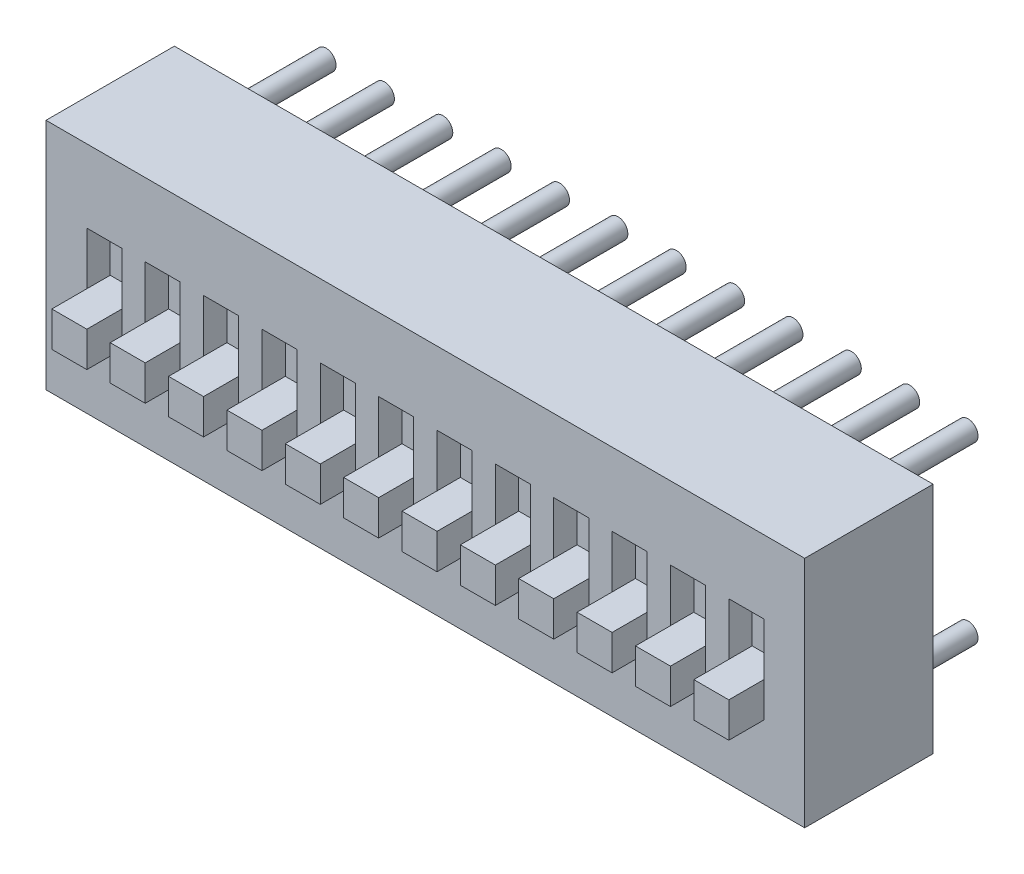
ISO-10303-21;
HEADER;
FILE_DESCRIPTION(('STEP AP214'),'2;1');
FILE_NAME('part.step','',(''),(''),'','','');
FILE_SCHEMA(('AUTOMOTIVE_DESIGN { 1 0 10303 214 1 1 1 1 }'));
ENDSEC;
DATA;
#1=APPLICATION_CONTEXT('core data for automotive mechanical design processes');
#2=APPLICATION_PROTOCOL_DEFINITION('international standard','automotive_design',2000,#1);
#3=PRODUCT_CONTEXT('',#1,'mechanical');
#4=PRODUCT('Part','Part','',(#3));
#5=PRODUCT_RELATED_PRODUCT_CATEGORY('part','',(#4));
#6=PRODUCT_DEFINITION_FORMATION('','',#4);
#7=PRODUCT_DEFINITION_CONTEXT('part definition',#1,'design');
#8=PRODUCT_DEFINITION('design','',#6,#7);
#9=PRODUCT_DEFINITION_SHAPE('','',#8);
#10=(LENGTH_UNIT() NAMED_UNIT(*) SI_UNIT(.MILLI.,.METRE.));
#11=(NAMED_UNIT(*) PLANE_ANGLE_UNIT() SI_UNIT($,.RADIAN.));
#12=(NAMED_UNIT(*) SI_UNIT($,.STERADIAN.) SOLID_ANGLE_UNIT());
#13=UNCERTAINTY_MEASURE_WITH_UNIT(LENGTH_MEASURE(1.E-05),#10,'distance_accuracy_value','');
#14=(GEOMETRIC_REPRESENTATION_CONTEXT(3) GLOBAL_UNCERTAINTY_ASSIGNED_CONTEXT((#13)) GLOBAL_UNIT_ASSIGNED_CONTEXT((#10,
#11,#12)) REPRESENTATION_CONTEXT('',''));
#15=CARTESIAN_POINT('',(0.,0.,0.));
#16=DIRECTION('',(0.,0.,1.));
#17=DIRECTION('',(1.,0.,0.));
#18=AXIS2_PLACEMENT_3D('',#15,#16,#17);
#19=CARTESIAN_POINT('',(27.94,3.81,-4.064));
#20=DIRECTION('',(0.,0.,1.));
#21=DIRECTION('',(1.,0.,0.));
#22=AXIS2_PLACEMENT_3D('',#19,#20,#21);
#23=CYLINDRICAL_SURFACE('',#22,0.4318);
#24=CARTESIAN_POINT('',(27.94,3.81,-4.064));
#25=DIRECTION('',(0.,0.,-1.));
#26=DIRECTION('',(-1.,0.,0.));
#27=AXIS2_PLACEMENT_3D('',#24,#25,#26);
#28=CIRCLE('',#27,0.4318);
#29=CARTESIAN_POINT('',(27.5082,3.81,-4.064));
#30=VERTEX_POINT('',#29);
#31=EDGE_CURVE('E11',#30,#30,#28,.T.);
#32=ORIENTED_EDGE('',*,*,#31,.F.);
#33=EDGE_LOOP('',(#32));
#34=FACE_BOUND('',#33,.T.);
#35=CARTESIAN_POINT('',(27.94,3.81,0.));
#36=DIRECTION('',(0.,0.,-1.));
#37=DIRECTION('',(-1.,0.,0.));
#38=AXIS2_PLACEMENT_3D('',#35,#36,#37);
#39=CIRCLE('',#38,0.4318);
#40=CARTESIAN_POINT('',(27.5082,3.81,0.));
#41=VERTEX_POINT('',#40);
#42=EDGE_CURVE('E43',#41,#41,#39,.T.);
#43=ORIENTED_EDGE('',*,*,#42,.T.);
#44=EDGE_LOOP('',(#43));
#45=FACE_BOUND('',#44,.T.);
#46=ADVANCED_FACE('F40',(#34,#45),#23,.T.);
#47=CARTESIAN_POINT('',(27.94,3.81,-4.064));
#48=DIRECTION('',(0.,0.,-1.));
#49=DIRECTION('',(-1.,0.,0.));
#50=AXIS2_PLACEMENT_3D('',#47,#48,#49);
#51=PLANE('',#50);
#52=ORIENTED_EDGE('',*,*,#31,.T.);
#53=EDGE_LOOP('',(#52));
#54=FACE_BOUND('',#53,.T.);
#55=ADVANCED_FACE('F55',(#54),#51,.T.);
#56=CARTESIAN_POINT('',(27.94,3.81,0.));
#57=DIRECTION('',(0.,0.,-1.));
#58=DIRECTION('',(-1.,0.,0.));
#59=AXIS2_PLACEMENT_3D('',#56,#57,#58);
#60=PLANE('',#59);
#61=ORIENTED_EDGE('',*,*,#42,.F.);
#62=EDGE_LOOP('',(#61));
#63=FACE_BOUND('',#62,.T.);
#64=ADVANCED_FACE('F53',(#63),#60,.F.);
#65=CLOSED_SHELL('',(#46,#55,#64));
#66=MANIFOLD_SOLID_BREP('B2',#65);
#67=CARTESIAN_POINT('',(25.4,3.81,-4.064));
#68=DIRECTION('',(0.,0.,1.));
#69=DIRECTION('',(1.,0.,0.));
#70=AXIS2_PLACEMENT_3D('',#67,#68,#69);
#71=CYLINDRICAL_SURFACE('',#70,0.4318);
#72=CARTESIAN_POINT('',(25.4,3.81,-4.064));
#73=DIRECTION('',(0.,0.,-1.));
#74=DIRECTION('',(-1.,0.,0.));
#75=AXIS2_PLACEMENT_3D('',#72,#73,#74);
#76=CIRCLE('',#75,0.4318);
#77=CARTESIAN_POINT('',(24.9682,3.81,-4.064));
#78=VERTEX_POINT('',#77);
#79=EDGE_CURVE('E39',#78,#78,#76,.T.);
#80=ORIENTED_EDGE('',*,*,#79,.F.);
#81=EDGE_LOOP('',(#80));
#82=FACE_BOUND('',#81,.T.);
#83=CARTESIAN_POINT('',(25.4,3.81,0.));
#84=DIRECTION('',(0.,0.,-1.));
#85=DIRECTION('',(-1.,0.,0.));
#86=AXIS2_PLACEMENT_3D('',#83,#84,#85);
#87=CIRCLE('',#86,0.4318);
#88=CARTESIAN_POINT('',(24.9682,3.81,0.));
#89=VERTEX_POINT('',#88);
#90=EDGE_CURVE('E92',#89,#89,#87,.T.);
#91=ORIENTED_EDGE('',*,*,#90,.T.);
#92=EDGE_LOOP('',(#91));
#93=FACE_BOUND('',#92,.T.);
#94=ADVANCED_FACE('F89',(#82,#93),#71,.T.);
#95=CARTESIAN_POINT('',(25.4,3.81,-4.064));
#96=DIRECTION('',(0.,0.,-1.));
#97=DIRECTION('',(-1.,0.,0.));
#98=AXIS2_PLACEMENT_3D('',#95,#96,#97);
#99=PLANE('',#98);
#100=ORIENTED_EDGE('',*,*,#79,.T.);
#101=EDGE_LOOP('',(#100));
#102=FACE_BOUND('',#101,.T.);
#103=ADVANCED_FACE('F104',(#102),#99,.T.);
#104=CARTESIAN_POINT('',(25.4,3.81,0.));
#105=DIRECTION('',(0.,0.,-1.));
#106=DIRECTION('',(-1.,0.,0.));
#107=AXIS2_PLACEMENT_3D('',#104,#105,#106);
#108=PLANE('',#107);
#109=ORIENTED_EDGE('',*,*,#90,.F.);
#110=EDGE_LOOP('',(#109));
#111=FACE_BOUND('',#110,.T.);
#112=ADVANCED_FACE('F102',(#111),#108,.F.);
#113=CLOSED_SHELL('',(#94,#103,#112));
#114=MANIFOLD_SOLID_BREP('B6',#113);
#115=CARTESIAN_POINT('',(22.86,3.81,-4.064));
#116=DIRECTION('',(0.,0.,1.));
#117=DIRECTION('',(1.,0.,0.));
#118=AXIS2_PLACEMENT_3D('',#115,#116,#117);
#119=CYLINDRICAL_SURFACE('',#118,0.4318);
#120=CARTESIAN_POINT('',(22.86,3.81,-4.064));
#121=DIRECTION('',(0.,0.,-1.));
#122=DIRECTION('',(-1.,0.,0.));
#123=AXIS2_PLACEMENT_3D('',#120,#121,#122);
#124=CIRCLE('',#123,0.4318);
#125=CARTESIAN_POINT('',(22.4282,3.81,-4.064));
#126=VERTEX_POINT('',#125);
#127=EDGE_CURVE('E88',#126,#126,#124,.T.);
#128=ORIENTED_EDGE('',*,*,#127,.F.);
#129=EDGE_LOOP('',(#128));
#130=FACE_BOUND('',#129,.T.);
#131=CARTESIAN_POINT('',(22.86,3.81,0.));
#132=DIRECTION('',(0.,0.,-1.));
#133=DIRECTION('',(-1.,0.,0.));
#134=AXIS2_PLACEMENT_3D('',#131,#132,#133);
#135=CIRCLE('',#134,0.4318);
#136=CARTESIAN_POINT('',(22.4282,3.81,0.));
#137=VERTEX_POINT('',#136);
#138=EDGE_CURVE('E141',#137,#137,#135,.T.);
#139=ORIENTED_EDGE('',*,*,#138,.T.);
#140=EDGE_LOOP('',(#139));
#141=FACE_BOUND('',#140,.T.);
#142=ADVANCED_FACE('F138',(#130,#141),#119,.T.);
#143=CARTESIAN_POINT('',(22.86,3.81,-4.064));
#144=DIRECTION('',(0.,0.,-1.));
#145=DIRECTION('',(-1.,0.,0.));
#146=AXIS2_PLACEMENT_3D('',#143,#144,#145);
#147=PLANE('',#146);
#148=ORIENTED_EDGE('',*,*,#127,.T.);
#149=EDGE_LOOP('',(#148));
#150=FACE_BOUND('',#149,.T.);
#151=ADVANCED_FACE('F153',(#150),#147,.T.);
#152=CARTESIAN_POINT('',(22.86,3.81,0.));
#153=DIRECTION('',(0.,0.,-1.));
#154=DIRECTION('',(-1.,0.,0.));
#155=AXIS2_PLACEMENT_3D('',#152,#153,#154);
#156=PLANE('',#155);
#157=ORIENTED_EDGE('',*,*,#138,.F.);
#158=EDGE_LOOP('',(#157));
#159=FACE_BOUND('',#158,.T.);
#160=ADVANCED_FACE('F151',(#159),#156,.F.);
#161=CLOSED_SHELL('',(#142,#151,#160));
#162=MANIFOLD_SOLID_BREP('B34',#161);
#163=CARTESIAN_POINT('',(20.32,3.81,-4.064));
#164=DIRECTION('',(0.,0.,1.));
#165=DIRECTION('',(1.,0.,0.));
#166=AXIS2_PLACEMENT_3D('',#163,#164,#165);
#167=CYLINDRICAL_SURFACE('',#166,0.4318);
#168=CARTESIAN_POINT('',(20.32,3.81,-4.064));
#169=DIRECTION('',(0.,0.,-1.));
#170=DIRECTION('',(-1.,0.,0.));
#171=AXIS2_PLACEMENT_3D('',#168,#169,#170);
#172=CIRCLE('',#171,0.4318);
#173=CARTESIAN_POINT('',(19.8882,3.81,-4.064));
#174=VERTEX_POINT('',#173);
#175=EDGE_CURVE('E137',#174,#174,#172,.T.);
#176=ORIENTED_EDGE('',*,*,#175,.F.);
#177=EDGE_LOOP('',(#176));
#178=FACE_BOUND('',#177,.T.);
#179=CARTESIAN_POINT('',(20.32,3.81,0.));
#180=DIRECTION('',(0.,0.,-1.));
#181=DIRECTION('',(-1.,0.,0.));
#182=AXIS2_PLACEMENT_3D('',#179,#180,#181);
#183=CIRCLE('',#182,0.4318);
#184=CARTESIAN_POINT('',(19.8882,3.81,0.));
#185=VERTEX_POINT('',#184);
#186=EDGE_CURVE('E190',#185,#185,#183,.T.);
#187=ORIENTED_EDGE('',*,*,#186,.T.);
#188=EDGE_LOOP('',(#187));
#189=FACE_BOUND('',#188,.T.);
#190=ADVANCED_FACE('F187',(#178,#189),#167,.T.);
#191=CARTESIAN_POINT('',(20.32,3.81,-4.064));
#192=DIRECTION('',(0.,0.,-1.));
#193=DIRECTION('',(-1.,0.,0.));
#194=AXIS2_PLACEMENT_3D('',#191,#192,#193);
#195=PLANE('',#194);
#196=ORIENTED_EDGE('',*,*,#175,.T.);
#197=EDGE_LOOP('',(#196));
#198=FACE_BOUND('',#197,.T.);
#199=ADVANCED_FACE('F202',(#198),#195,.T.);
#200=CARTESIAN_POINT('',(20.32,3.81,0.));
#201=DIRECTION('',(0.,0.,-1.));
#202=DIRECTION('',(-1.,0.,0.));
#203=AXIS2_PLACEMENT_3D('',#200,#201,#202);
#204=PLANE('',#203);
#205=ORIENTED_EDGE('',*,*,#186,.F.);
#206=EDGE_LOOP('',(#205));
#207=FACE_BOUND('',#206,.T.);
#208=ADVANCED_FACE('F200',(#207),#204,.F.);
#209=CLOSED_SHELL('',(#190,#199,#208));
#210=MANIFOLD_SOLID_BREP('B83',#209);
#211=CARTESIAN_POINT('',(17.78,3.81,-4.064));
#212=DIRECTION('',(0.,0.,1.));
#213=DIRECTION('',(1.,0.,0.));
#214=AXIS2_PLACEMENT_3D('',#211,#212,#213);
#215=CYLINDRICAL_SURFACE('',#214,0.4318);
#216=CARTESIAN_POINT('',(17.78,3.81,-4.064));
#217=DIRECTION('',(0.,0.,-1.));
#218=DIRECTION('',(-1.,0.,0.));
#219=AXIS2_PLACEMENT_3D('',#216,#217,#218);
#220=CIRCLE('',#219,0.4318);
#221=CARTESIAN_POINT('',(17.3482,3.81,-4.064));
#222=VERTEX_POINT('',#221);
#223=EDGE_CURVE('E186',#222,#222,#220,.T.);
#224=ORIENTED_EDGE('',*,*,#223,.F.);
#225=EDGE_LOOP('',(#224));
#226=FACE_BOUND('',#225,.T.);
#227=CARTESIAN_POINT('',(17.78,3.81,0.));
#228=DIRECTION('',(0.,0.,-1.));
#229=DIRECTION('',(-1.,0.,0.));
#230=AXIS2_PLACEMENT_3D('',#227,#228,#229);
#231=CIRCLE('',#230,0.4318);
#232=CARTESIAN_POINT('',(17.3482,3.81,0.));
#233=VERTEX_POINT('',#232);
#234=EDGE_CURVE('E239',#233,#233,#231,.T.);
#235=ORIENTED_EDGE('',*,*,#234,.T.);
#236=EDGE_LOOP('',(#235));
#237=FACE_BOUND('',#236,.T.);
#238=ADVANCED_FACE('F236',(#226,#237),#215,.T.);
#239=CARTESIAN_POINT('',(17.78,3.81,-4.064));
#240=DIRECTION('',(0.,0.,-1.));
#241=DIRECTION('',(-1.,0.,0.));
#242=AXIS2_PLACEMENT_3D('',#239,#240,#241);
#243=PLANE('',#242);
#244=ORIENTED_EDGE('',*,*,#223,.T.);
#245=EDGE_LOOP('',(#244));
#246=FACE_BOUND('',#245,.T.);
#247=ADVANCED_FACE('F251',(#246),#243,.T.);
#248=CARTESIAN_POINT('',(17.78,3.81,0.));
#249=DIRECTION('',(0.,0.,-1.));
#250=DIRECTION('',(-1.,0.,0.));
#251=AXIS2_PLACEMENT_3D('',#248,#249,#250);
#252=PLANE('',#251);
#253=ORIENTED_EDGE('',*,*,#234,.F.);
#254=EDGE_LOOP('',(#253));
#255=FACE_BOUND('',#254,.T.);
#256=ADVANCED_FACE('F249',(#255),#252,.F.);
#257=CLOSED_SHELL('',(#238,#247,#256));
#258=MANIFOLD_SOLID_BREP('B132',#257);
#259=CARTESIAN_POINT('',(15.24,3.81,-4.064));
#260=DIRECTION('',(0.,0.,1.));
#261=DIRECTION('',(1.,0.,0.));
#262=AXIS2_PLACEMENT_3D('',#259,#260,#261);
#263=CYLINDRICAL_SURFACE('',#262,0.4318);
#264=CARTESIAN_POINT('',(15.24,3.81,-4.064));
#265=DIRECTION('',(0.,0.,-1.));
#266=DIRECTION('',(-1.,0.,0.));
#267=AXIS2_PLACEMENT_3D('',#264,#265,#266);
#268=CIRCLE('',#267,0.4318);
#269=CARTESIAN_POINT('',(14.8082,3.81,-4.064));
#270=VERTEX_POINT('',#269);
#271=EDGE_CURVE('E235',#270,#270,#268,.T.);
#272=ORIENTED_EDGE('',*,*,#271,.F.);
#273=EDGE_LOOP('',(#272));
#274=FACE_BOUND('',#273,.T.);
#275=CARTESIAN_POINT('',(15.24,3.81,0.));
#276=DIRECTION('',(0.,0.,-1.));
#277=DIRECTION('',(-1.,0.,0.));
#278=AXIS2_PLACEMENT_3D('',#275,#276,#277);
#279=CIRCLE('',#278,0.4318);
#280=CARTESIAN_POINT('',(14.8082,3.81,0.));
#281=VERTEX_POINT('',#280);
#282=EDGE_CURVE('E288',#281,#281,#279,.T.);
#283=ORIENTED_EDGE('',*,*,#282,.T.);
#284=EDGE_LOOP('',(#283));
#285=FACE_BOUND('',#284,.T.);
#286=ADVANCED_FACE('F285',(#274,#285),#263,.T.);
#287=CARTESIAN_POINT('',(15.24,3.81,-4.064));
#288=DIRECTION('',(0.,0.,-1.));
#289=DIRECTION('',(-1.,0.,0.));
#290=AXIS2_PLACEMENT_3D('',#287,#288,#289);
#291=PLANE('',#290);
#292=ORIENTED_EDGE('',*,*,#271,.T.);
#293=EDGE_LOOP('',(#292));
#294=FACE_BOUND('',#293,.T.);
#295=ADVANCED_FACE('F300',(#294),#291,.T.);
#296=CARTESIAN_POINT('',(15.24,3.81,0.));
#297=DIRECTION('',(0.,0.,-1.));
#298=DIRECTION('',(-1.,0.,0.));
#299=AXIS2_PLACEMENT_3D('',#296,#297,#298);
#300=PLANE('',#299);
#301=ORIENTED_EDGE('',*,*,#282,.F.);
#302=EDGE_LOOP('',(#301));
#303=FACE_BOUND('',#302,.T.);
#304=ADVANCED_FACE('F298',(#303),#300,.F.);
#305=CLOSED_SHELL('',(#286,#295,#304));
#306=MANIFOLD_SOLID_BREP('B181',#305);
#307=CARTESIAN_POINT('',(12.7,3.81,-4.064));
#308=DIRECTION('',(0.,0.,1.));
#309=DIRECTION('',(1.,0.,0.));
#310=AXIS2_PLACEMENT_3D('',#307,#308,#309);
#311=CYLINDRICAL_SURFACE('',#310,0.4318);
#312=CARTESIAN_POINT('',(12.7,3.81,-4.064));
#313=DIRECTION('',(0.,0.,-1.));
#314=DIRECTION('',(-1.,0.,0.));
#315=AXIS2_PLACEMENT_3D('',#312,#313,#314);
#316=CIRCLE('',#315,0.4318);
#317=CARTESIAN_POINT('',(12.2682,3.81,-4.064));
#318=VERTEX_POINT('',#317);
#319=EDGE_CURVE('E284',#318,#318,#316,.T.);
#320=ORIENTED_EDGE('',*,*,#319,.F.);
#321=EDGE_LOOP('',(#320));
#322=FACE_BOUND('',#321,.T.);
#323=CARTESIAN_POINT('',(12.7,3.81,0.));
#324=DIRECTION('',(0.,0.,-1.));
#325=DIRECTION('',(-1.,0.,0.));
#326=AXIS2_PLACEMENT_3D('',#323,#324,#325);
#327=CIRCLE('',#326,0.4318);
#328=CARTESIAN_POINT('',(12.2682,3.81,0.));
#329=VERTEX_POINT('',#328);
#330=EDGE_CURVE('E337',#329,#329,#327,.T.);
#331=ORIENTED_EDGE('',*,*,#330,.T.);
#332=EDGE_LOOP('',(#331));
#333=FACE_BOUND('',#332,.T.);
#334=ADVANCED_FACE('F334',(#322,#333),#311,.T.);
#335=CARTESIAN_POINT('',(12.7,3.81,-4.064));
#336=DIRECTION('',(0.,0.,-1.));
#337=DIRECTION('',(-1.,0.,0.));
#338=AXIS2_PLACEMENT_3D('',#335,#336,#337);
#339=PLANE('',#338);
#340=ORIENTED_EDGE('',*,*,#319,.T.);
#341=EDGE_LOOP('',(#340));
#342=FACE_BOUND('',#341,.T.);
#343=ADVANCED_FACE('F349',(#342),#339,.T.);
#344=CARTESIAN_POINT('',(12.7,3.81,0.));
#345=DIRECTION('',(0.,0.,-1.));
#346=DIRECTION('',(-1.,0.,0.));
#347=AXIS2_PLACEMENT_3D('',#344,#345,#346);
#348=PLANE('',#347);
#349=ORIENTED_EDGE('',*,*,#330,.F.);
#350=EDGE_LOOP('',(#349));
#351=FACE_BOUND('',#350,.T.);
#352=ADVANCED_FACE('F347',(#351),#348,.F.);
#353=CLOSED_SHELL('',(#334,#343,#352));
#354=MANIFOLD_SOLID_BREP('B230',#353);
#355=CARTESIAN_POINT('',(10.16,3.81,-4.064));
#356=DIRECTION('',(0.,0.,1.));
#357=DIRECTION('',(1.,0.,0.));
#358=AXIS2_PLACEMENT_3D('',#355,#356,#357);
#359=CYLINDRICAL_SURFACE('',#358,0.4318);
#360=CARTESIAN_POINT('',(10.16,3.81,-4.064));
#361=DIRECTION('',(0.,0.,-1.));
#362=DIRECTION('',(-1.,0.,0.));
#363=AXIS2_PLACEMENT_3D('',#360,#361,#362);
#364=CIRCLE('',#363,0.4318);
#365=CARTESIAN_POINT('',(9.7282,3.81,-4.064));
#366=VERTEX_POINT('',#365);
#367=EDGE_CURVE('E333',#366,#366,#364,.T.);
#368=ORIENTED_EDGE('',*,*,#367,.F.);
#369=EDGE_LOOP('',(#368));
#370=FACE_BOUND('',#369,.T.);
#371=CARTESIAN_POINT('',(10.16,3.81,0.));
#372=DIRECTION('',(0.,0.,-1.));
#373=DIRECTION('',(-1.,0.,0.));
#374=AXIS2_PLACEMENT_3D('',#371,#372,#373);
#375=CIRCLE('',#374,0.4318);
#376=CARTESIAN_POINT('',(9.7282,3.81,0.));
#377=VERTEX_POINT('',#376);
#378=EDGE_CURVE('E386',#377,#377,#375,.T.);
#379=ORIENTED_EDGE('',*,*,#378,.T.);
#380=EDGE_LOOP('',(#379));
#381=FACE_BOUND('',#380,.T.);
#382=ADVANCED_FACE('F383',(#370,#381),#359,.T.);
#383=CARTESIAN_POINT('',(10.16,3.81,-4.064));
#384=DIRECTION('',(0.,0.,-1.));
#385=DIRECTION('',(-1.,0.,0.));
#386=AXIS2_PLACEMENT_3D('',#383,#384,#385);
#387=PLANE('',#386);
#388=ORIENTED_EDGE('',*,*,#367,.T.);
#389=EDGE_LOOP('',(#388));
#390=FACE_BOUND('',#389,.T.);
#391=ADVANCED_FACE('F398',(#390),#387,.T.);
#392=CARTESIAN_POINT('',(10.16,3.81,0.));
#393=DIRECTION('',(0.,0.,-1.));
#394=DIRECTION('',(-1.,0.,0.));
#395=AXIS2_PLACEMENT_3D('',#392,#393,#394);
#396=PLANE('',#395);
#397=ORIENTED_EDGE('',*,*,#378,.F.);
#398=EDGE_LOOP('',(#397));
#399=FACE_BOUND('',#398,.T.);
#400=ADVANCED_FACE('F396',(#399),#396,.F.);
#401=CLOSED_SHELL('',(#382,#391,#400));
#402=MANIFOLD_SOLID_BREP('B279',#401);
#403=CARTESIAN_POINT('',(7.62,3.81,-4.064));
#404=DIRECTION('',(0.,0.,1.));
#405=DIRECTION('',(1.,0.,0.));
#406=AXIS2_PLACEMENT_3D('',#403,#404,#405);
#407=CYLINDRICAL_SURFACE('',#406,0.4318);
#408=CARTESIAN_POINT('',(7.62,3.81,-4.064));
#409=DIRECTION('',(0.,0.,-1.));
#410=DIRECTION('',(-1.,0.,0.));
#411=AXIS2_PLACEMENT_3D('',#408,#409,#410);
#412=CIRCLE('',#411,0.4318);
#413=CARTESIAN_POINT('',(7.1882,3.81,-4.064));
#414=VERTEX_POINT('',#413);
#415=EDGE_CURVE('E382',#414,#414,#412,.T.);
#416=ORIENTED_EDGE('',*,*,#415,.F.);
#417=EDGE_LOOP('',(#416));
#418=FACE_BOUND('',#417,.T.);
#419=CARTESIAN_POINT('',(7.62,3.81,0.));
#420=DIRECTION('',(0.,0.,-1.));
#421=DIRECTION('',(-1.,0.,0.));
#422=AXIS2_PLACEMENT_3D('',#419,#420,#421);
#423=CIRCLE('',#422,0.4318);
#424=CARTESIAN_POINT('',(7.1882,3.81,0.));
#425=VERTEX_POINT('',#424);
#426=EDGE_CURVE('E435',#425,#425,#423,.T.);
#427=ORIENTED_EDGE('',*,*,#426,.T.);
#428=EDGE_LOOP('',(#427));
#429=FACE_BOUND('',#428,.T.);
#430=ADVANCED_FACE('F432',(#418,#429),#407,.T.);
#431=CARTESIAN_POINT('',(7.62,3.81,-4.064));
#432=DIRECTION('',(0.,0.,-1.));
#433=DIRECTION('',(-1.,0.,0.));
#434=AXIS2_PLACEMENT_3D('',#431,#432,#433);
#435=PLANE('',#434);
#436=ORIENTED_EDGE('',*,*,#415,.T.);
#437=EDGE_LOOP('',(#436));
#438=FACE_BOUND('',#437,.T.);
#439=ADVANCED_FACE('F447',(#438),#435,.T.);
#440=CARTESIAN_POINT('',(7.62,3.81,0.));
#441=DIRECTION('',(0.,0.,-1.));
#442=DIRECTION('',(-1.,0.,0.));
#443=AXIS2_PLACEMENT_3D('',#440,#441,#442);
#444=PLANE('',#443);
#445=ORIENTED_EDGE('',*,*,#426,.F.);
#446=EDGE_LOOP('',(#445));
#447=FACE_BOUND('',#446,.T.);
#448=ADVANCED_FACE('F445',(#447),#444,.F.);
#449=CLOSED_SHELL('',(#430,#439,#448));
#450=MANIFOLD_SOLID_BREP('B328',#449);
#451=CARTESIAN_POINT('',(5.08,3.81,-4.064));
#452=DIRECTION('',(0.,0.,1.));
#453=DIRECTION('',(1.,0.,0.));
#454=AXIS2_PLACEMENT_3D('',#451,#452,#453);
#455=CYLINDRICAL_SURFACE('',#454,0.4318);
#456=CARTESIAN_POINT('',(5.08,3.81,-4.064));
#457=DIRECTION('',(0.,0.,-1.));
#458=DIRECTION('',(-1.,0.,0.));
#459=AXIS2_PLACEMENT_3D('',#456,#457,#458);
#460=CIRCLE('',#459,0.4318);
#461=CARTESIAN_POINT('',(4.6482,3.81,-4.064));
#462=VERTEX_POINT('',#461);
#463=EDGE_CURVE('E431',#462,#462,#460,.T.);
#464=ORIENTED_EDGE('',*,*,#463,.F.);
#465=EDGE_LOOP('',(#464));
#466=FACE_BOUND('',#465,.T.);
#467=CARTESIAN_POINT('',(5.08,3.81,0.));
#468=DIRECTION('',(0.,0.,-1.));
#469=DIRECTION('',(-1.,0.,0.));
#470=AXIS2_PLACEMENT_3D('',#467,#468,#469);
#471=CIRCLE('',#470,0.4318);
#472=CARTESIAN_POINT('',(4.6482,3.81,0.));
#473=VERTEX_POINT('',#472);
#474=EDGE_CURVE('E484',#473,#473,#471,.T.);
#475=ORIENTED_EDGE('',*,*,#474,.T.);
#476=EDGE_LOOP('',(#475));
#477=FACE_BOUND('',#476,.T.);
#478=ADVANCED_FACE('F481',(#466,#477),#455,.T.);
#479=CARTESIAN_POINT('',(5.08,3.81,-4.064));
#480=DIRECTION('',(0.,0.,-1.));
#481=DIRECTION('',(-1.,0.,0.));
#482=AXIS2_PLACEMENT_3D('',#479,#480,#481);
#483=PLANE('',#482);
#484=ORIENTED_EDGE('',*,*,#463,.T.);
#485=EDGE_LOOP('',(#484));
#486=FACE_BOUND('',#485,.T.);
#487=ADVANCED_FACE('F496',(#486),#483,.T.);
#488=CARTESIAN_POINT('',(5.08,3.81,0.));
#489=DIRECTION('',(0.,0.,-1.));
#490=DIRECTION('',(-1.,0.,0.));
#491=AXIS2_PLACEMENT_3D('',#488,#489,#490);
#492=PLANE('',#491);
#493=ORIENTED_EDGE('',*,*,#474,.F.);
#494=EDGE_LOOP('',(#493));
#495=FACE_BOUND('',#494,.T.);
#496=ADVANCED_FACE('F494',(#495),#492,.F.);
#497=CLOSED_SHELL('',(#478,#487,#496));
#498=MANIFOLD_SOLID_BREP('B377',#497);
#499=CARTESIAN_POINT('',(2.54,3.81,-4.064));
#500=DIRECTION('',(0.,0.,1.));
#501=DIRECTION('',(1.,0.,0.));
#502=AXIS2_PLACEMENT_3D('',#499,#500,#501);
#503=CYLINDRICAL_SURFACE('',#502,0.4318);
#504=CARTESIAN_POINT('',(2.54,3.81,-4.064));
#505=DIRECTION('',(0.,0.,-1.));
#506=DIRECTION('',(-1.,0.,0.));
#507=AXIS2_PLACEMENT_3D('',#504,#505,#506);
#508=CIRCLE('',#507,0.4318);
#509=CARTESIAN_POINT('',(2.1082,3.81,-4.064));
#510=VERTEX_POINT('',#509);
#511=EDGE_CURVE('E480',#510,#510,#508,.T.);
#512=ORIENTED_EDGE('',*,*,#511,.F.);
#513=EDGE_LOOP('',(#512));
#514=FACE_BOUND('',#513,.T.);
#515=CARTESIAN_POINT('',(2.54,3.81,0.));
#516=DIRECTION('',(0.,0.,-1.));
#517=DIRECTION('',(-1.,0.,0.));
#518=AXIS2_PLACEMENT_3D('',#515,#516,#517);
#519=CIRCLE('',#518,0.4318);
#520=CARTESIAN_POINT('',(2.1082,3.81,0.));
#521=VERTEX_POINT('',#520);
#522=EDGE_CURVE('E533',#521,#521,#519,.T.);
#523=ORIENTED_EDGE('',*,*,#522,.T.);
#524=EDGE_LOOP('',(#523));
#525=FACE_BOUND('',#524,.T.);
#526=ADVANCED_FACE('F530',(#514,#525),#503,.T.);
#527=CARTESIAN_POINT('',(2.54,3.81,-4.064));
#528=DIRECTION('',(0.,0.,-1.));
#529=DIRECTION('',(-1.,0.,0.));
#530=AXIS2_PLACEMENT_3D('',#527,#528,#529);
#531=PLANE('',#530);
#532=ORIENTED_EDGE('',*,*,#511,.T.);
#533=EDGE_LOOP('',(#532));
#534=FACE_BOUND('',#533,.T.);
#535=ADVANCED_FACE('F545',(#534),#531,.T.);
#536=CARTESIAN_POINT('',(2.54,3.81,0.));
#537=DIRECTION('',(0.,0.,-1.));
#538=DIRECTION('',(-1.,0.,0.));
#539=AXIS2_PLACEMENT_3D('',#536,#537,#538);
#540=PLANE('',#539);
#541=ORIENTED_EDGE('',*,*,#522,.F.);
#542=EDGE_LOOP('',(#541));
#543=FACE_BOUND('',#542,.T.);
#544=ADVANCED_FACE('F543',(#543),#540,.F.);
#545=CLOSED_SHELL('',(#526,#535,#544));
#546=MANIFOLD_SOLID_BREP('B426',#545);
#547=CARTESIAN_POINT('',(27.94,-3.81,-4.064));
#548=DIRECTION('',(0.,0.,1.));
#549=DIRECTION('',(1.,0.,0.));
#550=AXIS2_PLACEMENT_3D('',#547,#548,#549);
#551=CYLINDRICAL_SURFACE('',#550,0.4318);
#552=CARTESIAN_POINT('',(27.94,-3.81,-4.064));
#553=DIRECTION('',(0.,0.,-1.));
#554=DIRECTION('',(-1.,0.,0.));
#555=AXIS2_PLACEMENT_3D('',#552,#553,#554);
#556=CIRCLE('',#555,0.4318);
#557=CARTESIAN_POINT('',(27.5082,-3.81,-4.064));
#558=VERTEX_POINT('',#557);
#559=EDGE_CURVE('E529',#558,#558,#556,.T.);
#560=ORIENTED_EDGE('',*,*,#559,.F.);
#561=EDGE_LOOP('',(#560));
#562=FACE_BOUND('',#561,.T.);
#563=CARTESIAN_POINT('',(27.94,-3.81,0.));
#564=DIRECTION('',(0.,0.,-1.));
#565=DIRECTION('',(-1.,0.,0.));
#566=AXIS2_PLACEMENT_3D('',#563,#564,#565);
#567=CIRCLE('',#566,0.4318);
#568=CARTESIAN_POINT('',(27.5082,-3.81,0.));
#569=VERTEX_POINT('',#568);
#570=EDGE_CURVE('E582',#569,#569,#567,.T.);
#571=ORIENTED_EDGE('',*,*,#570,.T.);
#572=EDGE_LOOP('',(#571));
#573=FACE_BOUND('',#572,.T.);
#574=ADVANCED_FACE('F579',(#562,#573),#551,.T.);
#575=CARTESIAN_POINT('',(27.94,-3.81,-4.064));
#576=DIRECTION('',(0.,0.,-1.));
#577=DIRECTION('',(-1.,0.,0.));
#578=AXIS2_PLACEMENT_3D('',#575,#576,#577);
#579=PLANE('',#578);
#580=ORIENTED_EDGE('',*,*,#559,.T.);
#581=EDGE_LOOP('',(#580));
#582=FACE_BOUND('',#581,.T.);
#583=ADVANCED_FACE('F594',(#582),#579,.T.);
#584=CARTESIAN_POINT('',(27.94,-3.81,0.));
#585=DIRECTION('',(0.,0.,-1.));
#586=DIRECTION('',(-1.,0.,0.));
#587=AXIS2_PLACEMENT_3D('',#584,#585,#586);
#588=PLANE('',#587);
#589=ORIENTED_EDGE('',*,*,#570,.F.);
#590=EDGE_LOOP('',(#589));
#591=FACE_BOUND('',#590,.T.);
#592=ADVANCED_FACE('F592',(#591),#588,.F.);
#593=CLOSED_SHELL('',(#574,#583,#592));
#594=MANIFOLD_SOLID_BREP('B475',#593);
#595=CARTESIAN_POINT('',(25.4,-3.81,-4.064));
#596=DIRECTION('',(0.,0.,1.));
#597=DIRECTION('',(1.,0.,0.));
#598=AXIS2_PLACEMENT_3D('',#595,#596,#597);
#599=CYLINDRICAL_SURFACE('',#598,0.4318);
#600=CARTESIAN_POINT('',(25.4,-3.81,-4.064));
#601=DIRECTION('',(0.,0.,-1.));
#602=DIRECTION('',(-1.,0.,0.));
#603=AXIS2_PLACEMENT_3D('',#600,#601,#602);
#604=CIRCLE('',#603,0.4318);
#605=CARTESIAN_POINT('',(24.9682,-3.81,-4.064));
#606=VERTEX_POINT('',#605);
#607=EDGE_CURVE('E578',#606,#606,#604,.T.);
#608=ORIENTED_EDGE('',*,*,#607,.F.);
#609=EDGE_LOOP('',(#608));
#610=FACE_BOUND('',#609,.T.);
#611=CARTESIAN_POINT('',(25.4,-3.81,0.));
#612=DIRECTION('',(0.,0.,-1.));
#613=DIRECTION('',(-1.,0.,0.));
#614=AXIS2_PLACEMENT_3D('',#611,#612,#613);
#615=CIRCLE('',#614,0.4318);
#616=CARTESIAN_POINT('',(24.9682,-3.81,0.));
#617=VERTEX_POINT('',#616);
#618=EDGE_CURVE('E631',#617,#617,#615,.T.);
#619=ORIENTED_EDGE('',*,*,#618,.T.);
#620=EDGE_LOOP('',(#619));
#621=FACE_BOUND('',#620,.T.);
#622=ADVANCED_FACE('F628',(#610,#621),#599,.T.);
#623=CARTESIAN_POINT('',(25.4,-3.81,-4.064));
#624=DIRECTION('',(0.,0.,-1.));
#625=DIRECTION('',(-1.,0.,0.));
#626=AXIS2_PLACEMENT_3D('',#623,#624,#625);
#627=PLANE('',#626);
#628=ORIENTED_EDGE('',*,*,#607,.T.);
#629=EDGE_LOOP('',(#628));
#630=FACE_BOUND('',#629,.T.);
#631=ADVANCED_FACE('F643',(#630),#627,.T.);
#632=CARTESIAN_POINT('',(25.4,-3.81,0.));
#633=DIRECTION('',(0.,0.,-1.));
#634=DIRECTION('',(-1.,0.,0.));
#635=AXIS2_PLACEMENT_3D('',#632,#633,#634);
#636=PLANE('',#635);
#637=ORIENTED_EDGE('',*,*,#618,.F.);
#638=EDGE_LOOP('',(#637));
#639=FACE_BOUND('',#638,.T.);
#640=ADVANCED_FACE('F641',(#639),#636,.F.);
#641=CLOSED_SHELL('',(#622,#631,#640));
#642=MANIFOLD_SOLID_BREP('B524',#641);
#643=CARTESIAN_POINT('',(22.86,-3.81,-4.064));
#644=DIRECTION('',(0.,0.,1.));
#645=DIRECTION('',(1.,0.,0.));
#646=AXIS2_PLACEMENT_3D('',#643,#644,#645);
#647=CYLINDRICAL_SURFACE('',#646,0.4318);
#648=CARTESIAN_POINT('',(22.86,-3.81,-4.064));
#649=DIRECTION('',(0.,0.,-1.));
#650=DIRECTION('',(-1.,0.,0.));
#651=AXIS2_PLACEMENT_3D('',#648,#649,#650);
#652=CIRCLE('',#651,0.4318);
#653=CARTESIAN_POINT('',(22.4282,-3.81,-4.064));
#654=VERTEX_POINT('',#653);
#655=EDGE_CURVE('E627',#654,#654,#652,.T.);
#656=ORIENTED_EDGE('',*,*,#655,.F.);
#657=EDGE_LOOP('',(#656));
#658=FACE_BOUND('',#657,.T.);
#659=CARTESIAN_POINT('',(22.86,-3.81,0.));
#660=DIRECTION('',(0.,0.,-1.));
#661=DIRECTION('',(-1.,0.,0.));
#662=AXIS2_PLACEMENT_3D('',#659,#660,#661);
#663=CIRCLE('',#662,0.4318);
#664=CARTESIAN_POINT('',(22.4282,-3.81,0.));
#665=VERTEX_POINT('',#664);
#666=EDGE_CURVE('E680',#665,#665,#663,.T.);
#667=ORIENTED_EDGE('',*,*,#666,.T.);
#668=EDGE_LOOP('',(#667));
#669=FACE_BOUND('',#668,.T.);
#670=ADVANCED_FACE('F677',(#658,#669),#647,.T.);
#671=CARTESIAN_POINT('',(22.86,-3.81,-4.064));
#672=DIRECTION('',(0.,0.,-1.));
#673=DIRECTION('',(-1.,0.,0.));
#674=AXIS2_PLACEMENT_3D('',#671,#672,#673);
#675=PLANE('',#674);
#676=ORIENTED_EDGE('',*,*,#655,.T.);
#677=EDGE_LOOP('',(#676));
#678=FACE_BOUND('',#677,.T.);
#679=ADVANCED_FACE('F692',(#678),#675,.T.);
#680=CARTESIAN_POINT('',(22.86,-3.81,0.));
#681=DIRECTION('',(0.,0.,-1.));
#682=DIRECTION('',(-1.,0.,0.));
#683=AXIS2_PLACEMENT_3D('',#680,#681,#682);
#684=PLANE('',#683);
#685=ORIENTED_EDGE('',*,*,#666,.F.);
#686=EDGE_LOOP('',(#685));
#687=FACE_BOUND('',#686,.T.);
#688=ADVANCED_FACE('F690',(#687),#684,.F.);
#689=CLOSED_SHELL('',(#670,#679,#688));
#690=MANIFOLD_SOLID_BREP('B573',#689);
#691=CARTESIAN_POINT('',(20.32,-3.81,-4.064));
#692=DIRECTION('',(0.,0.,1.));
#693=DIRECTION('',(1.,0.,0.));
#694=AXIS2_PLACEMENT_3D('',#691,#692,#693);
#695=CYLINDRICAL_SURFACE('',#694,0.4318);
#696=CARTESIAN_POINT('',(20.32,-3.81,-4.064));
#697=DIRECTION('',(0.,0.,-1.));
#698=DIRECTION('',(-1.,0.,0.));
#699=AXIS2_PLACEMENT_3D('',#696,#697,#698);
#700=CIRCLE('',#699,0.4318);
#701=CARTESIAN_POINT('',(19.8882,-3.81,-4.064));
#702=VERTEX_POINT('',#701);
#703=EDGE_CURVE('E676',#702,#702,#700,.T.);
#704=ORIENTED_EDGE('',*,*,#703,.F.);
#705=EDGE_LOOP('',(#704));
#706=FACE_BOUND('',#705,.T.);
#707=CARTESIAN_POINT('',(20.32,-3.81,0.));
#708=DIRECTION('',(0.,0.,-1.));
#709=DIRECTION('',(-1.,0.,0.));
#710=AXIS2_PLACEMENT_3D('',#707,#708,#709);
#711=CIRCLE('',#710,0.4318);
#712=CARTESIAN_POINT('',(19.8882,-3.81,0.));
#713=VERTEX_POINT('',#712);
#714=EDGE_CURVE('E729',#713,#713,#711,.T.);
#715=ORIENTED_EDGE('',*,*,#714,.T.);
#716=EDGE_LOOP('',(#715));
#717=FACE_BOUND('',#716,.T.);
#718=ADVANCED_FACE('F726',(#706,#717),#695,.T.);
#719=CARTESIAN_POINT('',(20.32,-3.81,-4.064));
#720=DIRECTION('',(0.,0.,-1.));
#721=DIRECTION('',(-1.,0.,0.));
#722=AXIS2_PLACEMENT_3D('',#719,#720,#721);
#723=PLANE('',#722);
#724=ORIENTED_EDGE('',*,*,#703,.T.);
#725=EDGE_LOOP('',(#724));
#726=FACE_BOUND('',#725,.T.);
#727=ADVANCED_FACE('F741',(#726),#723,.T.);
#728=CARTESIAN_POINT('',(20.32,-3.81,0.));
#729=DIRECTION('',(0.,0.,-1.));
#730=DIRECTION('',(-1.,0.,0.));
#731=AXIS2_PLACEMENT_3D('',#728,#729,#730);
#732=PLANE('',#731);
#733=ORIENTED_EDGE('',*,*,#714,.F.);
#734=EDGE_LOOP('',(#733));
#735=FACE_BOUND('',#734,.T.);
#736=ADVANCED_FACE('F739',(#735),#732,.F.);
#737=CLOSED_SHELL('',(#718,#727,#736));
#738=MANIFOLD_SOLID_BREP('B622',#737);
#739=CARTESIAN_POINT('',(17.78,-3.81,-4.064));
#740=DIRECTION('',(0.,0.,1.));
#741=DIRECTION('',(1.,0.,0.));
#742=AXIS2_PLACEMENT_3D('',#739,#740,#741);
#743=CYLINDRICAL_SURFACE('',#742,0.4318);
#744=CARTESIAN_POINT('',(17.78,-3.81,-4.064));
#745=DIRECTION('',(0.,0.,-1.));
#746=DIRECTION('',(-1.,0.,0.));
#747=AXIS2_PLACEMENT_3D('',#744,#745,#746);
#748=CIRCLE('',#747,0.4318);
#749=CARTESIAN_POINT('',(17.3482,-3.81,-4.064));
#750=VERTEX_POINT('',#749);
#751=EDGE_CURVE('E725',#750,#750,#748,.T.);
#752=ORIENTED_EDGE('',*,*,#751,.F.);
#753=EDGE_LOOP('',(#752));
#754=FACE_BOUND('',#753,.T.);
#755=CARTESIAN_POINT('',(17.78,-3.81,0.));
#756=DIRECTION('',(0.,0.,-1.));
#757=DIRECTION('',(-1.,0.,0.));
#758=AXIS2_PLACEMENT_3D('',#755,#756,#757);
#759=CIRCLE('',#758,0.4318);
#760=CARTESIAN_POINT('',(17.3482,-3.81,0.));
#761=VERTEX_POINT('',#760);
#762=EDGE_CURVE('E778',#761,#761,#759,.T.);
#763=ORIENTED_EDGE('',*,*,#762,.T.);
#764=EDGE_LOOP('',(#763));
#765=FACE_BOUND('',#764,.T.);
#766=ADVANCED_FACE('F775',(#754,#765),#743,.T.);
#767=CARTESIAN_POINT('',(17.78,-3.81,-4.064));
#768=DIRECTION('',(0.,0.,-1.));
#769=DIRECTION('',(-1.,0.,0.));
#770=AXIS2_PLACEMENT_3D('',#767,#768,#769);
#771=PLANE('',#770);
#772=ORIENTED_EDGE('',*,*,#751,.T.);
#773=EDGE_LOOP('',(#772));
#774=FACE_BOUND('',#773,.T.);
#775=ADVANCED_FACE('F790',(#774),#771,.T.);
#776=CARTESIAN_POINT('',(17.78,-3.81,0.));
#777=DIRECTION('',(0.,0.,-1.));
#778=DIRECTION('',(-1.,0.,0.));
#779=AXIS2_PLACEMENT_3D('',#776,#777,#778);
#780=PLANE('',#779);
#781=ORIENTED_EDGE('',*,*,#762,.F.);
#782=EDGE_LOOP('',(#781));
#783=FACE_BOUND('',#782,.T.);
#784=ADVANCED_FACE('F788',(#783),#780,.F.);
#785=CLOSED_SHELL('',(#766,#775,#784));
#786=MANIFOLD_SOLID_BREP('B671',#785);
#787=CARTESIAN_POINT('',(15.24,-3.81,-4.064));
#788=DIRECTION('',(0.,0.,1.));
#789=DIRECTION('',(1.,0.,0.));
#790=AXIS2_PLACEMENT_3D('',#787,#788,#789);
#791=CYLINDRICAL_SURFACE('',#790,0.4318);
#792=CARTESIAN_POINT('',(15.24,-3.81,-4.064));
#793=DIRECTION('',(0.,0.,-1.));
#794=DIRECTION('',(-1.,0.,0.));
#795=AXIS2_PLACEMENT_3D('',#792,#793,#794);
#796=CIRCLE('',#795,0.4318);
#797=CARTESIAN_POINT('',(14.8082,-3.81,-4.064));
#798=VERTEX_POINT('',#797);
#799=EDGE_CURVE('E774',#798,#798,#796,.T.);
#800=ORIENTED_EDGE('',*,*,#799,.F.);
#801=EDGE_LOOP('',(#800));
#802=FACE_BOUND('',#801,.T.);
#803=CARTESIAN_POINT('',(15.24,-3.81,0.));
#804=DIRECTION('',(0.,0.,-1.));
#805=DIRECTION('',(-1.,0.,0.));
#806=AXIS2_PLACEMENT_3D('',#803,#804,#805);
#807=CIRCLE('',#806,0.4318);
#808=CARTESIAN_POINT('',(14.8082,-3.81,0.));
#809=VERTEX_POINT('',#808);
#810=EDGE_CURVE('E827',#809,#809,#807,.T.);
#811=ORIENTED_EDGE('',*,*,#810,.T.);
#812=EDGE_LOOP('',(#811));
#813=FACE_BOUND('',#812,.T.);
#814=ADVANCED_FACE('F824',(#802,#813),#791,.T.);
#815=CARTESIAN_POINT('',(15.24,-3.81,-4.064));
#816=DIRECTION('',(0.,0.,-1.));
#817=DIRECTION('',(-1.,0.,0.));
#818=AXIS2_PLACEMENT_3D('',#815,#816,#817);
#819=PLANE('',#818);
#820=ORIENTED_EDGE('',*,*,#799,.T.);
#821=EDGE_LOOP('',(#820));
#822=FACE_BOUND('',#821,.T.);
#823=ADVANCED_FACE('F839',(#822),#819,.T.);
#824=CARTESIAN_POINT('',(15.24,-3.81,0.));
#825=DIRECTION('',(0.,0.,-1.));
#826=DIRECTION('',(-1.,0.,0.));
#827=AXIS2_PLACEMENT_3D('',#824,#825,#826);
#828=PLANE('',#827);
#829=ORIENTED_EDGE('',*,*,#810,.F.);
#830=EDGE_LOOP('',(#829));
#831=FACE_BOUND('',#830,.T.);
#832=ADVANCED_FACE('F837',(#831),#828,.F.);
#833=CLOSED_SHELL('',(#814,#823,#832));
#834=MANIFOLD_SOLID_BREP('B720',#833);
#835=CARTESIAN_POINT('',(12.7,-3.81,-4.064));
#836=DIRECTION('',(0.,0.,1.));
#837=DIRECTION('',(1.,0.,0.));
#838=AXIS2_PLACEMENT_3D('',#835,#836,#837);
#839=CYLINDRICAL_SURFACE('',#838,0.4318);
#840=CARTESIAN_POINT('',(12.7,-3.81,-4.064));
#841=DIRECTION('',(0.,0.,-1.));
#842=DIRECTION('',(-1.,0.,0.));
#843=AXIS2_PLACEMENT_3D('',#840,#841,#842);
#844=CIRCLE('',#843,0.4318);
#845=CARTESIAN_POINT('',(12.2682,-3.81,-4.064));
#846=VERTEX_POINT('',#845);
#847=EDGE_CURVE('E823',#846,#846,#844,.T.);
#848=ORIENTED_EDGE('',*,*,#847,.F.);
#849=EDGE_LOOP('',(#848));
#850=FACE_BOUND('',#849,.T.);
#851=CARTESIAN_POINT('',(12.7,-3.81,0.));
#852=DIRECTION('',(0.,0.,-1.));
#853=DIRECTION('',(-1.,0.,0.));
#854=AXIS2_PLACEMENT_3D('',#851,#852,#853);
#855=CIRCLE('',#854,0.4318);
#856=CARTESIAN_POINT('',(12.2682,-3.81,0.));
#857=VERTEX_POINT('',#856);
#858=EDGE_CURVE('E876',#857,#857,#855,.T.);
#859=ORIENTED_EDGE('',*,*,#858,.T.);
#860=EDGE_LOOP('',(#859));
#861=FACE_BOUND('',#860,.T.);
#862=ADVANCED_FACE('F873',(#850,#861),#839,.T.);
#863=CARTESIAN_POINT('',(12.7,-3.81,-4.064));
#864=DIRECTION('',(0.,0.,-1.));
#865=DIRECTION('',(-1.,0.,0.));
#866=AXIS2_PLACEMENT_3D('',#863,#864,#865);
#867=PLANE('',#866);
#868=ORIENTED_EDGE('',*,*,#847,.T.);
#869=EDGE_LOOP('',(#868));
#870=FACE_BOUND('',#869,.T.);
#871=ADVANCED_FACE('F888',(#870),#867,.T.);
#872=CARTESIAN_POINT('',(12.7,-3.81,0.));
#873=DIRECTION('',(0.,0.,-1.));
#874=DIRECTION('',(-1.,0.,0.));
#875=AXIS2_PLACEMENT_3D('',#872,#873,#874);
#876=PLANE('',#875);
#877=ORIENTED_EDGE('',*,*,#858,.F.);
#878=EDGE_LOOP('',(#877));
#879=FACE_BOUND('',#878,.T.);
#880=ADVANCED_FACE('F886',(#879),#876,.F.);
#881=CLOSED_SHELL('',(#862,#871,#880));
#882=MANIFOLD_SOLID_BREP('B769',#881);
#883=CARTESIAN_POINT('',(10.16,-3.81,-4.064));
#884=DIRECTION('',(0.,0.,1.));
#885=DIRECTION('',(1.,0.,0.));
#886=AXIS2_PLACEMENT_3D('',#883,#884,#885);
#887=CYLINDRICAL_SURFACE('',#886,0.4318);
#888=CARTESIAN_POINT('',(10.16,-3.81,-4.064));
#889=DIRECTION('',(0.,0.,-1.));
#890=DIRECTION('',(-1.,0.,0.));
#891=AXIS2_PLACEMENT_3D('',#888,#889,#890);
#892=CIRCLE('',#891,0.4318);
#893=CARTESIAN_POINT('',(9.7282,-3.81,-4.064));
#894=VERTEX_POINT('',#893);
#895=EDGE_CURVE('E872',#894,#894,#892,.T.);
#896=ORIENTED_EDGE('',*,*,#895,.F.);
#897=EDGE_LOOP('',(#896));
#898=FACE_BOUND('',#897,.T.);
#899=CARTESIAN_POINT('',(10.16,-3.81,0.));
#900=DIRECTION('',(0.,0.,-1.));
#901=DIRECTION('',(-1.,0.,0.));
#902=AXIS2_PLACEMENT_3D('',#899,#900,#901);
#903=CIRCLE('',#902,0.4318);
#904=CARTESIAN_POINT('',(9.7282,-3.81,0.));
#905=VERTEX_POINT('',#904);
#906=EDGE_CURVE('E925',#905,#905,#903,.T.);
#907=ORIENTED_EDGE('',*,*,#906,.T.);
#908=EDGE_LOOP('',(#907));
#909=FACE_BOUND('',#908,.T.);
#910=ADVANCED_FACE('F922',(#898,#909),#887,.T.);
#911=CARTESIAN_POINT('',(10.16,-3.81,-4.064));
#912=DIRECTION('',(0.,0.,-1.));
#913=DIRECTION('',(-1.,0.,0.));
#914=AXIS2_PLACEMENT_3D('',#911,#912,#913);
#915=PLANE('',#914);
#916=ORIENTED_EDGE('',*,*,#895,.T.);
#917=EDGE_LOOP('',(#916));
#918=FACE_BOUND('',#917,.T.);
#919=ADVANCED_FACE('F937',(#918),#915,.T.);
#920=CARTESIAN_POINT('',(10.16,-3.81,0.));
#921=DIRECTION('',(0.,0.,-1.));
#922=DIRECTION('',(-1.,0.,0.));
#923=AXIS2_PLACEMENT_3D('',#920,#921,#922);
#924=PLANE('',#923);
#925=ORIENTED_EDGE('',*,*,#906,.F.);
#926=EDGE_LOOP('',(#925));
#927=FACE_BOUND('',#926,.T.);
#928=ADVANCED_FACE('F935',(#927),#924,.F.);
#929=CLOSED_SHELL('',(#910,#919,#928));
#930=MANIFOLD_SOLID_BREP('B818',#929);
#931=CARTESIAN_POINT('',(7.62,-3.81,-4.064));
#932=DIRECTION('',(0.,0.,1.));
#933=DIRECTION('',(1.,0.,0.));
#934=AXIS2_PLACEMENT_3D('',#931,#932,#933);
#935=CYLINDRICAL_SURFACE('',#934,0.4318);
#936=CARTESIAN_POINT('',(7.62,-3.81,-4.064));
#937=DIRECTION('',(0.,0.,-1.));
#938=DIRECTION('',(-1.,0.,0.));
#939=AXIS2_PLACEMENT_3D('',#936,#937,#938);
#940=CIRCLE('',#939,0.4318);
#941=CARTESIAN_POINT('',(7.1882,-3.81,-4.064));
#942=VERTEX_POINT('',#941);
#943=EDGE_CURVE('E921',#942,#942,#940,.T.);
#944=ORIENTED_EDGE('',*,*,#943,.F.);
#945=EDGE_LOOP('',(#944));
#946=FACE_BOUND('',#945,.T.);
#947=CARTESIAN_POINT('',(7.62,-3.81,0.));
#948=DIRECTION('',(0.,0.,-1.));
#949=DIRECTION('',(-1.,0.,0.));
#950=AXIS2_PLACEMENT_3D('',#947,#948,#949);
#951=CIRCLE('',#950,0.4318);
#952=CARTESIAN_POINT('',(7.1882,-3.81,0.));
#953=VERTEX_POINT('',#952);
#954=EDGE_CURVE('E974',#953,#953,#951,.T.);
#955=ORIENTED_EDGE('',*,*,#954,.T.);
#956=EDGE_LOOP('',(#955));
#957=FACE_BOUND('',#956,.T.);
#958=ADVANCED_FACE('F971',(#946,#957),#935,.T.);
#959=CARTESIAN_POINT('',(7.62,-3.81,-4.064));
#960=DIRECTION('',(0.,0.,-1.));
#961=DIRECTION('',(-1.,0.,0.));
#962=AXIS2_PLACEMENT_3D('',#959,#960,#961);
#963=PLANE('',#962);
#964=ORIENTED_EDGE('',*,*,#943,.T.);
#965=EDGE_LOOP('',(#964));
#966=FACE_BOUND('',#965,.T.);
#967=ADVANCED_FACE('F986',(#966),#963,.T.);
#968=CARTESIAN_POINT('',(7.62,-3.81,0.));
#969=DIRECTION('',(0.,0.,-1.));
#970=DIRECTION('',(-1.,0.,0.));
#971=AXIS2_PLACEMENT_3D('',#968,#969,#970);
#972=PLANE('',#971);
#973=ORIENTED_EDGE('',*,*,#954,.F.);
#974=EDGE_LOOP('',(#973));
#975=FACE_BOUND('',#974,.T.);
#976=ADVANCED_FACE('F984',(#975),#972,.F.);
#977=CLOSED_SHELL('',(#958,#967,#976));
#978=MANIFOLD_SOLID_BREP('B867',#977);
#979=CARTESIAN_POINT('',(5.08,-3.81,-4.064));
#980=DIRECTION('',(0.,0.,1.));
#981=DIRECTION('',(1.,0.,0.));
#982=AXIS2_PLACEMENT_3D('',#979,#980,#981);
#983=CYLINDRICAL_SURFACE('',#982,0.4318);
#984=CARTESIAN_POINT('',(5.08,-3.81,-4.064));
#985=DIRECTION('',(0.,0.,-1.));
#986=DIRECTION('',(-1.,0.,0.));
#987=AXIS2_PLACEMENT_3D('',#984,#985,#986);
#988=CIRCLE('',#987,0.4318);
#989=CARTESIAN_POINT('',(4.6482,-3.81,-4.064));
#990=VERTEX_POINT('',#989);
#991=EDGE_CURVE('E970',#990,#990,#988,.T.);
#992=ORIENTED_EDGE('',*,*,#991,.F.);
#993=EDGE_LOOP('',(#992));
#994=FACE_BOUND('',#993,.T.);
#995=CARTESIAN_POINT('',(5.08,-3.81,0.));
#996=DIRECTION('',(0.,0.,-1.));
#997=DIRECTION('',(-1.,0.,0.));
#998=AXIS2_PLACEMENT_3D('',#995,#996,#997);
#999=CIRCLE('',#998,0.4318);
#1000=CARTESIAN_POINT('',(4.6482,-3.81,0.));
#1001=VERTEX_POINT('',#1000);
#1002=EDGE_CURVE('E1023',#1001,#1001,#999,.T.);
#1003=ORIENTED_EDGE('',*,*,#1002,.T.);
#1004=EDGE_LOOP('',(#1003));
#1005=FACE_BOUND('',#1004,.T.);
#1006=ADVANCED_FACE('F1020',(#994,#1005),#983,.T.);
#1007=CARTESIAN_POINT('',(5.08,-3.81,-4.064));
#1008=DIRECTION('',(0.,0.,-1.));
#1009=DIRECTION('',(-1.,0.,0.));
#1010=AXIS2_PLACEMENT_3D('',#1007,#1008,#1009);
#1011=PLANE('',#1010);
#1012=ORIENTED_EDGE('',*,*,#991,.T.);
#1013=EDGE_LOOP('',(#1012));
#1014=FACE_BOUND('',#1013,.T.);
#1015=ADVANCED_FACE('F1035',(#1014),#1011,.T.);
#1016=CARTESIAN_POINT('',(5.08,-3.81,0.));
#1017=DIRECTION('',(0.,0.,-1.));
#1018=DIRECTION('',(-1.,0.,0.));
#1019=AXIS2_PLACEMENT_3D('',#1016,#1017,#1018);
#1020=PLANE('',#1019);
#1021=ORIENTED_EDGE('',*,*,#1002,.F.);
#1022=EDGE_LOOP('',(#1021));
#1023=FACE_BOUND('',#1022,.T.);
#1024=ADVANCED_FACE('F1033',(#1023),#1020,.F.);
#1025=CLOSED_SHELL('',(#1006,#1015,#1024));
#1026=MANIFOLD_SOLID_BREP('B916',#1025);
#1027=CARTESIAN_POINT('',(2.54,-3.81,-4.064));
#1028=DIRECTION('',(0.,0.,1.));
#1029=DIRECTION('',(1.,0.,0.));
#1030=AXIS2_PLACEMENT_3D('',#1027,#1028,#1029);
#1031=CYLINDRICAL_SURFACE('',#1030,0.4318);
#1032=CARTESIAN_POINT('',(2.54,-3.81,-4.064));
#1033=DIRECTION('',(0.,0.,-1.));
#1034=DIRECTION('',(-1.,0.,0.));
#1035=AXIS2_PLACEMENT_3D('',#1032,#1033,#1034);
#1036=CIRCLE('',#1035,0.4318);
#1037=CARTESIAN_POINT('',(2.1082,-3.81,-4.064));
#1038=VERTEX_POINT('',#1037);
#1039=EDGE_CURVE('E1019',#1038,#1038,#1036,.T.);
#1040=ORIENTED_EDGE('',*,*,#1039,.F.);
#1041=EDGE_LOOP('',(#1040));
#1042=FACE_BOUND('',#1041,.T.);
#1043=CARTESIAN_POINT('',(2.54,-3.81,0.));
#1044=DIRECTION('',(0.,0.,-1.));
#1045=DIRECTION('',(-1.,0.,0.));
#1046=AXIS2_PLACEMENT_3D('',#1043,#1044,#1045);
#1047=CIRCLE('',#1046,0.4318);
#1048=CARTESIAN_POINT('',(2.1082,-3.81,0.));
#1049=VERTEX_POINT('',#1048);
#1050=EDGE_CURVE('E1072',#1049,#1049,#1047,.T.);
#1051=ORIENTED_EDGE('',*,*,#1050,.T.);
#1052=EDGE_LOOP('',(#1051));
#1053=FACE_BOUND('',#1052,.T.);
#1054=ADVANCED_FACE('F1069',(#1042,#1053),#1031,.T.);
#1055=CARTESIAN_POINT('',(2.54,-3.81,-4.064));
#1056=DIRECTION('',(0.,0.,-1.));
#1057=DIRECTION('',(-1.,0.,0.));
#1058=AXIS2_PLACEMENT_3D('',#1055,#1056,#1057);
#1059=PLANE('',#1058);
#1060=ORIENTED_EDGE('',*,*,#1039,.T.);
#1061=EDGE_LOOP('',(#1060));
#1062=FACE_BOUND('',#1061,.T.);
#1063=ADVANCED_FACE('F1084',(#1062),#1059,.T.);
#1064=CARTESIAN_POINT('',(2.54,-3.81,0.));
#1065=DIRECTION('',(0.,0.,-1.));
#1066=DIRECTION('',(-1.,0.,0.));
#1067=AXIS2_PLACEMENT_3D('',#1064,#1065,#1066);
#1068=PLANE('',#1067);
#1069=ORIENTED_EDGE('',*,*,#1050,.F.);
#1070=EDGE_LOOP('',(#1069));
#1071=FACE_BOUND('',#1070,.T.);
#1072=ADVANCED_FACE('F1082',(#1071),#1068,.F.);
#1073=CLOSED_SHELL('',(#1054,#1063,#1072));
#1074=MANIFOLD_SOLID_BREP('B965',#1073);
#1075=CARTESIAN_POINT('',(0.,-3.81,-4.064));
#1076=DIRECTION('',(0.,0.,1.));
#1077=DIRECTION('',(1.,0.,0.));
#1078=AXIS2_PLACEMENT_3D('',#1075,#1076,#1077);
#1079=CYLINDRICAL_SURFACE('',#1078,0.4318);
#1080=CARTESIAN_POINT('',(0.,-3.81,-4.064));
#1081=DIRECTION('',(0.,0.,-1.));
#1082=DIRECTION('',(-1.,0.,0.));
#1083=AXIS2_PLACEMENT_3D('',#1080,#1081,#1082);
#1084=CIRCLE('',#1083,0.4318);
#1085=CARTESIAN_POINT('',(-0.4318,-3.81,-4.064));
#1086=VERTEX_POINT('',#1085);
#1087=EDGE_CURVE('E1068',#1086,#1086,#1084,.T.);
#1088=ORIENTED_EDGE('',*,*,#1087,.F.);
#1089=EDGE_LOOP('',(#1088));
#1090=FACE_BOUND('',#1089,.T.);
#1091=CARTESIAN_POINT('',(0.,-3.81,0.));
#1092=DIRECTION('',(0.,0.,-1.));
#1093=DIRECTION('',(-1.,0.,0.));
#1094=AXIS2_PLACEMENT_3D('',#1091,#1092,#1093);
#1095=CIRCLE('',#1094,0.4318);
#1096=CARTESIAN_POINT('',(-0.4318,-3.81,0.));
#1097=VERTEX_POINT('',#1096);
#1098=EDGE_CURVE('E1121',#1097,#1097,#1095,.T.);
#1099=ORIENTED_EDGE('',*,*,#1098,.T.);
#1100=EDGE_LOOP('',(#1099));
#1101=FACE_BOUND('',#1100,.T.);
#1102=ADVANCED_FACE('F1118',(#1090,#1101),#1079,.T.);
#1103=CARTESIAN_POINT('',(0.,-3.81,-4.064));
#1104=DIRECTION('',(0.,0.,-1.));
#1105=DIRECTION('',(-1.,0.,0.));
#1106=AXIS2_PLACEMENT_3D('',#1103,#1104,#1105);
#1107=PLANE('',#1106);
#1108=ORIENTED_EDGE('',*,*,#1087,.T.);
#1109=EDGE_LOOP('',(#1108));
#1110=FACE_BOUND('',#1109,.T.);
#1111=ADVANCED_FACE('F1133',(#1110),#1107,.T.);
#1112=CARTESIAN_POINT('',(0.,-3.81,0.));
#1113=DIRECTION('',(0.,0.,-1.));
#1114=DIRECTION('',(-1.,0.,0.));
#1115=AXIS2_PLACEMENT_3D('',#1112,#1113,#1114);
#1116=PLANE('',#1115);
#1117=ORIENTED_EDGE('',*,*,#1098,.F.);
#1118=EDGE_LOOP('',(#1117));
#1119=FACE_BOUND('',#1118,.T.);
#1120=ADVANCED_FACE('F1131',(#1119),#1116,.F.);
#1121=CLOSED_SHELL('',(#1102,#1111,#1120));
#1122=MANIFOLD_SOLID_BREP('B1014',#1121);
#1123=CARTESIAN_POINT('',(0.,3.81,-4.064));
#1124=DIRECTION('',(0.,0.,1.));
#1125=DIRECTION('',(1.,0.,0.));
#1126=AXIS2_PLACEMENT_3D('',#1123,#1124,#1125);
#1127=CYLINDRICAL_SURFACE('',#1126,0.4318);
#1128=CARTESIAN_POINT('',(0.,3.81,-4.064));
#1129=DIRECTION('',(0.,0.,-1.));
#1130=DIRECTION('',(-1.,0.,0.));
#1131=AXIS2_PLACEMENT_3D('',#1128,#1129,#1130);
#1132=CIRCLE('',#1131,0.4318);
#1133=CARTESIAN_POINT('',(-0.4318,3.81,-4.064));
#1134=VERTEX_POINT('',#1133);
#1135=EDGE_CURVE('E1117',#1134,#1134,#1132,.T.);
#1136=ORIENTED_EDGE('',*,*,#1135,.F.);
#1137=EDGE_LOOP('',(#1136));
#1138=FACE_BOUND('',#1137,.T.);
#1139=CARTESIAN_POINT('',(0.,3.81,0.));
#1140=DIRECTION('',(0.,0.,-1.));
#1141=DIRECTION('',(-1.,0.,0.));
#1142=AXIS2_PLACEMENT_3D('',#1139,#1140,#1141);
#1143=CIRCLE('',#1142,0.4318);
#1144=CARTESIAN_POINT('',(-0.4318,3.81,0.));
#1145=VERTEX_POINT('',#1144);
#1146=EDGE_CURVE('E1172',#1145,#1145,#1143,.T.);
#1147=ORIENTED_EDGE('',*,*,#1146,.T.);
#1148=EDGE_LOOP('',(#1147));
#1149=FACE_BOUND('',#1148,.T.);
#1150=ADVANCED_FACE('F1169',(#1138,#1149),#1127,.T.);
#1151=CARTESIAN_POINT('',(0.,3.81,-4.064));
#1152=DIRECTION('',(0.,0.,-1.));
#1153=DIRECTION('',(-1.,0.,0.));
#1154=AXIS2_PLACEMENT_3D('',#1151,#1152,#1153);
#1155=PLANE('',#1154);
#1156=ORIENTED_EDGE('',*,*,#1135,.T.);
#1157=EDGE_LOOP('',(#1156));
#1158=FACE_BOUND('',#1157,.T.);
#1159=ADVANCED_FACE('F1184',(#1158),#1155,.T.);
#1160=CARTESIAN_POINT('',(0.,3.81,0.));
#1161=DIRECTION('',(0.,0.,-1.));
#1162=DIRECTION('',(-1.,0.,0.));
#1163=AXIS2_PLACEMENT_3D('',#1160,#1161,#1162);
#1164=PLANE('',#1163);
#1165=ORIENTED_EDGE('',*,*,#1146,.F.);
#1166=EDGE_LOOP('',(#1165));
#1167=FACE_BOUND('',#1166,.T.);
#1168=ADVANCED_FACE('F1182',(#1167),#1164,.F.);
#1169=CLOSED_SHELL('',(#1150,#1159,#1168));
#1170=MANIFOLD_SOLID_BREP('B1063',#1169);
#1171=CARTESIAN_POINT('',(27.178,-0.380999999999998,7.112));
#1172=DIRECTION('',(1.,0.,0.));
#1173=DIRECTION('',(0.,0.,-1.));
#1174=AXIS2_PLACEMENT_3D('',#1171,#1172,#1173);
#1175=PLANE('',#1174);
#1176=DIRECTION('',(0.,-1.,0.));
#1177=VECTOR('',#1176,1.);
#1178=CARTESIAN_POINT('',(27.178,-0.380999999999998,4.572));
#1179=LINE('',#1178,#1177);
#1180=CARTESIAN_POINT('',(27.178,-0.380999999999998,4.572));
#1181=VERTEX_POINT('',#1180);
#1182=CARTESIAN_POINT('',(27.178,-1.905,4.572));
#1183=VERTEX_POINT('',#1182);
#1184=EDGE_CURVE('E1283',#1181,#1183,#1179,.T.);
#1185=ORIENTED_EDGE('',*,*,#1184,.T.);
#1186=DIRECTION('',(0.,0.,-1.));
#1187=VECTOR('',#1186,1.);
#1188=CARTESIAN_POINT('',(27.178,-1.905,7.112));
#1189=LINE('',#1188,#1187);
#1190=CARTESIAN_POINT('',(27.178,-1.905,7.112));
#1191=VERTEX_POINT('',#1190);
#1192=EDGE_CURVE('E1167',#1191,#1183,#1189,.T.);
#1193=ORIENTED_EDGE('',*,*,#1192,.F.);
#1194=DIRECTION('',(0.,-1.,0.));
#1195=VECTOR('',#1194,1.);
#1196=CARTESIAN_POINT('',(27.178,-0.380999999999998,7.112));
#1197=LINE('',#1196,#1195);
#1198=CARTESIAN_POINT('',(27.178,-0.380999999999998,7.112));
#1199=VERTEX_POINT('',#1198);
#1200=EDGE_CURVE('E1271',#1199,#1191,#1197,.T.);
#1201=ORIENTED_EDGE('',*,*,#1200,.F.);
#1202=DIRECTION('',(0.,0.,-1.));
#1203=VECTOR('',#1202,1.);
#1204=CARTESIAN_POINT('',(27.178,-0.380999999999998,7.112));
#1205=LINE('',#1204,#1203);
#1206=EDGE_CURVE('E1279',#1199,#1181,#1205,.T.);
#1207=ORIENTED_EDGE('',*,*,#1206,.T.);
#1208=EDGE_LOOP('',(#1185,#1193,#1201,#1207));
#1209=FACE_BOUND('',#1208,.T.);
#1210=ADVANCED_FACE('F1220',(#1209),#1175,.F.);
#1211=CARTESIAN_POINT('',(27.178,-1.905,7.112));
#1212=DIRECTION('',(0.,1.,0.));
#1213=DIRECTION('',(0.,0.,1.));
#1214=AXIS2_PLACEMENT_3D('',#1211,#1212,#1213);
#1215=PLANE('',#1214);
#1216=DIRECTION('',(1.,0.,0.));
#1217=VECTOR('',#1216,1.);
#1218=CARTESIAN_POINT('',(27.178,-1.905,4.572));
#1219=LINE('',#1218,#1217);
#1220=CARTESIAN_POINT('',(28.702,-1.905,4.572));
#1221=VERTEX_POINT('',#1220);
#1222=EDGE_CURVE('E1275',#1183,#1221,#1219,.T.);
#1223=ORIENTED_EDGE('',*,*,#1222,.T.);
#1224=DIRECTION('',(0.,0.,-1.));
#1225=VECTOR('',#1224,1.);
#1226=CARTESIAN_POINT('',(28.702,-1.905,7.112));
#1227=LINE('',#1226,#1225);
#1228=CARTESIAN_POINT('',(28.702,-1.905,7.112));
#1229=VERTEX_POINT('',#1228);
#1230=EDGE_CURVE('E1228',#1229,#1221,#1227,.T.);
#1231=ORIENTED_EDGE('',*,*,#1230,.F.);
#1232=DIRECTION('',(1.,0.,0.));
#1233=VECTOR('',#1232,1.);
#1234=CARTESIAN_POINT('',(27.178,-1.905,7.112));
#1235=LINE('',#1234,#1233);
#1236=EDGE_CURVE('E1266',#1191,#1229,#1235,.T.);
#1237=ORIENTED_EDGE('',*,*,#1236,.F.);
#1238=ORIENTED_EDGE('',*,*,#1192,.T.);
#1239=EDGE_LOOP('',(#1223,#1231,#1237,#1238));
#1240=FACE_BOUND('',#1239,.T.);
#1241=ADVANCED_FACE('F1274',(#1240),#1215,.F.);
#1242=CARTESIAN_POINT('',(28.702,-0.380999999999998,7.112));
#1243=DIRECTION('',(-1.,0.,0.));
#1244=DIRECTION('',(0.,0.,1.));
#1245=AXIS2_PLACEMENT_3D('',#1242,#1243,#1244);
#1246=PLANE('',#1245);
#1247=DIRECTION('',(0.,1.,0.));
#1248=VECTOR('',#1247,1.);
#1249=CARTESIAN_POINT('',(28.702,-0.380999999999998,4.572));
#1250=LINE('',#1249,#1248);
#1251=CARTESIAN_POINT('',(28.702,-0.380999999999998,4.572));
#1252=VERTEX_POINT('',#1251);
#1253=EDGE_CURVE('E1253',#1221,#1252,#1250,.T.);
#1254=ORIENTED_EDGE('',*,*,#1253,.T.);
#1255=DIRECTION('',(0.,0.,-1.));
#1256=VECTOR('',#1255,1.);
#1257=CARTESIAN_POINT('',(28.702,-0.380999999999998,7.112));
#1258=LINE('',#1257,#1256);
#1259=CARTESIAN_POINT('',(28.702,-0.380999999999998,7.112));
#1260=VERTEX_POINT('',#1259);
#1261=EDGE_CURVE('E1276',#1260,#1252,#1258,.T.);
#1262=ORIENTED_EDGE('',*,*,#1261,.F.);
#1263=DIRECTION('',(0.,1.,0.));
#1264=VECTOR('',#1263,1.);
#1265=CARTESIAN_POINT('',(28.702,-0.380999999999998,7.112));
#1266=LINE('',#1265,#1264);
#1267=EDGE_CURVE('E1269',#1229,#1260,#1266,.T.);
#1268=ORIENTED_EDGE('',*,*,#1267,.F.);
#1269=ORIENTED_EDGE('',*,*,#1230,.T.);
#1270=EDGE_LOOP('',(#1254,#1262,#1268,#1269));
#1271=FACE_BOUND('',#1270,.T.);
#1272=ADVANCED_FACE('F1277',(#1271),#1246,.F.);
#1273=CARTESIAN_POINT('',(27.178,-0.380999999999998,7.112));
#1274=DIRECTION('',(0.,-1.,0.));
#1275=DIRECTION('',(0.,0.,-1.));
#1276=AXIS2_PLACEMENT_3D('',#1273,#1274,#1275);
#1277=PLANE('',#1276);
#1278=DIRECTION('',(-1.,0.,0.));
#1279=VECTOR('',#1278,1.);
#1280=CARTESIAN_POINT('',(27.178,-0.380999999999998,4.572));
#1281=LINE('',#1280,#1279);
#1282=EDGE_CURVE('E1259',#1252,#1181,#1281,.T.);
#1283=ORIENTED_EDGE('',*,*,#1282,.T.);
#1284=ORIENTED_EDGE('',*,*,#1206,.F.);
#1285=DIRECTION('',(-1.,0.,0.));
#1286=VECTOR('',#1285,1.);
#1287=CARTESIAN_POINT('',(27.178,-0.380999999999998,7.112));
#1288=LINE('',#1287,#1286);
#1289=EDGE_CURVE('E1236',#1260,#1199,#1288,.T.);
#1290=ORIENTED_EDGE('',*,*,#1289,.F.);
#1291=ORIENTED_EDGE('',*,*,#1261,.T.);
#1292=EDGE_LOOP('',(#1283,#1284,#1290,#1291));
#1293=FACE_BOUND('',#1292,.T.);
#1294=ADVANCED_FACE('F1290',(#1293),#1277,.F.);
#1295=CARTESIAN_POINT('',(27.178,-1.905,7.112));
#1296=DIRECTION('',(0.,0.,1.));
#1297=DIRECTION('',(1.,0.,0.));
#1298=AXIS2_PLACEMENT_3D('',#1295,#1296,#1297);
#1299=PLANE('',#1298);
#1300=ORIENTED_EDGE('',*,*,#1200,.T.);
#1301=ORIENTED_EDGE('',*,*,#1236,.T.);
#1302=ORIENTED_EDGE('',*,*,#1267,.T.);
#1303=ORIENTED_EDGE('',*,*,#1289,.T.);
#1304=EDGE_LOOP('',(#1300,#1301,#1302,#1303));
#1305=FACE_BOUND('',#1304,.T.);
#1306=ADVANCED_FACE('F1267',(#1305),#1299,.T.);
#1307=CARTESIAN_POINT('',(27.178,-1.905,4.572));
#1308=DIRECTION('',(0.,0.,1.));
#1309=DIRECTION('',(1.,0.,0.));
#1310=AXIS2_PLACEMENT_3D('',#1307,#1308,#1309);
#1311=PLANE('',#1310);
#1312=ORIENTED_EDGE('',*,*,#1184,.F.);
#1313=ORIENTED_EDGE('',*,*,#1282,.F.);
#1314=ORIENTED_EDGE('',*,*,#1253,.F.);
#1315=ORIENTED_EDGE('',*,*,#1222,.F.);
#1316=EDGE_LOOP('',(#1312,#1313,#1314,#1315));
#1317=FACE_BOUND('',#1316,.T.);
#1318=ADVANCED_FACE('F1293',(#1317),#1311,.F.);
#1319=CLOSED_SHELL('',(#1210,#1241,#1272,#1294,#1306,#1318));
#1320=MANIFOLD_SOLID_BREP('B1112',#1319);
#1321=CARTESIAN_POINT('',(24.638,-0.380999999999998,7.112));
#1322=DIRECTION('',(1.,0.,0.));
#1323=DIRECTION('',(0.,0.,-1.));
#1324=AXIS2_PLACEMENT_3D('',#1321,#1322,#1323);
#1325=PLANE('',#1324);
#1326=DIRECTION('',(0.,-1.,0.));
#1327=VECTOR('',#1326,1.);
#1328=CARTESIAN_POINT('',(24.638,-0.380999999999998,4.572));
#1329=LINE('',#1328,#1327);
#1330=CARTESIAN_POINT('',(24.638,-0.380999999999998,4.572));
#1331=VERTEX_POINT('',#1330);
#1332=CARTESIAN_POINT('',(24.638,-1.905,4.572));
#1333=VERTEX_POINT('',#1332);
#1334=EDGE_CURVE('E1417',#1331,#1333,#1329,.T.);
#1335=ORIENTED_EDGE('',*,*,#1334,.T.);
#1336=DIRECTION('',(0.,0.,-1.));
#1337=VECTOR('',#1336,1.);
#1338=CARTESIAN_POINT('',(24.638,-1.905,7.112));
#1339=LINE('',#1338,#1337);
#1340=CARTESIAN_POINT('',(24.638,-1.905,7.112));
#1341=VERTEX_POINT('',#1340);
#1342=EDGE_CURVE('E1218',#1341,#1333,#1339,.T.);
#1343=ORIENTED_EDGE('',*,*,#1342,.F.);
#1344=DIRECTION('',(0.,-1.,0.));
#1345=VECTOR('',#1344,1.);
#1346=CARTESIAN_POINT('',(24.638,-0.380999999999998,7.112));
#1347=LINE('',#1346,#1345);
#1348=CARTESIAN_POINT('',(24.638,-0.380999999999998,7.112));
#1349=VERTEX_POINT('',#1348);
#1350=EDGE_CURVE('E1405',#1349,#1341,#1347,.T.);
#1351=ORIENTED_EDGE('',*,*,#1350,.F.);
#1352=DIRECTION('',(0.,0.,-1.));
#1353=VECTOR('',#1352,1.);
#1354=CARTESIAN_POINT('',(24.638,-0.380999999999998,7.112));
#1355=LINE('',#1354,#1353);
#1356=EDGE_CURVE('E1413',#1349,#1331,#1355,.T.);
#1357=ORIENTED_EDGE('',*,*,#1356,.T.);
#1358=EDGE_LOOP('',(#1335,#1343,#1351,#1357));
#1359=FACE_BOUND('',#1358,.T.);
#1360=ADVANCED_FACE('F1354',(#1359),#1325,.F.);
#1361=CARTESIAN_POINT('',(24.638,-1.905,7.112));
#1362=DIRECTION('',(0.,1.,0.));
#1363=DIRECTION('',(0.,0.,1.));
#1364=AXIS2_PLACEMENT_3D('',#1361,#1362,#1363);
#1365=PLANE('',#1364);
#1366=DIRECTION('',(1.,0.,0.));
#1367=VECTOR('',#1366,1.);
#1368=CARTESIAN_POINT('',(24.638,-1.905,4.572));
#1369=LINE('',#1368,#1367);
#1370=CARTESIAN_POINT('',(26.162,-1.905,4.572));
#1371=VERTEX_POINT('',#1370);
#1372=EDGE_CURVE('E1409',#1333,#1371,#1369,.T.);
#1373=ORIENTED_EDGE('',*,*,#1372,.T.);
#1374=DIRECTION('',(0.,0.,-1.));
#1375=VECTOR('',#1374,1.);
#1376=CARTESIAN_POINT('',(26.162,-1.905,7.112));
#1377=LINE('',#1376,#1375);
#1378=CARTESIAN_POINT('',(26.162,-1.905,7.112));
#1379=VERTEX_POINT('',#1378);
#1380=EDGE_CURVE('E1362',#1379,#1371,#1377,.T.);
#1381=ORIENTED_EDGE('',*,*,#1380,.F.);
#1382=DIRECTION('',(1.,0.,0.));
#1383=VECTOR('',#1382,1.);
#1384=CARTESIAN_POINT('',(24.638,-1.905,7.112));
#1385=LINE('',#1384,#1383);
#1386=EDGE_CURVE('E1400',#1341,#1379,#1385,.T.);
#1387=ORIENTED_EDGE('',*,*,#1386,.F.);
#1388=ORIENTED_EDGE('',*,*,#1342,.T.);
#1389=EDGE_LOOP('',(#1373,#1381,#1387,#1388));
#1390=FACE_BOUND('',#1389,.T.);
#1391=ADVANCED_FACE('F1408',(#1390),#1365,.F.);
#1392=CARTESIAN_POINT('',(26.162,-0.380999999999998,7.112));
#1393=DIRECTION('',(-1.,0.,0.));
#1394=DIRECTION('',(0.,0.,1.));
#1395=AXIS2_PLACEMENT_3D('',#1392,#1393,#1394);
#1396=PLANE('',#1395);
#1397=DIRECTION('',(0.,1.,0.));
#1398=VECTOR('',#1397,1.);
#1399=CARTESIAN_POINT('',(26.162,-0.380999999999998,4.572));
#1400=LINE('',#1399,#1398);
#1401=CARTESIAN_POINT('',(26.162,-0.380999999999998,4.572));
#1402=VERTEX_POINT('',#1401);
#1403=EDGE_CURVE('E1387',#1371,#1402,#1400,.T.);
#1404=ORIENTED_EDGE('',*,*,#1403,.T.);
#1405=DIRECTION('',(0.,0.,-1.));
#1406=VECTOR('',#1405,1.);
#1407=CARTESIAN_POINT('',(26.162,-0.380999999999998,7.112));
#1408=LINE('',#1407,#1406);
#1409=CARTESIAN_POINT('',(26.162,-0.380999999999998,7.112));
#1410=VERTEX_POINT('',#1409);
#1411=EDGE_CURVE('E1410',#1410,#1402,#1408,.T.);
#1412=ORIENTED_EDGE('',*,*,#1411,.F.);
#1413=DIRECTION('',(0.,1.,0.));
#1414=VECTOR('',#1413,1.);
#1415=CARTESIAN_POINT('',(26.162,-0.380999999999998,7.112));
#1416=LINE('',#1415,#1414);
#1417=EDGE_CURVE('E1403',#1379,#1410,#1416,.T.);
#1418=ORIENTED_EDGE('',*,*,#1417,.F.);
#1419=ORIENTED_EDGE('',*,*,#1380,.T.);
#1420=EDGE_LOOP('',(#1404,#1412,#1418,#1419));
#1421=FACE_BOUND('',#1420,.T.);
#1422=ADVANCED_FACE('F1411',(#1421),#1396,.F.);
#1423=CARTESIAN_POINT('',(24.638,-0.380999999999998,7.112));
#1424=DIRECTION('',(0.,-1.,0.));
#1425=DIRECTION('',(0.,0.,-1.));
#1426=AXIS2_PLACEMENT_3D('',#1423,#1424,#1425);
#1427=PLANE('',#1426);
#1428=DIRECTION('',(-1.,0.,0.));
#1429=VECTOR('',#1428,1.);
#1430=CARTESIAN_POINT('',(24.638,-0.380999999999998,4.572));
#1431=LINE('',#1430,#1429);
#1432=EDGE_CURVE('E1393',#1402,#1331,#1431,.T.);
#1433=ORIENTED_EDGE('',*,*,#1432,.T.);
#1434=ORIENTED_EDGE('',*,*,#1356,.F.);
#1435=DIRECTION('',(-1.,0.,0.));
#1436=VECTOR('',#1435,1.);
#1437=CARTESIAN_POINT('',(24.638,-0.380999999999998,7.112));
#1438=LINE('',#1437,#1436);
#1439=EDGE_CURVE('E1370',#1410,#1349,#1438,.T.);
#1440=ORIENTED_EDGE('',*,*,#1439,.F.);
#1441=ORIENTED_EDGE('',*,*,#1411,.T.);
#1442=EDGE_LOOP('',(#1433,#1434,#1440,#1441));
#1443=FACE_BOUND('',#1442,.T.);
#1444=ADVANCED_FACE('F1424',(#1443),#1427,.F.);
#1445=CARTESIAN_POINT('',(24.638,-1.905,7.112));
#1446=DIRECTION('',(0.,0.,1.));
#1447=DIRECTION('',(1.,0.,0.));
#1448=AXIS2_PLACEMENT_3D('',#1445,#1446,#1447);
#1449=PLANE('',#1448);
#1450=ORIENTED_EDGE('',*,*,#1350,.T.);
#1451=ORIENTED_EDGE('',*,*,#1386,.T.);
#1452=ORIENTED_EDGE('',*,*,#1417,.T.);
#1453=ORIENTED_EDGE('',*,*,#1439,.T.);
#1454=EDGE_LOOP('',(#1450,#1451,#1452,#1453));
#1455=FACE_BOUND('',#1454,.T.);
#1456=ADVANCED_FACE('F1401',(#1455),#1449,.T.);
#1457=CARTESIAN_POINT('',(24.638,-1.905,4.572));
#1458=DIRECTION('',(0.,0.,1.));
#1459=DIRECTION('',(1.,0.,0.));
#1460=AXIS2_PLACEMENT_3D('',#1457,#1458,#1459);
#1461=PLANE('',#1460);
#1462=ORIENTED_EDGE('',*,*,#1334,.F.);
#1463=ORIENTED_EDGE('',*,*,#1432,.F.);
#1464=ORIENTED_EDGE('',*,*,#1403,.F.);
#1465=ORIENTED_EDGE('',*,*,#1372,.F.);
#1466=EDGE_LOOP('',(#1462,#1463,#1464,#1465));
#1467=FACE_BOUND('',#1466,.T.);
#1468=ADVANCED_FACE('F1427',(#1467),#1461,.F.);
#1469=CLOSED_SHELL('',(#1360,#1391,#1422,#1444,#1456,#1468));
#1470=MANIFOLD_SOLID_BREP('B1161',#1469);
#1471=CARTESIAN_POINT('',(22.098,-0.380999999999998,7.112));
#1472=DIRECTION('',(1.,0.,0.));
#1473=DIRECTION('',(0.,0.,-1.));
#1474=AXIS2_PLACEMENT_3D('',#1471,#1472,#1473);
#1475=PLANE('',#1474);
#1476=DIRECTION('',(0.,-1.,0.));
#1477=VECTOR('',#1476,1.);
#1478=CARTESIAN_POINT('',(22.098,-0.380999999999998,4.572));
#1479=LINE('',#1478,#1477);
#1480=CARTESIAN_POINT('',(22.098,-0.380999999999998,4.572));
#1481=VERTEX_POINT('',#1480);
#1482=CARTESIAN_POINT('',(22.098,-1.905,4.572));
#1483=VERTEX_POINT('',#1482);
#1484=EDGE_CURVE('E1551',#1481,#1483,#1479,.T.);
#1485=ORIENTED_EDGE('',*,*,#1484,.T.);
#1486=DIRECTION('',(0.,0.,-1.));
#1487=VECTOR('',#1486,1.);
#1488=CARTESIAN_POINT('',(22.098,-1.905,7.112));
#1489=LINE('',#1488,#1487);
#1490=CARTESIAN_POINT('',(22.098,-1.905,7.112));
#1491=VERTEX_POINT('',#1490);
#1492=EDGE_CURVE('E1352',#1491,#1483,#1489,.T.);
#1493=ORIENTED_EDGE('',*,*,#1492,.F.);
#1494=DIRECTION('',(0.,-1.,0.));
#1495=VECTOR('',#1494,1.);
#1496=CARTESIAN_POINT('',(22.098,-0.380999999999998,7.112));
#1497=LINE('',#1496,#1495);
#1498=CARTESIAN_POINT('',(22.098,-0.380999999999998,7.112));
#1499=VERTEX_POINT('',#1498);
#1500=EDGE_CURVE('E1539',#1499,#1491,#1497,.T.);
#1501=ORIENTED_EDGE('',*,*,#1500,.F.);
#1502=DIRECTION('',(0.,0.,-1.));
#1503=VECTOR('',#1502,1.);
#1504=CARTESIAN_POINT('',(22.098,-0.380999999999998,7.112));
#1505=LINE('',#1504,#1503);
#1506=EDGE_CURVE('E1547',#1499,#1481,#1505,.T.);
#1507=ORIENTED_EDGE('',*,*,#1506,.T.);
#1508=EDGE_LOOP('',(#1485,#1493,#1501,#1507));
#1509=FACE_BOUND('',#1508,.T.);
#1510=ADVANCED_FACE('F1488',(#1509),#1475,.F.);
#1511=CARTESIAN_POINT('',(22.098,-1.905,7.112));
#1512=DIRECTION('',(0.,1.,0.));
#1513=DIRECTION('',(0.,0.,1.));
#1514=AXIS2_PLACEMENT_3D('',#1511,#1512,#1513);
#1515=PLANE('',#1514);
#1516=DIRECTION('',(1.,0.,0.));
#1517=VECTOR('',#1516,1.);
#1518=CARTESIAN_POINT('',(22.098,-1.905,4.572));
#1519=LINE('',#1518,#1517);
#1520=CARTESIAN_POINT('',(23.622,-1.905,4.572));
#1521=VERTEX_POINT('',#1520);
#1522=EDGE_CURVE('E1543',#1483,#1521,#1519,.T.);
#1523=ORIENTED_EDGE('',*,*,#1522,.T.);
#1524=DIRECTION('',(0.,0.,-1.));
#1525=VECTOR('',#1524,1.);
#1526=CARTESIAN_POINT('',(23.622,-1.905,7.112));
#1527=LINE('',#1526,#1525);
#1528=CARTESIAN_POINT('',(23.622,-1.905,7.112));
#1529=VERTEX_POINT('',#1528);
#1530=EDGE_CURVE('E1496',#1529,#1521,#1527,.T.);
#1531=ORIENTED_EDGE('',*,*,#1530,.F.);
#1532=DIRECTION('',(1.,0.,0.));
#1533=VECTOR('',#1532,1.);
#1534=CARTESIAN_POINT('',(22.098,-1.905,7.112));
#1535=LINE('',#1534,#1533);
#1536=EDGE_CURVE('E1534',#1491,#1529,#1535,.T.);
#1537=ORIENTED_EDGE('',*,*,#1536,.F.);
#1538=ORIENTED_EDGE('',*,*,#1492,.T.);
#1539=EDGE_LOOP('',(#1523,#1531,#1537,#1538));
#1540=FACE_BOUND('',#1539,.T.);
#1541=ADVANCED_FACE('F1542',(#1540),#1515,.F.);
#1542=CARTESIAN_POINT('',(23.622,-0.380999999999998,7.112));
#1543=DIRECTION('',(-1.,0.,0.));
#1544=DIRECTION('',(0.,0.,1.));
#1545=AXIS2_PLACEMENT_3D('',#1542,#1543,#1544);
#1546=PLANE('',#1545);
#1547=DIRECTION('',(0.,1.,0.));
#1548=VECTOR('',#1547,1.);
#1549=CARTESIAN_POINT('',(23.622,-0.380999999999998,4.572));
#1550=LINE('',#1549,#1548);
#1551=CARTESIAN_POINT('',(23.622,-0.380999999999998,4.572));
#1552=VERTEX_POINT('',#1551);
#1553=EDGE_CURVE('E1521',#1521,#1552,#1550,.T.);
#1554=ORIENTED_EDGE('',*,*,#1553,.T.);
#1555=DIRECTION('',(0.,0.,-1.));
#1556=VECTOR('',#1555,1.);
#1557=CARTESIAN_POINT('',(23.622,-0.380999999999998,7.112));
#1558=LINE('',#1557,#1556);
#1559=CARTESIAN_POINT('',(23.622,-0.380999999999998,7.112));
#1560=VERTEX_POINT('',#1559);
#1561=EDGE_CURVE('E1544',#1560,#1552,#1558,.T.);
#1562=ORIENTED_EDGE('',*,*,#1561,.F.);
#1563=DIRECTION('',(0.,1.,0.));
#1564=VECTOR('',#1563,1.);
#1565=CARTESIAN_POINT('',(23.622,-0.380999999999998,7.112));
#1566=LINE('',#1565,#1564);
#1567=EDGE_CURVE('E1537',#1529,#1560,#1566,.T.);
#1568=ORIENTED_EDGE('',*,*,#1567,.F.);
#1569=ORIENTED_EDGE('',*,*,#1530,.T.);
#1570=EDGE_LOOP('',(#1554,#1562,#1568,#1569));
#1571=FACE_BOUND('',#1570,.T.);
#1572=ADVANCED_FACE('F1545',(#1571),#1546,.F.);
#1573=CARTESIAN_POINT('',(22.098,-0.380999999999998,7.112));
#1574=DIRECTION('',(0.,-1.,0.));
#1575=DIRECTION('',(0.,0.,-1.));
#1576=AXIS2_PLACEMENT_3D('',#1573,#1574,#1575);
#1577=PLANE('',#1576);
#1578=DIRECTION('',(-1.,0.,0.));
#1579=VECTOR('',#1578,1.);
#1580=CARTESIAN_POINT('',(22.098,-0.380999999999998,4.572));
#1581=LINE('',#1580,#1579);
#1582=EDGE_CURVE('E1527',#1552,#1481,#1581,.T.);
#1583=ORIENTED_EDGE('',*,*,#1582,.T.);
#1584=ORIENTED_EDGE('',*,*,#1506,.F.);
#1585=DIRECTION('',(-1.,0.,0.));
#1586=VECTOR('',#1585,1.);
#1587=CARTESIAN_POINT('',(22.098,-0.380999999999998,7.112));
#1588=LINE('',#1587,#1586);
#1589=EDGE_CURVE('E1504',#1560,#1499,#1588,.T.);
#1590=ORIENTED_EDGE('',*,*,#1589,.F.);
#1591=ORIENTED_EDGE('',*,*,#1561,.T.);
#1592=EDGE_LOOP('',(#1583,#1584,#1590,#1591));
#1593=FACE_BOUND('',#1592,.T.);
#1594=ADVANCED_FACE('F1558',(#1593),#1577,.F.);
#1595=CARTESIAN_POINT('',(22.098,-1.905,7.112));
#1596=DIRECTION('',(0.,0.,1.));
#1597=DIRECTION('',(1.,0.,0.));
#1598=AXIS2_PLACEMENT_3D('',#1595,#1596,#1597);
#1599=PLANE('',#1598);
#1600=ORIENTED_EDGE('',*,*,#1500,.T.);
#1601=ORIENTED_EDGE('',*,*,#1536,.T.);
#1602=ORIENTED_EDGE('',*,*,#1567,.T.);
#1603=ORIENTED_EDGE('',*,*,#1589,.T.);
#1604=EDGE_LOOP('',(#1600,#1601,#1602,#1603));
#1605=FACE_BOUND('',#1604,.T.);
#1606=ADVANCED_FACE('F1535',(#1605),#1599,.T.);
#1607=CARTESIAN_POINT('',(22.098,-1.905,4.572));
#1608=DIRECTION('',(0.,0.,1.));
#1609=DIRECTION('',(1.,0.,0.));
#1610=AXIS2_PLACEMENT_3D('',#1607,#1608,#1609);
#1611=PLANE('',#1610);
#1612=ORIENTED_EDGE('',*,*,#1484,.F.);
#1613=ORIENTED_EDGE('',*,*,#1582,.F.);
#1614=ORIENTED_EDGE('',*,*,#1553,.F.);
#1615=ORIENTED_EDGE('',*,*,#1522,.F.);
#1616=EDGE_LOOP('',(#1612,#1613,#1614,#1615));
#1617=FACE_BOUND('',#1616,.T.);
#1618=ADVANCED_FACE('F1561',(#1617),#1611,.F.);
#1619=CLOSED_SHELL('',(#1510,#1541,#1572,#1594,#1606,#1618));
#1620=MANIFOLD_SOLID_BREP('B1212',#1619);
#1621=CARTESIAN_POINT('',(19.558,-0.380999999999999,7.112));
#1622=DIRECTION('',(1.,0.,0.));
#1623=DIRECTION('',(0.,0.,-1.));
#1624=AXIS2_PLACEMENT_3D('',#1621,#1622,#1623);
#1625=PLANE('',#1624);
#1626=DIRECTION('',(0.,-1.,0.));
#1627=VECTOR('',#1626,1.);
#1628=CARTESIAN_POINT('',(19.558,-0.380999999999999,4.572));
#1629=LINE('',#1628,#1627);
#1630=CARTESIAN_POINT('',(19.558,-0.380999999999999,4.572));
#1631=VERTEX_POINT('',#1630);
#1632=CARTESIAN_POINT('',(19.558,-1.905,4.572));
#1633=VERTEX_POINT('',#1632);
#1634=EDGE_CURVE('E1685',#1631,#1633,#1629,.T.);
#1635=ORIENTED_EDGE('',*,*,#1634,.T.);
#1636=DIRECTION('',(0.,0.,-1.));
#1637=VECTOR('',#1636,1.);
#1638=CARTESIAN_POINT('',(19.558,-1.905,7.112));
#1639=LINE('',#1638,#1637);
#1640=CARTESIAN_POINT('',(19.558,-1.905,7.112));
#1641=VERTEX_POINT('',#1640);
#1642=EDGE_CURVE('E1486',#1641,#1633,#1639,.T.);
#1643=ORIENTED_EDGE('',*,*,#1642,.F.);
#1644=DIRECTION('',(0.,-1.,0.));
#1645=VECTOR('',#1644,1.);
#1646=CARTESIAN_POINT('',(19.558,-0.380999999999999,7.112));
#1647=LINE('',#1646,#1645);
#1648=CARTESIAN_POINT('',(19.558,-0.380999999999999,7.112));
#1649=VERTEX_POINT('',#1648);
#1650=EDGE_CURVE('E1673',#1649,#1641,#1647,.T.);
#1651=ORIENTED_EDGE('',*,*,#1650,.F.);
#1652=DIRECTION('',(0.,0.,-1.));
#1653=VECTOR('',#1652,1.);
#1654=CARTESIAN_POINT('',(19.558,-0.380999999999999,7.112));
#1655=LINE('',#1654,#1653);
#1656=EDGE_CURVE('E1681',#1649,#1631,#1655,.T.);
#1657=ORIENTED_EDGE('',*,*,#1656,.T.);
#1658=EDGE_LOOP('',(#1635,#1643,#1651,#1657));
#1659=FACE_BOUND('',#1658,.T.);
#1660=ADVANCED_FACE('F1622',(#1659),#1625,.F.);
#1661=CARTESIAN_POINT('',(19.558,-1.905,7.112));
#1662=DIRECTION('',(0.,1.,0.));
#1663=DIRECTION('',(0.,0.,1.));
#1664=AXIS2_PLACEMENT_3D('',#1661,#1662,#1663);
#1665=PLANE('',#1664);
#1666=DIRECTION('',(1.,0.,0.));
#1667=VECTOR('',#1666,1.);
#1668=CARTESIAN_POINT('',(19.558,-1.905,4.572));
#1669=LINE('',#1668,#1667);
#1670=CARTESIAN_POINT('',(21.082,-1.905,4.572));
#1671=VERTEX_POINT('',#1670);
#1672=EDGE_CURVE('E1677',#1633,#1671,#1669,.T.);
#1673=ORIENTED_EDGE('',*,*,#1672,.T.);
#1674=DIRECTION('',(0.,0.,-1.));
#1675=VECTOR('',#1674,1.);
#1676=CARTESIAN_POINT('',(21.082,-1.905,7.112));
#1677=LINE('',#1676,#1675);
#1678=CARTESIAN_POINT('',(21.082,-1.905,7.112));
#1679=VERTEX_POINT('',#1678);
#1680=EDGE_CURVE('E1630',#1679,#1671,#1677,.T.);
#1681=ORIENTED_EDGE('',*,*,#1680,.F.);
#1682=DIRECTION('',(1.,0.,0.));
#1683=VECTOR('',#1682,1.);
#1684=CARTESIAN_POINT('',(19.558,-1.905,7.112));
#1685=LINE('',#1684,#1683);
#1686=EDGE_CURVE('E1668',#1641,#1679,#1685,.T.);
#1687=ORIENTED_EDGE('',*,*,#1686,.F.);
#1688=ORIENTED_EDGE('',*,*,#1642,.T.);
#1689=EDGE_LOOP('',(#1673,#1681,#1687,#1688));
#1690=FACE_BOUND('',#1689,.T.);
#1691=ADVANCED_FACE('F1676',(#1690),#1665,.F.);
#1692=CARTESIAN_POINT('',(21.082,-0.380999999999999,7.112));
#1693=DIRECTION('',(-1.,0.,0.));
#1694=DIRECTION('',(0.,0.,1.));
#1695=AXIS2_PLACEMENT_3D('',#1692,#1693,#1694);
#1696=PLANE('',#1695);
#1697=DIRECTION('',(0.,1.,0.));
#1698=VECTOR('',#1697,1.);
#1699=CARTESIAN_POINT('',(21.082,-0.380999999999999,4.572));
#1700=LINE('',#1699,#1698);
#1701=CARTESIAN_POINT('',(21.082,-0.380999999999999,4.572));
#1702=VERTEX_POINT('',#1701);
#1703=EDGE_CURVE('E1655',#1671,#1702,#1700,.T.);
#1704=ORIENTED_EDGE('',*,*,#1703,.T.);
#1705=DIRECTION('',(0.,0.,-1.));
#1706=VECTOR('',#1705,1.);
#1707=CARTESIAN_POINT('',(21.082,-0.380999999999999,7.112));
#1708=LINE('',#1707,#1706);
#1709=CARTESIAN_POINT('',(21.082,-0.380999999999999,7.112));
#1710=VERTEX_POINT('',#1709);
#1711=EDGE_CURVE('E1678',#1710,#1702,#1708,.T.);
#1712=ORIENTED_EDGE('',*,*,#1711,.F.);
#1713=DIRECTION('',(0.,1.,0.));
#1714=VECTOR('',#1713,1.);
#1715=CARTESIAN_POINT('',(21.082,-0.380999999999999,7.112));
#1716=LINE('',#1715,#1714);
#1717=EDGE_CURVE('E1671',#1679,#1710,#1716,.T.);
#1718=ORIENTED_EDGE('',*,*,#1717,.F.);
#1719=ORIENTED_EDGE('',*,*,#1680,.T.);
#1720=EDGE_LOOP('',(#1704,#1712,#1718,#1719));
#1721=FACE_BOUND('',#1720,.T.);
#1722=ADVANCED_FACE('F1679',(#1721),#1696,.F.);
#1723=CARTESIAN_POINT('',(19.558,-0.380999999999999,7.112));
#1724=DIRECTION('',(0.,-1.,0.));
#1725=DIRECTION('',(0.,0.,-1.));
#1726=AXIS2_PLACEMENT_3D('',#1723,#1724,#1725);
#1727=PLANE('',#1726);
#1728=DIRECTION('',(-1.,0.,0.));
#1729=VECTOR('',#1728,1.);
#1730=CARTESIAN_POINT('',(19.558,-0.380999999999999,4.572));
#1731=LINE('',#1730,#1729);
#1732=EDGE_CURVE('E1661',#1702,#1631,#1731,.T.);
#1733=ORIENTED_EDGE('',*,*,#1732,.T.);
#1734=ORIENTED_EDGE('',*,*,#1656,.F.);
#1735=DIRECTION('',(-1.,0.,0.));
#1736=VECTOR('',#1735,1.);
#1737=CARTESIAN_POINT('',(19.558,-0.380999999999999,7.112));
#1738=LINE('',#1737,#1736);
#1739=EDGE_CURVE('E1638',#1710,#1649,#1738,.T.);
#1740=ORIENTED_EDGE('',*,*,#1739,.F.);
#1741=ORIENTED_EDGE('',*,*,#1711,.T.);
#1742=EDGE_LOOP('',(#1733,#1734,#1740,#1741));
#1743=FACE_BOUND('',#1742,.T.);
#1744=ADVANCED_FACE('F1692',(#1743),#1727,.F.);
#1745=CARTESIAN_POINT('',(19.558,-1.905,7.112));
#1746=DIRECTION('',(0.,0.,1.));
#1747=DIRECTION('',(1.,0.,0.));
#1748=AXIS2_PLACEMENT_3D('',#1745,#1746,#1747);
#1749=PLANE('',#1748);
#1750=ORIENTED_EDGE('',*,*,#1650,.T.);
#1751=ORIENTED_EDGE('',*,*,#1686,.T.);
#1752=ORIENTED_EDGE('',*,*,#1717,.T.);
#1753=ORIENTED_EDGE('',*,*,#1739,.T.);
#1754=EDGE_LOOP('',(#1750,#1751,#1752,#1753));
#1755=FACE_BOUND('',#1754,.T.);
#1756=ADVANCED_FACE('F1669',(#1755),#1749,.T.);
#1757=CARTESIAN_POINT('',(19.558,-1.905,4.572));
#1758=DIRECTION('',(0.,0.,1.));
#1759=DIRECTION('',(1.,0.,0.));
#1760=AXIS2_PLACEMENT_3D('',#1757,#1758,#1759);
#1761=PLANE('',#1760);
#1762=ORIENTED_EDGE('',*,*,#1634,.F.);
#1763=ORIENTED_EDGE('',*,*,#1732,.F.);
#1764=ORIENTED_EDGE('',*,*,#1703,.F.);
#1765=ORIENTED_EDGE('',*,*,#1672,.F.);
#1766=EDGE_LOOP('',(#1762,#1763,#1764,#1765));
#1767=FACE_BOUND('',#1766,.T.);
#1768=ADVANCED_FACE('F1695',(#1767),#1761,.F.);
#1769=CLOSED_SHELL('',(#1660,#1691,#1722,#1744,#1756,#1768));
#1770=MANIFOLD_SOLID_BREP('B1346',#1769);
#1771=CARTESIAN_POINT('',(17.018,-0.380999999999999,7.112));
#1772=DIRECTION('',(1.,0.,0.));
#1773=DIRECTION('',(0.,0.,-1.));
#1774=AXIS2_PLACEMENT_3D('',#1771,#1772,#1773);
#1775=PLANE('',#1774);
#1776=DIRECTION('',(0.,-1.,0.));
#1777=VECTOR('',#1776,1.);
#1778=CARTESIAN_POINT('',(17.018,-0.380999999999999,4.572));
#1779=LINE('',#1778,#1777);
#1780=CARTESIAN_POINT('',(17.018,-0.380999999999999,4.572));
#1781=VERTEX_POINT('',#1780);
#1782=CARTESIAN_POINT('',(17.018,-1.905,4.572));
#1783=VERTEX_POINT('',#1782);
#1784=EDGE_CURVE('E1819',#1781,#1783,#1779,.T.);
#1785=ORIENTED_EDGE('',*,*,#1784,.T.);
#1786=DIRECTION('',(0.,0.,-1.));
#1787=VECTOR('',#1786,1.);
#1788=CARTESIAN_POINT('',(17.018,-1.905,7.112));
#1789=LINE('',#1788,#1787);
#1790=CARTESIAN_POINT('',(17.018,-1.905,7.112));
#1791=VERTEX_POINT('',#1790);
#1792=EDGE_CURVE('E1620',#1791,#1783,#1789,.T.);
#1793=ORIENTED_EDGE('',*,*,#1792,.F.);
#1794=DIRECTION('',(0.,-1.,0.));
#1795=VECTOR('',#1794,1.);
#1796=CARTESIAN_POINT('',(17.018,-0.380999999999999,7.112));
#1797=LINE('',#1796,#1795);
#1798=CARTESIAN_POINT('',(17.018,-0.380999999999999,7.112));
#1799=VERTEX_POINT('',#1798);
#1800=EDGE_CURVE('E1807',#1799,#1791,#1797,.T.);
#1801=ORIENTED_EDGE('',*,*,#1800,.F.);
#1802=DIRECTION('',(0.,0.,-1.));
#1803=VECTOR('',#1802,1.);
#1804=CARTESIAN_POINT('',(17.018,-0.380999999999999,7.112));
#1805=LINE('',#1804,#1803);
#1806=EDGE_CURVE('E1815',#1799,#1781,#1805,.T.);
#1807=ORIENTED_EDGE('',*,*,#1806,.T.);
#1808=EDGE_LOOP('',(#1785,#1793,#1801,#1807));
#1809=FACE_BOUND('',#1808,.T.);
#1810=ADVANCED_FACE('F1756',(#1809),#1775,.F.);
#1811=CARTESIAN_POINT('',(17.018,-1.905,7.112));
#1812=DIRECTION('',(0.,1.,0.));
#1813=DIRECTION('',(0.,0.,1.));
#1814=AXIS2_PLACEMENT_3D('',#1811,#1812,#1813);
#1815=PLANE('',#1814);
#1816=DIRECTION('',(1.,0.,0.));
#1817=VECTOR('',#1816,1.);
#1818=CARTESIAN_POINT('',(17.018,-1.905,4.572));
#1819=LINE('',#1818,#1817);
#1820=CARTESIAN_POINT('',(18.542,-1.905,4.572));
#1821=VERTEX_POINT('',#1820);
#1822=EDGE_CURVE('E1811',#1783,#1821,#1819,.T.);
#1823=ORIENTED_EDGE('',*,*,#1822,.T.);
#1824=DIRECTION('',(0.,0.,-1.));
#1825=VECTOR('',#1824,1.);
#1826=CARTESIAN_POINT('',(18.542,-1.905,7.112));
#1827=LINE('',#1826,#1825);
#1828=CARTESIAN_POINT('',(18.542,-1.905,7.112));
#1829=VERTEX_POINT('',#1828);
#1830=EDGE_CURVE('E1764',#1829,#1821,#1827,.T.);
#1831=ORIENTED_EDGE('',*,*,#1830,.F.);
#1832=DIRECTION('',(1.,0.,0.));
#1833=VECTOR('',#1832,1.);
#1834=CARTESIAN_POINT('',(17.018,-1.905,7.112));
#1835=LINE('',#1834,#1833);
#1836=EDGE_CURVE('E1802',#1791,#1829,#1835,.T.);
#1837=ORIENTED_EDGE('',*,*,#1836,.F.);
#1838=ORIENTED_EDGE('',*,*,#1792,.T.);
#1839=EDGE_LOOP('',(#1823,#1831,#1837,#1838));
#1840=FACE_BOUND('',#1839,.T.);
#1841=ADVANCED_FACE('F1810',(#1840),#1815,.F.);
#1842=CARTESIAN_POINT('',(18.542,-0.380999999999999,7.112));
#1843=DIRECTION('',(-1.,0.,0.));
#1844=DIRECTION('',(0.,0.,1.));
#1845=AXIS2_PLACEMENT_3D('',#1842,#1843,#1844);
#1846=PLANE('',#1845);
#1847=DIRECTION('',(0.,1.,0.));
#1848=VECTOR('',#1847,1.);
#1849=CARTESIAN_POINT('',(18.542,-0.380999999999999,4.572));
#1850=LINE('',#1849,#1848);
#1851=CARTESIAN_POINT('',(18.542,-0.380999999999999,4.572));
#1852=VERTEX_POINT('',#1851);
#1853=EDGE_CURVE('E1789',#1821,#1852,#1850,.T.);
#1854=ORIENTED_EDGE('',*,*,#1853,.T.);
#1855=DIRECTION('',(0.,0.,-1.));
#1856=VECTOR('',#1855,1.);
#1857=CARTESIAN_POINT('',(18.542,-0.380999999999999,7.112));
#1858=LINE('',#1857,#1856);
#1859=CARTESIAN_POINT('',(18.542,-0.380999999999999,7.112));
#1860=VERTEX_POINT('',#1859);
#1861=EDGE_CURVE('E1812',#1860,#1852,#1858,.T.);
#1862=ORIENTED_EDGE('',*,*,#1861,.F.);
#1863=DIRECTION('',(0.,1.,0.));
#1864=VECTOR('',#1863,1.);
#1865=CARTESIAN_POINT('',(18.542,-0.380999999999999,7.112));
#1866=LINE('',#1865,#1864);
#1867=EDGE_CURVE('E1805',#1829,#1860,#1866,.T.);
#1868=ORIENTED_EDGE('',*,*,#1867,.F.);
#1869=ORIENTED_EDGE('',*,*,#1830,.T.);
#1870=EDGE_LOOP('',(#1854,#1862,#1868,#1869));
#1871=FACE_BOUND('',#1870,.T.);
#1872=ADVANCED_FACE('F1813',(#1871),#1846,.F.);
#1873=CARTESIAN_POINT('',(17.018,-0.380999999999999,7.112));
#1874=DIRECTION('',(0.,-1.,0.));
#1875=DIRECTION('',(0.,0.,-1.));
#1876=AXIS2_PLACEMENT_3D('',#1873,#1874,#1875);
#1877=PLANE('',#1876);
#1878=DIRECTION('',(-1.,0.,0.));
#1879=VECTOR('',#1878,1.);
#1880=CARTESIAN_POINT('',(17.018,-0.380999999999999,4.572));
#1881=LINE('',#1880,#1879);
#1882=EDGE_CURVE('E1795',#1852,#1781,#1881,.T.);
#1883=ORIENTED_EDGE('',*,*,#1882,.T.);
#1884=ORIENTED_EDGE('',*,*,#1806,.F.);
#1885=DIRECTION('',(-1.,0.,0.));
#1886=VECTOR('',#1885,1.);
#1887=CARTESIAN_POINT('',(17.018,-0.380999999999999,7.112));
#1888=LINE('',#1887,#1886);
#1889=EDGE_CURVE('E1772',#1860,#1799,#1888,.T.);
#1890=ORIENTED_EDGE('',*,*,#1889,.F.);
#1891=ORIENTED_EDGE('',*,*,#1861,.T.);
#1892=EDGE_LOOP('',(#1883,#1884,#1890,#1891));
#1893=FACE_BOUND('',#1892,.T.);
#1894=ADVANCED_FACE('F1826',(#1893),#1877,.F.);
#1895=CARTESIAN_POINT('',(17.018,-1.905,7.112));
#1896=DIRECTION('',(0.,0.,1.));
#1897=DIRECTION('',(1.,0.,0.));
#1898=AXIS2_PLACEMENT_3D('',#1895,#1896,#1897);
#1899=PLANE('',#1898);
#1900=ORIENTED_EDGE('',*,*,#1800,.T.);
#1901=ORIENTED_EDGE('',*,*,#1836,.T.);
#1902=ORIENTED_EDGE('',*,*,#1867,.T.);
#1903=ORIENTED_EDGE('',*,*,#1889,.T.);
#1904=EDGE_LOOP('',(#1900,#1901,#1902,#1903));
#1905=FACE_BOUND('',#1904,.T.);
#1906=ADVANCED_FACE('F1803',(#1905),#1899,.T.);
#1907=CARTESIAN_POINT('',(17.018,-1.905,4.572));
#1908=DIRECTION('',(0.,0.,1.));
#1909=DIRECTION('',(1.,0.,0.));
#1910=AXIS2_PLACEMENT_3D('',#1907,#1908,#1909);
#1911=PLANE('',#1910);
#1912=ORIENTED_EDGE('',*,*,#1784,.F.);
#1913=ORIENTED_EDGE('',*,*,#1882,.F.);
#1914=ORIENTED_EDGE('',*,*,#1853,.F.);
#1915=ORIENTED_EDGE('',*,*,#1822,.F.);
#1916=EDGE_LOOP('',(#1912,#1913,#1914,#1915));
#1917=FACE_BOUND('',#1916,.T.);
#1918=ADVANCED_FACE('F1829',(#1917),#1911,.F.);
#1919=CLOSED_SHELL('',(#1810,#1841,#1872,#1894,#1906,#1918));
#1920=MANIFOLD_SOLID_BREP('B1480',#1919);
#1921=CARTESIAN_POINT('',(14.478,-0.380999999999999,7.112));
#1922=DIRECTION('',(1.,0.,0.));
#1923=DIRECTION('',(0.,0.,-1.));
#1924=AXIS2_PLACEMENT_3D('',#1921,#1922,#1923);
#1925=PLANE('',#1924);
#1926=DIRECTION('',(0.,-1.,0.));
#1927=VECTOR('',#1926,1.);
#1928=CARTESIAN_POINT('',(14.478,-0.380999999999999,4.572));
#1929=LINE('',#1928,#1927);
#1930=CARTESIAN_POINT('',(14.478,-0.380999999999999,4.572));
#1931=VERTEX_POINT('',#1930);
#1932=CARTESIAN_POINT('',(14.478,-1.905,4.572));
#1933=VERTEX_POINT('',#1932);
#1934=EDGE_CURVE('E1953',#1931,#1933,#1929,.T.);
#1935=ORIENTED_EDGE('',*,*,#1934,.T.);
#1936=DIRECTION('',(0.,0.,-1.));
#1937=VECTOR('',#1936,1.);
#1938=CARTESIAN_POINT('',(14.478,-1.905,7.112));
#1939=LINE('',#1938,#1937);
#1940=CARTESIAN_POINT('',(14.478,-1.905,7.112));
#1941=VERTEX_POINT('',#1940);
#1942=EDGE_CURVE('E1754',#1941,#1933,#1939,.T.);
#1943=ORIENTED_EDGE('',*,*,#1942,.F.);
#1944=DIRECTION('',(0.,-1.,0.));
#1945=VECTOR('',#1944,1.);
#1946=CARTESIAN_POINT('',(14.478,-0.380999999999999,7.112));
#1947=LINE('',#1946,#1945);
#1948=CARTESIAN_POINT('',(14.478,-0.380999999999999,7.112));
#1949=VERTEX_POINT('',#1948);
#1950=EDGE_CURVE('E1941',#1949,#1941,#1947,.T.);
#1951=ORIENTED_EDGE('',*,*,#1950,.F.);
#1952=DIRECTION('',(0.,0.,-1.));
#1953=VECTOR('',#1952,1.);
#1954=CARTESIAN_POINT('',(14.478,-0.380999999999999,7.112));
#1955=LINE('',#1954,#1953);
#1956=EDGE_CURVE('E1949',#1949,#1931,#1955,.T.);
#1957=ORIENTED_EDGE('',*,*,#1956,.T.);
#1958=EDGE_LOOP('',(#1935,#1943,#1951,#1957));
#1959=FACE_BOUND('',#1958,.T.);
#1960=ADVANCED_FACE('F1890',(#1959),#1925,.F.);
#1961=CARTESIAN_POINT('',(14.478,-1.905,7.112));
#1962=DIRECTION('',(0.,1.,0.));
#1963=DIRECTION('',(0.,0.,1.));
#1964=AXIS2_PLACEMENT_3D('',#1961,#1962,#1963);
#1965=PLANE('',#1964);
#1966=DIRECTION('',(1.,0.,0.));
#1967=VECTOR('',#1966,1.);
#1968=CARTESIAN_POINT('',(14.478,-1.905,4.572));
#1969=LINE('',#1968,#1967);
#1970=CARTESIAN_POINT('',(16.002,-1.905,4.572));
#1971=VERTEX_POINT('',#1970);
#1972=EDGE_CURVE('E1945',#1933,#1971,#1969,.T.);
#1973=ORIENTED_EDGE('',*,*,#1972,.T.);
#1974=DIRECTION('',(0.,0.,-1.));
#1975=VECTOR('',#1974,1.);
#1976=CARTESIAN_POINT('',(16.002,-1.905,7.112));
#1977=LINE('',#1976,#1975);
#1978=CARTESIAN_POINT('',(16.002,-1.905,7.112));
#1979=VERTEX_POINT('',#1978);
#1980=EDGE_CURVE('E1898',#1979,#1971,#1977,.T.);
#1981=ORIENTED_EDGE('',*,*,#1980,.F.);
#1982=DIRECTION('',(1.,0.,0.));
#1983=VECTOR('',#1982,1.);
#1984=CARTESIAN_POINT('',(14.478,-1.905,7.112));
#1985=LINE('',#1984,#1983);
#1986=EDGE_CURVE('E1936',#1941,#1979,#1985,.T.);
#1987=ORIENTED_EDGE('',*,*,#1986,.F.);
#1988=ORIENTED_EDGE('',*,*,#1942,.T.);
#1989=EDGE_LOOP('',(#1973,#1981,#1987,#1988));
#1990=FACE_BOUND('',#1989,.T.);
#1991=ADVANCED_FACE('F1944',(#1990),#1965,.F.);
#1992=CARTESIAN_POINT('',(16.002,-0.380999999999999,7.112));
#1993=DIRECTION('',(-1.,0.,0.));
#1994=DIRECTION('',(0.,0.,1.));
#1995=AXIS2_PLACEMENT_3D('',#1992,#1993,#1994);
#1996=PLANE('',#1995);
#1997=DIRECTION('',(0.,1.,0.));
#1998=VECTOR('',#1997,1.);
#1999=CARTESIAN_POINT('',(16.002,-0.380999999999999,4.572));
#2000=LINE('',#1999,#1998);
#2001=CARTESIAN_POINT('',(16.002,-0.380999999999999,4.572));
#2002=VERTEX_POINT('',#2001);
#2003=EDGE_CURVE('E1923',#1971,#2002,#2000,.T.);
#2004=ORIENTED_EDGE('',*,*,#2003,.T.);
#2005=DIRECTION('',(0.,0.,-1.));
#2006=VECTOR('',#2005,1.);
#2007=CARTESIAN_POINT('',(16.002,-0.380999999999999,7.112));
#2008=LINE('',#2007,#2006);
#2009=CARTESIAN_POINT('',(16.002,-0.380999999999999,7.112));
#2010=VERTEX_POINT('',#2009);
#2011=EDGE_CURVE('E1946',#2010,#2002,#2008,.T.);
#2012=ORIENTED_EDGE('',*,*,#2011,.F.);
#2013=DIRECTION('',(0.,1.,0.));
#2014=VECTOR('',#2013,1.);
#2015=CARTESIAN_POINT('',(16.002,-0.380999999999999,7.112));
#2016=LINE('',#2015,#2014);
#2017=EDGE_CURVE('E1939',#1979,#2010,#2016,.T.);
#2018=ORIENTED_EDGE('',*,*,#2017,.F.);
#2019=ORIENTED_EDGE('',*,*,#1980,.T.);
#2020=EDGE_LOOP('',(#2004,#2012,#2018,#2019));
#2021=FACE_BOUND('',#2020,.T.);
#2022=ADVANCED_FACE('F1947',(#2021),#1996,.F.);
#2023=CARTESIAN_POINT('',(14.478,-0.380999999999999,7.112));
#2024=DIRECTION('',(0.,-1.,0.));
#2025=DIRECTION('',(0.,0.,-1.));
#2026=AXIS2_PLACEMENT_3D('',#2023,#2024,#2025);
#2027=PLANE('',#2026);
#2028=DIRECTION('',(-1.,0.,0.));
#2029=VECTOR('',#2028,1.);
#2030=CARTESIAN_POINT('',(14.478,-0.380999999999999,4.572));
#2031=LINE('',#2030,#2029);
#2032=EDGE_CURVE('E1929',#2002,#1931,#2031,.T.);
#2033=ORIENTED_EDGE('',*,*,#2032,.T.);
#2034=ORIENTED_EDGE('',*,*,#1956,.F.);
#2035=DIRECTION('',(-1.,0.,0.));
#2036=VECTOR('',#2035,1.);
#2037=CARTESIAN_POINT('',(14.478,-0.380999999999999,7.112));
#2038=LINE('',#2037,#2036);
#2039=EDGE_CURVE('E1906',#2010,#1949,#2038,.T.);
#2040=ORIENTED_EDGE('',*,*,#2039,.F.);
#2041=ORIENTED_EDGE('',*,*,#2011,.T.);
#2042=EDGE_LOOP('',(#2033,#2034,#2040,#2041));
#2043=FACE_BOUND('',#2042,.T.);
#2044=ADVANCED_FACE('F1960',(#2043),#2027,.F.);
#2045=CARTESIAN_POINT('',(14.478,-1.905,7.112));
#2046=DIRECTION('',(0.,0.,1.));
#2047=DIRECTION('',(1.,0.,0.));
#2048=AXIS2_PLACEMENT_3D('',#2045,#2046,#2047);
#2049=PLANE('',#2048);
#2050=ORIENTED_EDGE('',*,*,#1950,.T.);
#2051=ORIENTED_EDGE('',*,*,#1986,.T.);
#2052=ORIENTED_EDGE('',*,*,#2017,.T.);
#2053=ORIENTED_EDGE('',*,*,#2039,.T.);
#2054=EDGE_LOOP('',(#2050,#2051,#2052,#2053));
#2055=FACE_BOUND('',#2054,.T.);
#2056=ADVANCED_FACE('F1937',(#2055),#2049,.T.);
#2057=CARTESIAN_POINT('',(14.478,-1.905,4.572));
#2058=DIRECTION('',(0.,0.,1.));
#2059=DIRECTION('',(1.,0.,0.));
#2060=AXIS2_PLACEMENT_3D('',#2057,#2058,#2059);
#2061=PLANE('',#2060);
#2062=ORIENTED_EDGE('',*,*,#1934,.F.);
#2063=ORIENTED_EDGE('',*,*,#2032,.F.);
#2064=ORIENTED_EDGE('',*,*,#2003,.F.);
#2065=ORIENTED_EDGE('',*,*,#1972,.F.);
#2066=EDGE_LOOP('',(#2062,#2063,#2064,#2065));
#2067=FACE_BOUND('',#2066,.T.);
#2068=ADVANCED_FACE('F1963',(#2067),#2061,.F.);
#2069=CLOSED_SHELL('',(#1960,#1991,#2022,#2044,#2056,#2068));
#2070=MANIFOLD_SOLID_BREP('B1614',#2069);
#2071=CARTESIAN_POINT('',(11.938,-0.380999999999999,7.112));
#2072=DIRECTION('',(1.,0.,0.));
#2073=DIRECTION('',(0.,0.,-1.));
#2074=AXIS2_PLACEMENT_3D('',#2071,#2072,#2073);
#2075=PLANE('',#2074);
#2076=DIRECTION('',(0.,-1.,0.));
#2077=VECTOR('',#2076,1.);
#2078=CARTESIAN_POINT('',(11.938,-0.380999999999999,4.572));
#2079=LINE('',#2078,#2077);
#2080=CARTESIAN_POINT('',(11.938,-0.380999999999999,4.572));
#2081=VERTEX_POINT('',#2080);
#2082=CARTESIAN_POINT('',(11.938,-1.905,4.572));
#2083=VERTEX_POINT('',#2082);
#2084=EDGE_CURVE('E2087',#2081,#2083,#2079,.T.);
#2085=ORIENTED_EDGE('',*,*,#2084,.T.);
#2086=DIRECTION('',(0.,0.,-1.));
#2087=VECTOR('',#2086,1.);
#2088=CARTESIAN_POINT('',(11.938,-1.905,7.112));
#2089=LINE('',#2088,#2087);
#2090=CARTESIAN_POINT('',(11.938,-1.905,7.112));
#2091=VERTEX_POINT('',#2090);
#2092=EDGE_CURVE('E1888',#2091,#2083,#2089,.T.);
#2093=ORIENTED_EDGE('',*,*,#2092,.F.);
#2094=DIRECTION('',(0.,-1.,0.));
#2095=VECTOR('',#2094,1.);
#2096=CARTESIAN_POINT('',(11.938,-0.380999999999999,7.112));
#2097=LINE('',#2096,#2095);
#2098=CARTESIAN_POINT('',(11.938,-0.380999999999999,7.112));
#2099=VERTEX_POINT('',#2098);
#2100=EDGE_CURVE('E2075',#2099,#2091,#2097,.T.);
#2101=ORIENTED_EDGE('',*,*,#2100,.F.);
#2102=DIRECTION('',(0.,0.,-1.));
#2103=VECTOR('',#2102,1.);
#2104=CARTESIAN_POINT('',(11.938,-0.380999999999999,7.112));
#2105=LINE('',#2104,#2103);
#2106=EDGE_CURVE('E2083',#2099,#2081,#2105,.T.);
#2107=ORIENTED_EDGE('',*,*,#2106,.T.);
#2108=EDGE_LOOP('',(#2085,#2093,#2101,#2107));
#2109=FACE_BOUND('',#2108,.T.);
#2110=ADVANCED_FACE('F2024',(#2109),#2075,.F.);
#2111=CARTESIAN_POINT('',(11.938,-1.905,7.112));
#2112=DIRECTION('',(0.,1.,0.));
#2113=DIRECTION('',(0.,0.,1.));
#2114=AXIS2_PLACEMENT_3D('',#2111,#2112,#2113);
#2115=PLANE('',#2114);
#2116=DIRECTION('',(1.,0.,0.));
#2117=VECTOR('',#2116,1.);
#2118=CARTESIAN_POINT('',(11.938,-1.905,4.572));
#2119=LINE('',#2118,#2117);
#2120=CARTESIAN_POINT('',(13.462,-1.905,4.572));
#2121=VERTEX_POINT('',#2120);
#2122=EDGE_CURVE('E2079',#2083,#2121,#2119,.T.);
#2123=ORIENTED_EDGE('',*,*,#2122,.T.);
#2124=DIRECTION('',(0.,0.,-1.));
#2125=VECTOR('',#2124,1.);
#2126=CARTESIAN_POINT('',(13.462,-1.905,7.112));
#2127=LINE('',#2126,#2125);
#2128=CARTESIAN_POINT('',(13.462,-1.905,7.112));
#2129=VERTEX_POINT('',#2128);
#2130=EDGE_CURVE('E2032',#2129,#2121,#2127,.T.);
#2131=ORIENTED_EDGE('',*,*,#2130,.F.);
#2132=DIRECTION('',(1.,0.,0.));
#2133=VECTOR('',#2132,1.);
#2134=CARTESIAN_POINT('',(11.938,-1.905,7.112));
#2135=LINE('',#2134,#2133);
#2136=EDGE_CURVE('E2070',#2091,#2129,#2135,.T.);
#2137=ORIENTED_EDGE('',*,*,#2136,.F.);
#2138=ORIENTED_EDGE('',*,*,#2092,.T.);
#2139=EDGE_LOOP('',(#2123,#2131,#2137,#2138));
#2140=FACE_BOUND('',#2139,.T.);
#2141=ADVANCED_FACE('F2078',(#2140),#2115,.F.);
#2142=CARTESIAN_POINT('',(13.462,-0.380999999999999,7.112));
#2143=DIRECTION('',(-1.,0.,0.));
#2144=DIRECTION('',(0.,0.,1.));
#2145=AXIS2_PLACEMENT_3D('',#2142,#2143,#2144);
#2146=PLANE('',#2145);
#2147=DIRECTION('',(0.,1.,0.));
#2148=VECTOR('',#2147,1.);
#2149=CARTESIAN_POINT('',(13.462,-0.380999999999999,4.572));
#2150=LINE('',#2149,#2148);
#2151=CARTESIAN_POINT('',(13.462,-0.380999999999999,4.572));
#2152=VERTEX_POINT('',#2151);
#2153=EDGE_CURVE('E2057',#2121,#2152,#2150,.T.);
#2154=ORIENTED_EDGE('',*,*,#2153,.T.);
#2155=DIRECTION('',(0.,0.,-1.));
#2156=VECTOR('',#2155,1.);
#2157=CARTESIAN_POINT('',(13.462,-0.380999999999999,7.112));
#2158=LINE('',#2157,#2156);
#2159=CARTESIAN_POINT('',(13.462,-0.380999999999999,7.112));
#2160=VERTEX_POINT('',#2159);
#2161=EDGE_CURVE('E2080',#2160,#2152,#2158,.T.);
#2162=ORIENTED_EDGE('',*,*,#2161,.F.);
#2163=DIRECTION('',(0.,1.,0.));
#2164=VECTOR('',#2163,1.);
#2165=CARTESIAN_POINT('',(13.462,-0.380999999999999,7.112));
#2166=LINE('',#2165,#2164);
#2167=EDGE_CURVE('E2073',#2129,#2160,#2166,.T.);
#2168=ORIENTED_EDGE('',*,*,#2167,.F.);
#2169=ORIENTED_EDGE('',*,*,#2130,.T.);
#2170=EDGE_LOOP('',(#2154,#2162,#2168,#2169));
#2171=FACE_BOUND('',#2170,.T.);
#2172=ADVANCED_FACE('F2081',(#2171),#2146,.F.);
#2173=CARTESIAN_POINT('',(11.938,-0.380999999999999,7.112));
#2174=DIRECTION('',(0.,-1.,0.));
#2175=DIRECTION('',(0.,0.,-1.));
#2176=AXIS2_PLACEMENT_3D('',#2173,#2174,#2175);
#2177=PLANE('',#2176);
#2178=DIRECTION('',(-1.,0.,0.));
#2179=VECTOR('',#2178,1.);
#2180=CARTESIAN_POINT('',(11.938,-0.380999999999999,4.572));
#2181=LINE('',#2180,#2179);
#2182=EDGE_CURVE('E2063',#2152,#2081,#2181,.T.);
#2183=ORIENTED_EDGE('',*,*,#2182,.T.);
#2184=ORIENTED_EDGE('',*,*,#2106,.F.);
#2185=DIRECTION('',(-1.,0.,0.));
#2186=VECTOR('',#2185,1.);
#2187=CARTESIAN_POINT('',(11.938,-0.380999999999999,7.112));
#2188=LINE('',#2187,#2186);
#2189=EDGE_CURVE('E2040',#2160,#2099,#2188,.T.);
#2190=ORIENTED_EDGE('',*,*,#2189,.F.);
#2191=ORIENTED_EDGE('',*,*,#2161,.T.);
#2192=EDGE_LOOP('',(#2183,#2184,#2190,#2191));
#2193=FACE_BOUND('',#2192,.T.);
#2194=ADVANCED_FACE('F2094',(#2193),#2177,.F.);
#2195=CARTESIAN_POINT('',(11.938,-1.905,7.112));
#2196=DIRECTION('',(0.,0.,1.));
#2197=DIRECTION('',(1.,0.,0.));
#2198=AXIS2_PLACEMENT_3D('',#2195,#2196,#2197);
#2199=PLANE('',#2198);
#2200=ORIENTED_EDGE('',*,*,#2100,.T.);
#2201=ORIENTED_EDGE('',*,*,#2136,.T.);
#2202=ORIENTED_EDGE('',*,*,#2167,.T.);
#2203=ORIENTED_EDGE('',*,*,#2189,.T.);
#2204=EDGE_LOOP('',(#2200,#2201,#2202,#2203));
#2205=FACE_BOUND('',#2204,.T.);
#2206=ADVANCED_FACE('F2071',(#2205),#2199,.T.);
#2207=CARTESIAN_POINT('',(11.938,-1.905,4.572));
#2208=DIRECTION('',(0.,0.,1.));
#2209=DIRECTION('',(1.,0.,0.));
#2210=AXIS2_PLACEMENT_3D('',#2207,#2208,#2209);
#2211=PLANE('',#2210);
#2212=ORIENTED_EDGE('',*,*,#2084,.F.);
#2213=ORIENTED_EDGE('',*,*,#2182,.F.);
#2214=ORIENTED_EDGE('',*,*,#2153,.F.);
#2215=ORIENTED_EDGE('',*,*,#2122,.F.);
#2216=EDGE_LOOP('',(#2212,#2213,#2214,#2215));
#2217=FACE_BOUND('',#2216,.T.);
#2218=ADVANCED_FACE('F2097',(#2217),#2211,.F.);
#2219=CLOSED_SHELL('',(#2110,#2141,#2172,#2194,#2206,#2218));
#2220=MANIFOLD_SOLID_BREP('B1748',#2219);
#2221=CARTESIAN_POINT('',(9.398,-0.380999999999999,7.112));
#2222=DIRECTION('',(1.,0.,0.));
#2223=DIRECTION('',(0.,0.,-1.));
#2224=AXIS2_PLACEMENT_3D('',#2221,#2222,#2223);
#2225=PLANE('',#2224);
#2226=DIRECTION('',(0.,-1.,0.));
#2227=VECTOR('',#2226,1.);
#2228=CARTESIAN_POINT('',(9.398,-0.380999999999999,4.572));
#2229=LINE('',#2228,#2227);
#2230=CARTESIAN_POINT('',(9.398,-0.380999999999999,4.572));
#2231=VERTEX_POINT('',#2230);
#2232=CARTESIAN_POINT('',(9.398,-1.905,4.572));
#2233=VERTEX_POINT('',#2232);
#2234=EDGE_CURVE('E2221',#2231,#2233,#2229,.T.);
#2235=ORIENTED_EDGE('',*,*,#2234,.T.);
#2236=DIRECTION('',(0.,0.,-1.));
#2237=VECTOR('',#2236,1.);
#2238=CARTESIAN_POINT('',(9.398,-1.905,7.112));
#2239=LINE('',#2238,#2237);
#2240=CARTESIAN_POINT('',(9.398,-1.905,7.112));
#2241=VERTEX_POINT('',#2240);
#2242=EDGE_CURVE('E2022',#2241,#2233,#2239,.T.);
#2243=ORIENTED_EDGE('',*,*,#2242,.F.);
#2244=DIRECTION('',(0.,-1.,0.));
#2245=VECTOR('',#2244,1.);
#2246=CARTESIAN_POINT('',(9.398,-0.380999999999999,7.112));
#2247=LINE('',#2246,#2245);
#2248=CARTESIAN_POINT('',(9.398,-0.380999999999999,7.112));
#2249=VERTEX_POINT('',#2248);
#2250=EDGE_CURVE('E2209',#2249,#2241,#2247,.T.);
#2251=ORIENTED_EDGE('',*,*,#2250,.F.);
#2252=DIRECTION('',(0.,0.,-1.));
#2253=VECTOR('',#2252,1.);
#2254=CARTESIAN_POINT('',(9.398,-0.380999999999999,7.112));
#2255=LINE('',#2254,#2253);
#2256=EDGE_CURVE('E2217',#2249,#2231,#2255,.T.);
#2257=ORIENTED_EDGE('',*,*,#2256,.T.);
#2258=EDGE_LOOP('',(#2235,#2243,#2251,#2257));
#2259=FACE_BOUND('',#2258,.T.);
#2260=ADVANCED_FACE('F2158',(#2259),#2225,.F.);
#2261=CARTESIAN_POINT('',(9.398,-1.905,7.112));
#2262=DIRECTION('',(0.,1.,0.));
#2263=DIRECTION('',(0.,0.,1.));
#2264=AXIS2_PLACEMENT_3D('',#2261,#2262,#2263);
#2265=PLANE('',#2264);
#2266=DIRECTION('',(1.,0.,0.));
#2267=VECTOR('',#2266,1.);
#2268=CARTESIAN_POINT('',(9.398,-1.905,4.572));
#2269=LINE('',#2268,#2267);
#2270=CARTESIAN_POINT('',(10.922,-1.905,4.572));
#2271=VERTEX_POINT('',#2270);
#2272=EDGE_CURVE('E2213',#2233,#2271,#2269,.T.);
#2273=ORIENTED_EDGE('',*,*,#2272,.T.);
#2274=DIRECTION('',(0.,0.,-1.));
#2275=VECTOR('',#2274,1.);
#2276=CARTESIAN_POINT('',(10.922,-1.905,7.112));
#2277=LINE('',#2276,#2275);
#2278=CARTESIAN_POINT('',(10.922,-1.905,7.112));
#2279=VERTEX_POINT('',#2278);
#2280=EDGE_CURVE('E2166',#2279,#2271,#2277,.T.);
#2281=ORIENTED_EDGE('',*,*,#2280,.F.);
#2282=DIRECTION('',(1.,0.,0.));
#2283=VECTOR('',#2282,1.);
#2284=CARTESIAN_POINT('',(9.398,-1.905,7.112));
#2285=LINE('',#2284,#2283);
#2286=EDGE_CURVE('E2204',#2241,#2279,#2285,.T.);
#2287=ORIENTED_EDGE('',*,*,#2286,.F.);
#2288=ORIENTED_EDGE('',*,*,#2242,.T.);
#2289=EDGE_LOOP('',(#2273,#2281,#2287,#2288));
#2290=FACE_BOUND('',#2289,.T.);
#2291=ADVANCED_FACE('F2212',(#2290),#2265,.F.);
#2292=CARTESIAN_POINT('',(10.922,-0.380999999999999,7.112));
#2293=DIRECTION('',(-1.,0.,0.));
#2294=DIRECTION('',(0.,0.,1.));
#2295=AXIS2_PLACEMENT_3D('',#2292,#2293,#2294);
#2296=PLANE('',#2295);
#2297=DIRECTION('',(0.,1.,0.));
#2298=VECTOR('',#2297,1.);
#2299=CARTESIAN_POINT('',(10.922,-0.380999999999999,4.572));
#2300=LINE('',#2299,#2298);
#2301=CARTESIAN_POINT('',(10.922,-0.380999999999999,4.572));
#2302=VERTEX_POINT('',#2301);
#2303=EDGE_CURVE('E2191',#2271,#2302,#2300,.T.);
#2304=ORIENTED_EDGE('',*,*,#2303,.T.);
#2305=DIRECTION('',(0.,0.,-1.));
#2306=VECTOR('',#2305,1.);
#2307=CARTESIAN_POINT('',(10.922,-0.380999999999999,7.112));
#2308=LINE('',#2307,#2306);
#2309=CARTESIAN_POINT('',(10.922,-0.380999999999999,7.112));
#2310=VERTEX_POINT('',#2309);
#2311=EDGE_CURVE('E2214',#2310,#2302,#2308,.T.);
#2312=ORIENTED_EDGE('',*,*,#2311,.F.);
#2313=DIRECTION('',(0.,1.,0.));
#2314=VECTOR('',#2313,1.);
#2315=CARTESIAN_POINT('',(10.922,-0.380999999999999,7.112));
#2316=LINE('',#2315,#2314);
#2317=EDGE_CURVE('E2207',#2279,#2310,#2316,.T.);
#2318=ORIENTED_EDGE('',*,*,#2317,.F.);
#2319=ORIENTED_EDGE('',*,*,#2280,.T.);
#2320=EDGE_LOOP('',(#2304,#2312,#2318,#2319));
#2321=FACE_BOUND('',#2320,.T.);
#2322=ADVANCED_FACE('F2215',(#2321),#2296,.F.);
#2323=CARTESIAN_POINT('',(9.398,-0.380999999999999,7.112));
#2324=DIRECTION('',(0.,-1.,0.));
#2325=DIRECTION('',(0.,0.,-1.));
#2326=AXIS2_PLACEMENT_3D('',#2323,#2324,#2325);
#2327=PLANE('',#2326);
#2328=DIRECTION('',(-1.,0.,0.));
#2329=VECTOR('',#2328,1.);
#2330=CARTESIAN_POINT('',(9.398,-0.380999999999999,4.572));
#2331=LINE('',#2330,#2329);
#2332=EDGE_CURVE('E2197',#2302,#2231,#2331,.T.);
#2333=ORIENTED_EDGE('',*,*,#2332,.T.);
#2334=ORIENTED_EDGE('',*,*,#2256,.F.);
#2335=DIRECTION('',(-1.,0.,0.));
#2336=VECTOR('',#2335,1.);
#2337=CARTESIAN_POINT('',(9.398,-0.380999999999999,7.112));
#2338=LINE('',#2337,#2336);
#2339=EDGE_CURVE('E2174',#2310,#2249,#2338,.T.);
#2340=ORIENTED_EDGE('',*,*,#2339,.F.);
#2341=ORIENTED_EDGE('',*,*,#2311,.T.);
#2342=EDGE_LOOP('',(#2333,#2334,#2340,#2341));
#2343=FACE_BOUND('',#2342,.T.);
#2344=ADVANCED_FACE('F2228',(#2343),#2327,.F.);
#2345=CARTESIAN_POINT('',(9.398,-1.905,7.112));
#2346=DIRECTION('',(0.,0.,1.));
#2347=DIRECTION('',(1.,0.,0.));
#2348=AXIS2_PLACEMENT_3D('',#2345,#2346,#2347);
#2349=PLANE('',#2348);
#2350=ORIENTED_EDGE('',*,*,#2250,.T.);
#2351=ORIENTED_EDGE('',*,*,#2286,.T.);
#2352=ORIENTED_EDGE('',*,*,#2317,.T.);
#2353=ORIENTED_EDGE('',*,*,#2339,.T.);
#2354=EDGE_LOOP('',(#2350,#2351,#2352,#2353));
#2355=FACE_BOUND('',#2354,.T.);
#2356=ADVANCED_FACE('F2205',(#2355),#2349,.T.);
#2357=CARTESIAN_POINT('',(9.398,-1.905,4.572));
#2358=DIRECTION('',(0.,0.,1.));
#2359=DIRECTION('',(1.,0.,0.));
#2360=AXIS2_PLACEMENT_3D('',#2357,#2358,#2359);
#2361=PLANE('',#2360);
#2362=ORIENTED_EDGE('',*,*,#2234,.F.);
#2363=ORIENTED_EDGE('',*,*,#2332,.F.);
#2364=ORIENTED_EDGE('',*,*,#2303,.F.);
#2365=ORIENTED_EDGE('',*,*,#2272,.F.);
#2366=EDGE_LOOP('',(#2362,#2363,#2364,#2365));
#2367=FACE_BOUND('',#2366,.T.);
#2368=ADVANCED_FACE('F2231',(#2367),#2361,.F.);
#2369=CLOSED_SHELL('',(#2260,#2291,#2322,#2344,#2356,#2368));
#2370=MANIFOLD_SOLID_BREP('B1882',#2369);
#2371=CARTESIAN_POINT('',(6.858,-0.381,7.112));
#2372=DIRECTION('',(1.,0.,0.));
#2373=DIRECTION('',(0.,0.,-1.));
#2374=AXIS2_PLACEMENT_3D('',#2371,#2372,#2373);
#2375=PLANE('',#2374);
#2376=DIRECTION('',(0.,-1.,0.));
#2377=VECTOR('',#2376,1.);
#2378=CARTESIAN_POINT('',(6.858,-0.381,4.572));
#2379=LINE('',#2378,#2377);
#2380=CARTESIAN_POINT('',(6.858,-0.381,4.572));
#2381=VERTEX_POINT('',#2380);
#2382=CARTESIAN_POINT('',(6.858,-1.905,4.572));
#2383=VERTEX_POINT('',#2382);
#2384=EDGE_CURVE('E2355',#2381,#2383,#2379,.T.);
#2385=ORIENTED_EDGE('',*,*,#2384,.T.);
#2386=DIRECTION('',(0.,0.,-1.));
#2387=VECTOR('',#2386,1.);
#2388=CARTESIAN_POINT('',(6.858,-1.905,7.112));
#2389=LINE('',#2388,#2387);
#2390=CARTESIAN_POINT('',(6.858,-1.905,7.112));
#2391=VERTEX_POINT('',#2390);
#2392=EDGE_CURVE('E2156',#2391,#2383,#2389,.T.);
#2393=ORIENTED_EDGE('',*,*,#2392,.F.);
#2394=DIRECTION('',(0.,-1.,0.));
#2395=VECTOR('',#2394,1.);
#2396=CARTESIAN_POINT('',(6.858,-0.381,7.112));
#2397=LINE('',#2396,#2395);
#2398=CARTESIAN_POINT('',(6.858,-0.381,7.112));
#2399=VERTEX_POINT('',#2398);
#2400=EDGE_CURVE('E2343',#2399,#2391,#2397,.T.);
#2401=ORIENTED_EDGE('',*,*,#2400,.F.);
#2402=DIRECTION('',(0.,0.,-1.));
#2403=VECTOR('',#2402,1.);
#2404=CARTESIAN_POINT('',(6.858,-0.381,7.112));
#2405=LINE('',#2404,#2403);
#2406=EDGE_CURVE('E2351',#2399,#2381,#2405,.T.);
#2407=ORIENTED_EDGE('',*,*,#2406,.T.);
#2408=EDGE_LOOP('',(#2385,#2393,#2401,#2407));
#2409=FACE_BOUND('',#2408,.T.);
#2410=ADVANCED_FACE('F2292',(#2409),#2375,.F.);
#2411=CARTESIAN_POINT('',(6.858,-1.905,7.112));
#2412=DIRECTION('',(0.,1.,0.));
#2413=DIRECTION('',(0.,0.,1.));
#2414=AXIS2_PLACEMENT_3D('',#2411,#2412,#2413);
#2415=PLANE('',#2414);
#2416=DIRECTION('',(1.,0.,0.));
#2417=VECTOR('',#2416,1.);
#2418=CARTESIAN_POINT('',(6.858,-1.905,4.572));
#2419=LINE('',#2418,#2417);
#2420=CARTESIAN_POINT('',(8.382,-1.905,4.572));
#2421=VERTEX_POINT('',#2420);
#2422=EDGE_CURVE('E2347',#2383,#2421,#2419,.T.);
#2423=ORIENTED_EDGE('',*,*,#2422,.T.);
#2424=DIRECTION('',(0.,0.,-1.));
#2425=VECTOR('',#2424,1.);
#2426=CARTESIAN_POINT('',(8.382,-1.905,7.112));
#2427=LINE('',#2426,#2425);
#2428=CARTESIAN_POINT('',(8.382,-1.905,7.112));
#2429=VERTEX_POINT('',#2428);
#2430=EDGE_CURVE('E2300',#2429,#2421,#2427,.T.);
#2431=ORIENTED_EDGE('',*,*,#2430,.F.);
#2432=DIRECTION('',(1.,0.,0.));
#2433=VECTOR('',#2432,1.);
#2434=CARTESIAN_POINT('',(6.858,-1.905,7.112));
#2435=LINE('',#2434,#2433);
#2436=EDGE_CURVE('E2338',#2391,#2429,#2435,.T.);
#2437=ORIENTED_EDGE('',*,*,#2436,.F.);
#2438=ORIENTED_EDGE('',*,*,#2392,.T.);
#2439=EDGE_LOOP('',(#2423,#2431,#2437,#2438));
#2440=FACE_BOUND('',#2439,.T.);
#2441=ADVANCED_FACE('F2346',(#2440),#2415,.F.);
#2442=CARTESIAN_POINT('',(8.382,-0.381,7.112));
#2443=DIRECTION('',(-1.,0.,0.));
#2444=DIRECTION('',(0.,0.,1.));
#2445=AXIS2_PLACEMENT_3D('',#2442,#2443,#2444);
#2446=PLANE('',#2445);
#2447=DIRECTION('',(0.,1.,0.));
#2448=VECTOR('',#2447,1.);
#2449=CARTESIAN_POINT('',(8.382,-0.381,4.572));
#2450=LINE('',#2449,#2448);
#2451=CARTESIAN_POINT('',(8.382,-0.381,4.572));
#2452=VERTEX_POINT('',#2451);
#2453=EDGE_CURVE('E2325',#2421,#2452,#2450,.T.);
#2454=ORIENTED_EDGE('',*,*,#2453,.T.);
#2455=DIRECTION('',(0.,0.,-1.));
#2456=VECTOR('',#2455,1.);
#2457=CARTESIAN_POINT('',(8.382,-0.381,7.112));
#2458=LINE('',#2457,#2456);
#2459=CARTESIAN_POINT('',(8.382,-0.381,7.112));
#2460=VERTEX_POINT('',#2459);
#2461=EDGE_CURVE('E2348',#2460,#2452,#2458,.T.);
#2462=ORIENTED_EDGE('',*,*,#2461,.F.);
#2463=DIRECTION('',(0.,1.,0.));
#2464=VECTOR('',#2463,1.);
#2465=CARTESIAN_POINT('',(8.382,-0.381,7.112));
#2466=LINE('',#2465,#2464);
#2467=EDGE_CURVE('E2341',#2429,#2460,#2466,.T.);
#2468=ORIENTED_EDGE('',*,*,#2467,.F.);
#2469=ORIENTED_EDGE('',*,*,#2430,.T.);
#2470=EDGE_LOOP('',(#2454,#2462,#2468,#2469));
#2471=FACE_BOUND('',#2470,.T.);
#2472=ADVANCED_FACE('F2349',(#2471),#2446,.F.);
#2473=CARTESIAN_POINT('',(6.858,-0.381,7.112));
#2474=DIRECTION('',(0.,-1.,0.));
#2475=DIRECTION('',(0.,0.,-1.));
#2476=AXIS2_PLACEMENT_3D('',#2473,#2474,#2475);
#2477=PLANE('',#2476);
#2478=DIRECTION('',(-1.,0.,0.));
#2479=VECTOR('',#2478,1.);
#2480=CARTESIAN_POINT('',(6.858,-0.381,4.572));
#2481=LINE('',#2480,#2479);
#2482=EDGE_CURVE('E2331',#2452,#2381,#2481,.T.);
#2483=ORIENTED_EDGE('',*,*,#2482,.T.);
#2484=ORIENTED_EDGE('',*,*,#2406,.F.);
#2485=DIRECTION('',(-1.,0.,0.));
#2486=VECTOR('',#2485,1.);
#2487=CARTESIAN_POINT('',(6.858,-0.381,7.112));
#2488=LINE('',#2487,#2486);
#2489=EDGE_CURVE('E2308',#2460,#2399,#2488,.T.);
#2490=ORIENTED_EDGE('',*,*,#2489,.F.);
#2491=ORIENTED_EDGE('',*,*,#2461,.T.);
#2492=EDGE_LOOP('',(#2483,#2484,#2490,#2491));
#2493=FACE_BOUND('',#2492,.T.);
#2494=ADVANCED_FACE('F2362',(#2493),#2477,.F.);
#2495=CARTESIAN_POINT('',(6.858,-1.905,7.112));
#2496=DIRECTION('',(0.,0.,1.));
#2497=DIRECTION('',(1.,0.,0.));
#2498=AXIS2_PLACEMENT_3D('',#2495,#2496,#2497);
#2499=PLANE('',#2498);
#2500=ORIENTED_EDGE('',*,*,#2400,.T.);
#2501=ORIENTED_EDGE('',*,*,#2436,.T.);
#2502=ORIENTED_EDGE('',*,*,#2467,.T.);
#2503=ORIENTED_EDGE('',*,*,#2489,.T.);
#2504=EDGE_LOOP('',(#2500,#2501,#2502,#2503));
#2505=FACE_BOUND('',#2504,.T.);
#2506=ADVANCED_FACE('F2339',(#2505),#2499,.T.);
#2507=CARTESIAN_POINT('',(6.858,-1.905,4.572));
#2508=DIRECTION('',(0.,0.,1.));
#2509=DIRECTION('',(1.,0.,0.));
#2510=AXIS2_PLACEMENT_3D('',#2507,#2508,#2509);
#2511=PLANE('',#2510);
#2512=ORIENTED_EDGE('',*,*,#2384,.F.);
#2513=ORIENTED_EDGE('',*,*,#2482,.F.);
#2514=ORIENTED_EDGE('',*,*,#2453,.F.);
#2515=ORIENTED_EDGE('',*,*,#2422,.F.);
#2516=EDGE_LOOP('',(#2512,#2513,#2514,#2515));
#2517=FACE_BOUND('',#2516,.T.);
#2518=ADVANCED_FACE('F2365',(#2517),#2511,.F.);
#2519=CLOSED_SHELL('',(#2410,#2441,#2472,#2494,#2506,#2518));
#2520=MANIFOLD_SOLID_BREP('B2016',#2519);
#2521=CARTESIAN_POINT('',(4.318,-0.381,7.112));
#2522=DIRECTION('',(1.,0.,0.));
#2523=DIRECTION('',(0.,0.,-1.));
#2524=AXIS2_PLACEMENT_3D('',#2521,#2522,#2523);
#2525=PLANE('',#2524);
#2526=DIRECTION('',(0.,-1.,0.));
#2527=VECTOR('',#2526,1.);
#2528=CARTESIAN_POINT('',(4.318,-0.381,4.572));
#2529=LINE('',#2528,#2527);
#2530=CARTESIAN_POINT('',(4.318,-0.381,4.572));
#2531=VERTEX_POINT('',#2530);
#2532=CARTESIAN_POINT('',(4.318,-1.905,4.572));
#2533=VERTEX_POINT('',#2532);
#2534=EDGE_CURVE('E2489',#2531,#2533,#2529,.T.);
#2535=ORIENTED_EDGE('',*,*,#2534,.T.);
#2536=DIRECTION('',(0.,0.,-1.));
#2537=VECTOR('',#2536,1.);
#2538=CARTESIAN_POINT('',(4.318,-1.905,7.112));
#2539=LINE('',#2538,#2537);
#2540=CARTESIAN_POINT('',(4.318,-1.905,7.112));
#2541=VERTEX_POINT('',#2540);
#2542=EDGE_CURVE('E2290',#2541,#2533,#2539,.T.);
#2543=ORIENTED_EDGE('',*,*,#2542,.F.);
#2544=DIRECTION('',(0.,-1.,0.));
#2545=VECTOR('',#2544,1.);
#2546=CARTESIAN_POINT('',(4.318,-0.381,7.112));
#2547=LINE('',#2546,#2545);
#2548=CARTESIAN_POINT('',(4.318,-0.381,7.112));
#2549=VERTEX_POINT('',#2548);
#2550=EDGE_CURVE('E2477',#2549,#2541,#2547,.T.);
#2551=ORIENTED_EDGE('',*,*,#2550,.F.);
#2552=DIRECTION('',(0.,0.,-1.));
#2553=VECTOR('',#2552,1.);
#2554=CARTESIAN_POINT('',(4.318,-0.381,7.112));
#2555=LINE('',#2554,#2553);
#2556=EDGE_CURVE('E2485',#2549,#2531,#2555,.T.);
#2557=ORIENTED_EDGE('',*,*,#2556,.T.);
#2558=EDGE_LOOP('',(#2535,#2543,#2551,#2557));
#2559=FACE_BOUND('',#2558,.T.);
#2560=ADVANCED_FACE('F2426',(#2559),#2525,.F.);
#2561=CARTESIAN_POINT('',(4.318,-1.905,7.112));
#2562=DIRECTION('',(0.,1.,0.));
#2563=DIRECTION('',(0.,0.,1.));
#2564=AXIS2_PLACEMENT_3D('',#2561,#2562,#2563);
#2565=PLANE('',#2564);
#2566=DIRECTION('',(1.,0.,0.));
#2567=VECTOR('',#2566,1.);
#2568=CARTESIAN_POINT('',(4.318,-1.905,4.572));
#2569=LINE('',#2568,#2567);
#2570=CARTESIAN_POINT('',(5.842,-1.905,4.572));
#2571=VERTEX_POINT('',#2570);
#2572=EDGE_CURVE('E2481',#2533,#2571,#2569,.T.);
#2573=ORIENTED_EDGE('',*,*,#2572,.T.);
#2574=DIRECTION('',(0.,0.,-1.));
#2575=VECTOR('',#2574,1.);
#2576=CARTESIAN_POINT('',(5.842,-1.905,7.112));
#2577=LINE('',#2576,#2575);
#2578=CARTESIAN_POINT('',(5.842,-1.905,7.112));
#2579=VERTEX_POINT('',#2578);
#2580=EDGE_CURVE('E2434',#2579,#2571,#2577,.T.);
#2581=ORIENTED_EDGE('',*,*,#2580,.F.);
#2582=DIRECTION('',(1.,0.,0.));
#2583=VECTOR('',#2582,1.);
#2584=CARTESIAN_POINT('',(4.318,-1.905,7.112));
#2585=LINE('',#2584,#2583);
#2586=EDGE_CURVE('E2472',#2541,#2579,#2585,.T.);
#2587=ORIENTED_EDGE('',*,*,#2586,.F.);
#2588=ORIENTED_EDGE('',*,*,#2542,.T.);
#2589=EDGE_LOOP('',(#2573,#2581,#2587,#2588));
#2590=FACE_BOUND('',#2589,.T.);
#2591=ADVANCED_FACE('F2480',(#2590),#2565,.F.);
#2592=CARTESIAN_POINT('',(5.842,-0.381,7.112));
#2593=DIRECTION('',(-1.,0.,0.));
#2594=DIRECTION('',(0.,0.,1.));
#2595=AXIS2_PLACEMENT_3D('',#2592,#2593,#2594);
#2596=PLANE('',#2595);
#2597=DIRECTION('',(0.,1.,0.));
#2598=VECTOR('',#2597,1.);
#2599=CARTESIAN_POINT('',(5.842,-0.381,4.572));
#2600=LINE('',#2599,#2598);
#2601=CARTESIAN_POINT('',(5.842,-0.381,4.572));
#2602=VERTEX_POINT('',#2601);
#2603=EDGE_CURVE('E2459',#2571,#2602,#2600,.T.);
#2604=ORIENTED_EDGE('',*,*,#2603,.T.);
#2605=DIRECTION('',(0.,0.,-1.));
#2606=VECTOR('',#2605,1.);
#2607=CARTESIAN_POINT('',(5.842,-0.381,7.112));
#2608=LINE('',#2607,#2606);
#2609=CARTESIAN_POINT('',(5.842,-0.381,7.112));
#2610=VERTEX_POINT('',#2609);
#2611=EDGE_CURVE('E2482',#2610,#2602,#2608,.T.);
#2612=ORIENTED_EDGE('',*,*,#2611,.F.);
#2613=DIRECTION('',(0.,1.,0.));
#2614=VECTOR('',#2613,1.);
#2615=CARTESIAN_POINT('',(5.842,-0.381,7.112));
#2616=LINE('',#2615,#2614);
#2617=EDGE_CURVE('E2475',#2579,#2610,#2616,.T.);
#2618=ORIENTED_EDGE('',*,*,#2617,.F.);
#2619=ORIENTED_EDGE('',*,*,#2580,.T.);
#2620=EDGE_LOOP('',(#2604,#2612,#2618,#2619));
#2621=FACE_BOUND('',#2620,.T.);
#2622=ADVANCED_FACE('F2483',(#2621),#2596,.F.);
#2623=CARTESIAN_POINT('',(4.318,-0.381,7.112));
#2624=DIRECTION('',(0.,-1.,0.));
#2625=DIRECTION('',(0.,0.,-1.));
#2626=AXIS2_PLACEMENT_3D('',#2623,#2624,#2625);
#2627=PLANE('',#2626);
#2628=DIRECTION('',(-1.,0.,0.));
#2629=VECTOR('',#2628,1.);
#2630=CARTESIAN_POINT('',(4.318,-0.381,4.572));
#2631=LINE('',#2630,#2629);
#2632=EDGE_CURVE('E2465',#2602,#2531,#2631,.T.);
#2633=ORIENTED_EDGE('',*,*,#2632,.T.);
#2634=ORIENTED_EDGE('',*,*,#2556,.F.);
#2635=DIRECTION('',(-1.,0.,0.));
#2636=VECTOR('',#2635,1.);
#2637=CARTESIAN_POINT('',(4.318,-0.381,7.112));
#2638=LINE('',#2637,#2636);
#2639=EDGE_CURVE('E2442',#2610,#2549,#2638,.T.);
#2640=ORIENTED_EDGE('',*,*,#2639,.F.);
#2641=ORIENTED_EDGE('',*,*,#2611,.T.);
#2642=EDGE_LOOP('',(#2633,#2634,#2640,#2641));
#2643=FACE_BOUND('',#2642,.T.);
#2644=ADVANCED_FACE('F2496',(#2643),#2627,.F.);
#2645=CARTESIAN_POINT('',(4.318,-1.905,7.112));
#2646=DIRECTION('',(0.,0.,1.));
#2647=DIRECTION('',(1.,0.,0.));
#2648=AXIS2_PLACEMENT_3D('',#2645,#2646,#2647);
#2649=PLANE('',#2648);
#2650=ORIENTED_EDGE('',*,*,#2550,.T.);
#2651=ORIENTED_EDGE('',*,*,#2586,.T.);
#2652=ORIENTED_EDGE('',*,*,#2617,.T.);
#2653=ORIENTED_EDGE('',*,*,#2639,.T.);
#2654=EDGE_LOOP('',(#2650,#2651,#2652,#2653));
#2655=FACE_BOUND('',#2654,.T.);
#2656=ADVANCED_FACE('F2473',(#2655),#2649,.T.);
#2657=CARTESIAN_POINT('',(4.318,-1.905,4.572));
#2658=DIRECTION('',(0.,0.,1.));
#2659=DIRECTION('',(1.,0.,0.));
#2660=AXIS2_PLACEMENT_3D('',#2657,#2658,#2659);
#2661=PLANE('',#2660);
#2662=ORIENTED_EDGE('',*,*,#2534,.F.);
#2663=ORIENTED_EDGE('',*,*,#2632,.F.);
#2664=ORIENTED_EDGE('',*,*,#2603,.F.);
#2665=ORIENTED_EDGE('',*,*,#2572,.F.);
#2666=EDGE_LOOP('',(#2662,#2663,#2664,#2665));
#2667=FACE_BOUND('',#2666,.T.);
#2668=ADVANCED_FACE('F2499',(#2667),#2661,.F.);
#2669=CLOSED_SHELL('',(#2560,#2591,#2622,#2644,#2656,#2668));
#2670=MANIFOLD_SOLID_BREP('B2150',#2669);
#2671=CARTESIAN_POINT('',(1.778,-0.381,7.112));
#2672=DIRECTION('',(1.,0.,0.));
#2673=DIRECTION('',(0.,0.,-1.));
#2674=AXIS2_PLACEMENT_3D('',#2671,#2672,#2673);
#2675=PLANE('',#2674);
#2676=DIRECTION('',(0.,-1.,0.));
#2677=VECTOR('',#2676,1.);
#2678=CARTESIAN_POINT('',(1.778,-0.381,4.572));
#2679=LINE('',#2678,#2677);
#2680=CARTESIAN_POINT('',(1.778,-0.381,4.572));
#2681=VERTEX_POINT('',#2680);
#2682=CARTESIAN_POINT('',(1.778,-1.905,4.572));
#2683=VERTEX_POINT('',#2682);
#2684=EDGE_CURVE('E2623',#2681,#2683,#2679,.T.);
#2685=ORIENTED_EDGE('',*,*,#2684,.T.);
#2686=DIRECTION('',(0.,0.,-1.));
#2687=VECTOR('',#2686,1.);
#2688=CARTESIAN_POINT('',(1.778,-1.905,7.112));
#2689=LINE('',#2688,#2687);
#2690=CARTESIAN_POINT('',(1.778,-1.905,7.112));
#2691=VERTEX_POINT('',#2690);
#2692=EDGE_CURVE('E2424',#2691,#2683,#2689,.T.);
#2693=ORIENTED_EDGE('',*,*,#2692,.F.);
#2694=DIRECTION('',(0.,-1.,0.));
#2695=VECTOR('',#2694,1.);
#2696=CARTESIAN_POINT('',(1.778,-0.381,7.112));
#2697=LINE('',#2696,#2695);
#2698=CARTESIAN_POINT('',(1.778,-0.381,7.112));
#2699=VERTEX_POINT('',#2698);
#2700=EDGE_CURVE('E2611',#2699,#2691,#2697,.T.);
#2701=ORIENTED_EDGE('',*,*,#2700,.F.);
#2702=DIRECTION('',(0.,0.,-1.));
#2703=VECTOR('',#2702,1.);
#2704=CARTESIAN_POINT('',(1.778,-0.381,7.112));
#2705=LINE('',#2704,#2703);
#2706=EDGE_CURVE('E2619',#2699,#2681,#2705,.T.);
#2707=ORIENTED_EDGE('',*,*,#2706,.T.);
#2708=EDGE_LOOP('',(#2685,#2693,#2701,#2707));
#2709=FACE_BOUND('',#2708,.T.);
#2710=ADVANCED_FACE('F2560',(#2709),#2675,.F.);
#2711=CARTESIAN_POINT('',(1.778,-1.905,7.112));
#2712=DIRECTION('',(0.,1.,0.));
#2713=DIRECTION('',(0.,0.,1.));
#2714=AXIS2_PLACEMENT_3D('',#2711,#2712,#2713);
#2715=PLANE('',#2714);
#2716=DIRECTION('',(1.,0.,0.));
#2717=VECTOR('',#2716,1.);
#2718=CARTESIAN_POINT('',(1.778,-1.905,4.572));
#2719=LINE('',#2718,#2717);
#2720=CARTESIAN_POINT('',(3.302,-1.905,4.572));
#2721=VERTEX_POINT('',#2720);
#2722=EDGE_CURVE('E2615',#2683,#2721,#2719,.T.);
#2723=ORIENTED_EDGE('',*,*,#2722,.T.);
#2724=DIRECTION('',(0.,0.,-1.));
#2725=VECTOR('',#2724,1.);
#2726=CARTESIAN_POINT('',(3.302,-1.905,7.112));
#2727=LINE('',#2726,#2725);
#2728=CARTESIAN_POINT('',(3.302,-1.905,7.112));
#2729=VERTEX_POINT('',#2728);
#2730=EDGE_CURVE('E2568',#2729,#2721,#2727,.T.);
#2731=ORIENTED_EDGE('',*,*,#2730,.F.);
#2732=DIRECTION('',(1.,0.,0.));
#2733=VECTOR('',#2732,1.);
#2734=CARTESIAN_POINT('',(1.778,-1.905,7.112));
#2735=LINE('',#2734,#2733);
#2736=EDGE_CURVE('E2606',#2691,#2729,#2735,.T.);
#2737=ORIENTED_EDGE('',*,*,#2736,.F.);
#2738=ORIENTED_EDGE('',*,*,#2692,.T.);
#2739=EDGE_LOOP('',(#2723,#2731,#2737,#2738));
#2740=FACE_BOUND('',#2739,.T.);
#2741=ADVANCED_FACE('F2614',(#2740),#2715,.F.);
#2742=CARTESIAN_POINT('',(3.302,-0.381,7.112));
#2743=DIRECTION('',(-1.,0.,0.));
#2744=DIRECTION('',(0.,0.,1.));
#2745=AXIS2_PLACEMENT_3D('',#2742,#2743,#2744);
#2746=PLANE('',#2745);
#2747=DIRECTION('',(0.,1.,0.));
#2748=VECTOR('',#2747,1.);
#2749=CARTESIAN_POINT('',(3.302,-0.381,4.572));
#2750=LINE('',#2749,#2748);
#2751=CARTESIAN_POINT('',(3.302,-0.381,4.572));
#2752=VERTEX_POINT('',#2751);
#2753=EDGE_CURVE('E2593',#2721,#2752,#2750,.T.);
#2754=ORIENTED_EDGE('',*,*,#2753,.T.);
#2755=DIRECTION('',(0.,0.,-1.));
#2756=VECTOR('',#2755,1.);
#2757=CARTESIAN_POINT('',(3.302,-0.381,7.112));
#2758=LINE('',#2757,#2756);
#2759=CARTESIAN_POINT('',(3.302,-0.381,7.112));
#2760=VERTEX_POINT('',#2759);
#2761=EDGE_CURVE('E2616',#2760,#2752,#2758,.T.);
#2762=ORIENTED_EDGE('',*,*,#2761,.F.);
#2763=DIRECTION('',(0.,1.,0.));
#2764=VECTOR('',#2763,1.);
#2765=CARTESIAN_POINT('',(3.302,-0.381,7.112));
#2766=LINE('',#2765,#2764);
#2767=EDGE_CURVE('E2609',#2729,#2760,#2766,.T.);
#2768=ORIENTED_EDGE('',*,*,#2767,.F.);
#2769=ORIENTED_EDGE('',*,*,#2730,.T.);
#2770=EDGE_LOOP('',(#2754,#2762,#2768,#2769));
#2771=FACE_BOUND('',#2770,.T.);
#2772=ADVANCED_FACE('F2617',(#2771),#2746,.F.);
#2773=CARTESIAN_POINT('',(1.778,-0.381,7.112));
#2774=DIRECTION('',(0.,-1.,0.));
#2775=DIRECTION('',(0.,0.,-1.));
#2776=AXIS2_PLACEMENT_3D('',#2773,#2774,#2775);
#2777=PLANE('',#2776);
#2778=DIRECTION('',(-1.,0.,0.));
#2779=VECTOR('',#2778,1.);
#2780=CARTESIAN_POINT('',(1.778,-0.381,4.572));
#2781=LINE('',#2780,#2779);
#2782=EDGE_CURVE('E2599',#2752,#2681,#2781,.T.);
#2783=ORIENTED_EDGE('',*,*,#2782,.T.);
#2784=ORIENTED_EDGE('',*,*,#2706,.F.);
#2785=DIRECTION('',(-1.,0.,0.));
#2786=VECTOR('',#2785,1.);
#2787=CARTESIAN_POINT('',(1.778,-0.381,7.112));
#2788=LINE('',#2787,#2786);
#2789=EDGE_CURVE('E2576',#2760,#2699,#2788,.T.);
#2790=ORIENTED_EDGE('',*,*,#2789,.F.);
#2791=ORIENTED_EDGE('',*,*,#2761,.T.);
#2792=EDGE_LOOP('',(#2783,#2784,#2790,#2791));
#2793=FACE_BOUND('',#2792,.T.);
#2794=ADVANCED_FACE('F2630',(#2793),#2777,.F.);
#2795=CARTESIAN_POINT('',(1.778,-1.905,7.112));
#2796=DIRECTION('',(0.,0.,1.));
#2797=DIRECTION('',(1.,0.,0.));
#2798=AXIS2_PLACEMENT_3D('',#2795,#2796,#2797);
#2799=PLANE('',#2798);
#2800=ORIENTED_EDGE('',*,*,#2700,.T.);
#2801=ORIENTED_EDGE('',*,*,#2736,.T.);
#2802=ORIENTED_EDGE('',*,*,#2767,.T.);
#2803=ORIENTED_EDGE('',*,*,#2789,.T.);
#2804=EDGE_LOOP('',(#2800,#2801,#2802,#2803));
#2805=FACE_BOUND('',#2804,.T.);
#2806=ADVANCED_FACE('F2607',(#2805),#2799,.T.);
#2807=CARTESIAN_POINT('',(1.778,-1.905,4.572));
#2808=DIRECTION('',(0.,0.,1.));
#2809=DIRECTION('',(1.,0.,0.));
#2810=AXIS2_PLACEMENT_3D('',#2807,#2808,#2809);
#2811=PLANE('',#2810);
#2812=ORIENTED_EDGE('',*,*,#2684,.F.);
#2813=ORIENTED_EDGE('',*,*,#2782,.F.);
#2814=ORIENTED_EDGE('',*,*,#2753,.F.);
#2815=ORIENTED_EDGE('',*,*,#2722,.F.);
#2816=EDGE_LOOP('',(#2812,#2813,#2814,#2815));
#2817=FACE_BOUND('',#2816,.T.);
#2818=ADVANCED_FACE('F2633',(#2817),#2811,.F.);
#2819=CLOSED_SHELL('',(#2710,#2741,#2772,#2794,#2806,#2818));
#2820=MANIFOLD_SOLID_BREP('B2284',#2819);
#2821=CARTESIAN_POINT('',(-0.761999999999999,-1.905,7.112));
#2822=DIRECTION('',(1.,0.,0.));
#2823=DIRECTION('',(0.,0.,-1.));
#2824=AXIS2_PLACEMENT_3D('',#2821,#2822,#2823);
#2825=PLANE('',#2824);
#2826=DIRECTION('',(0.,-1.,0.));
#2827=VECTOR('',#2826,1.);
#2828=CARTESIAN_POINT('',(-0.761999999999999,-1.905,4.572));
#2829=LINE('',#2828,#2827);
#2830=CARTESIAN_POINT('',(-0.761999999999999,-0.381,4.572));
#2831=VERTEX_POINT('',#2830);
#2832=CARTESIAN_POINT('',(-0.761999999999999,-1.905,4.572));
#2833=VERTEX_POINT('',#2832);
#2834=EDGE_CURVE('E2756',#2831,#2833,#2829,.T.);
#2835=ORIENTED_EDGE('',*,*,#2834,.T.);
#2836=DIRECTION('',(0.,0.,-1.));
#2837=VECTOR('',#2836,1.);
#2838=CARTESIAN_POINT('',(-0.761999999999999,-1.905,7.112));
#2839=LINE('',#2838,#2837);
#2840=CARTESIAN_POINT('',(-0.761999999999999,-1.905,7.112));
#2841=VERTEX_POINT('',#2840);
#2842=EDGE_CURVE('E2558',#2841,#2833,#2839,.T.);
#2843=ORIENTED_EDGE('',*,*,#2842,.F.);
#2844=DIRECTION('',(0.,-1.,0.));
#2845=VECTOR('',#2844,1.);
#2846=CARTESIAN_POINT('',(-0.761999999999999,-1.905,7.112));
#2847=LINE('',#2846,#2845);
#2848=CARTESIAN_POINT('',(-0.761999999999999,-0.381,7.112));
#2849=VERTEX_POINT('',#2848);
#2850=EDGE_CURVE('E2744',#2849,#2841,#2847,.T.);
#2851=ORIENTED_EDGE('',*,*,#2850,.F.);
#2852=DIRECTION('',(0.,0.,-1.));
#2853=VECTOR('',#2852,1.);
#2854=CARTESIAN_POINT('',(-0.761999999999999,-0.381,7.112));
#2855=LINE('',#2854,#2853);
#2856=EDGE_CURVE('E2752',#2849,#2831,#2855,.T.);
#2857=ORIENTED_EDGE('',*,*,#2856,.T.);
#2858=EDGE_LOOP('',(#2835,#2843,#2851,#2857));
#2859=FACE_BOUND('',#2858,.T.);
#2860=ADVANCED_FACE('F2693',(#2859),#2825,.F.);
#2861=CARTESIAN_POINT('',(-0.761999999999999,-1.905,7.112));
#2862=DIRECTION('',(0.,1.,0.));
#2863=DIRECTION('',(0.,0.,1.));
#2864=AXIS2_PLACEMENT_3D('',#2861,#2862,#2863);
#2865=PLANE('',#2864);
#2866=DIRECTION('',(1.,0.,0.));
#2867=VECTOR('',#2866,1.);
#2868=CARTESIAN_POINT('',(-0.761999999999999,-1.905,4.572));
#2869=LINE('',#2868,#2867);
#2870=CARTESIAN_POINT('',(0.762,-1.905,4.572));
#2871=VERTEX_POINT('',#2870);
#2872=EDGE_CURVE('E2748',#2833,#2871,#2869,.T.);
#2873=ORIENTED_EDGE('',*,*,#2872,.T.);
#2874=DIRECTION('',(0.,0.,-1.));
#2875=VECTOR('',#2874,1.);
#2876=CARTESIAN_POINT('',(0.762,-1.905,7.112));
#2877=LINE('',#2876,#2875);
#2878=CARTESIAN_POINT('',(0.762,-1.905,7.112));
#2879=VERTEX_POINT('',#2878);
#2880=EDGE_CURVE('E2701',#2879,#2871,#2877,.T.);
#2881=ORIENTED_EDGE('',*,*,#2880,.F.);
#2882=DIRECTION('',(1.,0.,0.));
#2883=VECTOR('',#2882,1.);
#2884=CARTESIAN_POINT('',(-0.761999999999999,-1.905,7.112));
#2885=LINE('',#2884,#2883);
#2886=EDGE_CURVE('E2739',#2841,#2879,#2885,.T.);
#2887=ORIENTED_EDGE('',*,*,#2886,.F.);
#2888=ORIENTED_EDGE('',*,*,#2842,.T.);
#2889=EDGE_LOOP('',(#2873,#2881,#2887,#2888));
#2890=FACE_BOUND('',#2889,.T.);
#2891=ADVANCED_FACE('F2747',(#2890),#2865,.F.);
#2892=CARTESIAN_POINT('',(0.762,-1.905,7.112));
#2893=DIRECTION('',(-1.,0.,0.));
#2894=DIRECTION('',(0.,-1.,0.));
#2895=AXIS2_PLACEMENT_3D('',#2892,#2893,#2894);
#2896=PLANE('',#2895);
#2897=DIRECTION('',(0.,1.,0.));
#2898=VECTOR('',#2897,1.);
#2899=CARTESIAN_POINT('',(0.762,-1.905,4.572));
#2900=LINE('',#2899,#2898);
#2901=CARTESIAN_POINT('',(0.762,-0.381,4.572));
#2902=VERTEX_POINT('',#2901);
#2903=EDGE_CURVE('E2726',#2871,#2902,#2900,.T.);
#2904=ORIENTED_EDGE('',*,*,#2903,.T.);
#2905=DIRECTION('',(0.,0.,-1.));
#2906=VECTOR('',#2905,1.);
#2907=CARTESIAN_POINT('',(0.762,-0.381,7.112));
#2908=LINE('',#2907,#2906);
#2909=CARTESIAN_POINT('',(0.762,-0.381,7.112));
#2910=VERTEX_POINT('',#2909);
#2911=EDGE_CURVE('E2749',#2910,#2902,#2908,.T.);
#2912=ORIENTED_EDGE('',*,*,#2911,.F.);
#2913=DIRECTION('',(0.,1.,0.));
#2914=VECTOR('',#2913,1.);
#2915=CARTESIAN_POINT('',(0.762,-1.905,7.112));
#2916=LINE('',#2915,#2914);
#2917=EDGE_CURVE('E2742',#2879,#2910,#2916,.T.);
#2918=ORIENTED_EDGE('',*,*,#2917,.F.);
#2919=ORIENTED_EDGE('',*,*,#2880,.T.);
#2920=EDGE_LOOP('',(#2904,#2912,#2918,#2919));
#2921=FACE_BOUND('',#2920,.T.);
#2922=ADVANCED_FACE('F2750',(#2921),#2896,.F.);
#2923=CARTESIAN_POINT('',(-0.761999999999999,-0.381,7.112));
#2924=DIRECTION('',(0.,-1.,0.));
#2925=DIRECTION('',(0.,0.,-1.));
#2926=AXIS2_PLACEMENT_3D('',#2923,#2924,#2925);
#2927=PLANE('',#2926);
#2928=DIRECTION('',(-1.,0.,0.));
#2929=VECTOR('',#2928,1.);
#2930=CARTESIAN_POINT('',(-0.761999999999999,-0.381,4.572));
#2931=LINE('',#2930,#2929);
#2932=EDGE_CURVE('E2732',#2902,#2831,#2931,.T.);
#2933=ORIENTED_EDGE('',*,*,#2932,.T.);
#2934=ORIENTED_EDGE('',*,*,#2856,.F.);
#2935=DIRECTION('',(-1.,0.,0.));
#2936=VECTOR('',#2935,1.);
#2937=CARTESIAN_POINT('',(-0.761999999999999,-0.381,7.112));
#2938=LINE('',#2937,#2936);
#2939=EDGE_CURVE('E2709',#2910,#2849,#2938,.T.);
#2940=ORIENTED_EDGE('',*,*,#2939,.F.);
#2941=ORIENTED_EDGE('',*,*,#2911,.T.);
#2942=EDGE_LOOP('',(#2933,#2934,#2940,#2941));
#2943=FACE_BOUND('',#2942,.T.);
#2944=ADVANCED_FACE('F2763',(#2943),#2927,.F.);
#2945=CARTESIAN_POINT('',(-0.761999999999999,-0.381,7.112));
#2946=DIRECTION('',(0.,0.,-1.));
#2947=DIRECTION('',(-1.,0.,0.));
#2948=AXIS2_PLACEMENT_3D('',#2945,#2946,#2947);
#2949=PLANE('',#2948);
#2950=ORIENTED_EDGE('',*,*,#2850,.T.);
#2951=ORIENTED_EDGE('',*,*,#2886,.T.);
#2952=ORIENTED_EDGE('',*,*,#2917,.T.);
#2953=ORIENTED_EDGE('',*,*,#2939,.T.);
#2954=EDGE_LOOP('',(#2950,#2951,#2952,#2953));
#2955=FACE_BOUND('',#2954,.T.);
#2956=ADVANCED_FACE('F2740',(#2955),#2949,.F.);
#2957=CARTESIAN_POINT('',(-0.761999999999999,-0.381,4.572));
#2958=DIRECTION('',(0.,0.,-1.));
#2959=DIRECTION('',(-1.,0.,0.));
#2960=AXIS2_PLACEMENT_3D('',#2957,#2958,#2959);
#2961=PLANE('',#2960);
#2962=ORIENTED_EDGE('',*,*,#2834,.F.);
#2963=ORIENTED_EDGE('',*,*,#2932,.F.);
#2964=ORIENTED_EDGE('',*,*,#2903,.F.);
#2965=ORIENTED_EDGE('',*,*,#2872,.F.);
#2966=EDGE_LOOP('',(#2962,#2963,#2964,#2965));
#2967=FACE_BOUND('',#2966,.T.);
#2968=ADVANCED_FACE('F2766',(#2967),#2961,.T.);
#2969=CLOSED_SHELL('',(#2860,#2891,#2922,#2944,#2956,#2968));
#2970=MANIFOLD_SOLID_BREP('B2418',#2969);
#2971=CARTESIAN_POINT('',(-2.54,-5.08,5.588));
#2972=DIRECTION('',(1.,0.,0.));
#2973=DIRECTION('',(0.,0.,-1.));
#2974=AXIS2_PLACEMENT_3D('',#2971,#2972,#2973);
#2975=PLANE('',#2974);
#2976=DIRECTION('',(0.,-1.,0.));
#2977=VECTOR('',#2976,1.);
#2978=CARTESIAN_POINT('',(-2.54,-5.08,0.));
#2979=LINE('',#2978,#2977);
#2980=CARTESIAN_POINT('',(-2.54,5.08,0.));
#2981=VERTEX_POINT('',#2980);
#2982=CARTESIAN_POINT('',(-2.54,-5.08,0.));
#2983=VERTEX_POINT('',#2982);
#2984=EDGE_CURVE('E3527',#2981,#2983,#2979,.T.);
#2985=ORIENTED_EDGE('',*,*,#2984,.T.);
#2986=DIRECTION('',(0.,0.,-1.));
#2987=VECTOR('',#2986,1.);
#2988=CARTESIAN_POINT('',(-2.54,-5.08,5.588));
#2989=LINE('',#2988,#2987);
#2990=CARTESIAN_POINT('',(-2.54,-5.08,5.588));
#2991=VERTEX_POINT('',#2990);
#2992=EDGE_CURVE('E2691',#2991,#2983,#2989,.T.);
#2993=ORIENTED_EDGE('',*,*,#2992,.F.);
#2994=DIRECTION('',(0.,-1.,0.));
#2995=VECTOR('',#2994,1.);
#2996=CARTESIAN_POINT('',(-2.54,-5.08,5.588));
#2997=LINE('',#2996,#2995);
#2998=CARTESIAN_POINT('',(-2.54,5.08,5.588));
#2999=VERTEX_POINT('',#2998);
#3000=EDGE_CURVE('E3534',#2999,#2991,#2997,.T.);
#3001=ORIENTED_EDGE('',*,*,#3000,.F.);
#3002=DIRECTION('',(0.,0.,-1.));
#3003=VECTOR('',#3002,1.);
#3004=CARTESIAN_POINT('',(-2.54,5.08,5.588));
#3005=LINE('',#3004,#3003);
#3006=EDGE_CURVE('E3544',#2999,#2981,#3005,.T.);
#3007=ORIENTED_EDGE('',*,*,#3006,.T.);
#3008=EDGE_LOOP('',(#2985,#2993,#3001,#3007));
#3009=FACE_BOUND('',#3008,.T.);
#3010=ADVANCED_FACE('F2817',(#3009),#2975,.F.);
#3011=CARTESIAN_POINT('',(-2.54,-5.08,5.588));
#3012=DIRECTION('',(0.,1.,0.));
#3013=DIRECTION('',(0.,0.,1.));
#3014=AXIS2_PLACEMENT_3D('',#3011,#3012,#3013);
#3015=PLANE('',#3014);
#3016=DIRECTION('',(1.,0.,0.));
#3017=VECTOR('',#3016,1.);
#3018=CARTESIAN_POINT('',(-2.54,-5.08,0.));
#3019=LINE('',#3018,#3017);
#3020=CARTESIAN_POINT('',(30.48,-5.08,0.));
#3021=VERTEX_POINT('',#3020);
#3022=EDGE_CURVE('E3547',#2983,#3021,#3019,.T.);
#3023=ORIENTED_EDGE('',*,*,#3022,.T.);
#3024=DIRECTION('',(0.,0.,-1.));
#3025=VECTOR('',#3024,1.);
#3026=CARTESIAN_POINT('',(30.48,-5.08,5.588));
#3027=LINE('',#3026,#3025);
#3028=CARTESIAN_POINT('',(30.48,-5.08,5.588));
#3029=VERTEX_POINT('',#3028);
#3030=EDGE_CURVE('E2824',#3029,#3021,#3027,.T.);
#3031=ORIENTED_EDGE('',*,*,#3030,.F.);
#3032=DIRECTION('',(1.,0.,0.));
#3033=VECTOR('',#3032,1.);
#3034=CARTESIAN_POINT('',(-2.54,-5.08,5.588));
#3035=LINE('',#3034,#3033);
#3036=EDGE_CURVE('E3537',#2991,#3029,#3035,.T.);
#3037=ORIENTED_EDGE('',*,*,#3036,.F.);
#3038=ORIENTED_EDGE('',*,*,#2992,.T.);
#3039=EDGE_LOOP('',(#3023,#3031,#3037,#3038));
#3040=FACE_BOUND('',#3039,.T.);
#3041=ADVANCED_FACE('F3577',(#3040),#3015,.F.);
#3042=CARTESIAN_POINT('',(30.48,-5.08,5.588));
#3043=DIRECTION('',(-1.,0.,0.));
#3044=DIRECTION('',(0.,-1.,0.));
#3045=AXIS2_PLACEMENT_3D('',#3042,#3043,#3044);
#3046=PLANE('',#3045);
#3047=DIRECTION('',(0.,1.,0.));
#3048=VECTOR('',#3047,1.);
#3049=CARTESIAN_POINT('',(30.48,-5.08,0.));
#3050=LINE('',#3049,#3048);
#3051=CARTESIAN_POINT('',(30.48,5.08,0.));
#3052=VERTEX_POINT('',#3051);
#3053=EDGE_CURVE('E3549',#3021,#3052,#3050,.T.);
#3054=ORIENTED_EDGE('',*,*,#3053,.T.);
#3055=DIRECTION('',(0.,0.,-1.));
#3056=VECTOR('',#3055,1.);
#3057=CARTESIAN_POINT('',(30.48,5.08,5.588));
#3058=LINE('',#3057,#3056);
#3059=CARTESIAN_POINT('',(30.48,5.08,5.588));
#3060=VERTEX_POINT('',#3059);
#3061=EDGE_CURVE('E3554',#3060,#3052,#3058,.T.);
#3062=ORIENTED_EDGE('',*,*,#3061,.F.);
#3063=DIRECTION('',(0.,1.,0.));
#3064=VECTOR('',#3063,1.);
#3065=CARTESIAN_POINT('',(30.48,-5.08,5.588));
#3066=LINE('',#3065,#3064);
#3067=EDGE_CURVE('E3540',#3029,#3060,#3066,.T.);
#3068=ORIENTED_EDGE('',*,*,#3067,.F.);
#3069=ORIENTED_EDGE('',*,*,#3030,.T.);
#3070=EDGE_LOOP('',(#3054,#3062,#3068,#3069));
#3071=FACE_BOUND('',#3070,.T.);
#3072=ADVANCED_FACE('F3561',(#3071),#3046,.F.);
#3073=CARTESIAN_POINT('',(-2.54,5.08,5.588));
#3074=DIRECTION('',(0.,-1.,0.));
#3075=DIRECTION('',(0.,0.,-1.));
#3076=AXIS2_PLACEMENT_3D('',#3073,#3074,#3075);
#3077=PLANE('',#3076);
#3078=DIRECTION('',(-1.,0.,0.));
#3079=VECTOR('',#3078,1.);
#3080=CARTESIAN_POINT('',(-2.54,5.08,0.));
#3081=LINE('',#3080,#3079);
#3082=EDGE_CURVE('E3538',#3052,#2981,#3081,.T.);
#3083=ORIENTED_EDGE('',*,*,#3082,.T.);
#3084=ORIENTED_EDGE('',*,*,#3006,.F.);
#3085=DIRECTION('',(-1.,0.,0.));
#3086=VECTOR('',#3085,1.);
#3087=CARTESIAN_POINT('',(-2.54,5.08,5.588));
#3088=LINE('',#3087,#3086);
#3089=EDGE_CURVE('E3542',#3060,#2999,#3088,.T.);
#3090=ORIENTED_EDGE('',*,*,#3089,.F.);
#3091=ORIENTED_EDGE('',*,*,#3061,.T.);
#3092=EDGE_LOOP('',(#3083,#3084,#3090,#3091));
#3093=FACE_BOUND('',#3092,.T.);
#3094=ADVANCED_FACE('F3570',(#3093),#3077,.F.);
#3095=CARTESIAN_POINT('',(-2.54,5.08,5.588));
#3096=DIRECTION('',(0.,0.,-1.));
#3097=DIRECTION('',(-1.,0.,0.));
#3098=AXIS2_PLACEMENT_3D('',#3095,#3096,#3097);
#3099=PLANE('',#3098);
#3100=DIRECTION('',(1.,0.,0.));
#3101=VECTOR('',#3100,1.);
#3102=CARTESIAN_POINT('',(27.178,-1.905,5.588));
#3103=LINE('',#3102,#3101);
#3104=CARTESIAN_POINT('',(27.178,-1.905,5.588));
#3105=VERTEX_POINT('',#3104);
#3106=CARTESIAN_POINT('',(28.702,-1.905,5.588));
#3107=VERTEX_POINT('',#3106);
#3108=EDGE_CURVE('E3174',#3105,#3107,#3103,.T.);
#3109=ORIENTED_EDGE('',*,*,#3108,.F.);
#3110=DIRECTION('',(0.,-1.,0.));
#3111=VECTOR('',#3110,1.);
#3112=CARTESIAN_POINT('',(27.178,1.905,5.588));
#3113=LINE('',#3112,#3111);
#3114=CARTESIAN_POINT('',(27.178,1.905,5.588));
#3115=VERTEX_POINT('',#3114);
#3116=EDGE_CURVE('E2831',#3115,#3105,#3113,.T.);
#3117=ORIENTED_EDGE('',*,*,#3116,.F.);
#3118=DIRECTION('',(-1.,0.,0.));
#3119=VECTOR('',#3118,1.);
#3120=CARTESIAN_POINT('',(27.178,1.905,5.588));
#3121=LINE('',#3120,#3119);
#3122=CARTESIAN_POINT('',(28.702,1.905,5.588));
#3123=VERTEX_POINT('',#3122);
#3124=EDGE_CURVE('E3165',#3123,#3115,#3121,.T.);
#3125=ORIENTED_EDGE('',*,*,#3124,.F.);
#3126=DIRECTION('',(0.,1.,0.));
#3127=VECTOR('',#3126,1.);
#3128=CARTESIAN_POINT('',(28.702,1.905,5.588));
#3129=LINE('',#3128,#3127);
#3130=EDGE_CURVE('E3168',#3107,#3123,#3129,.T.);
#3131=ORIENTED_EDGE('',*,*,#3130,.F.);
#3132=EDGE_LOOP('',(#3109,#3117,#3125,#3131));
#3133=FACE_BOUND('',#3132,.T.);
#3134=DIRECTION('',(1.,0.,0.));
#3135=VECTOR('',#3134,1.);
#3136=CARTESIAN_POINT('',(24.638,-1.905,5.588));
#3137=LINE('',#3136,#3135);
#3138=CARTESIAN_POINT('',(24.638,-1.905,5.588));
#3139=VERTEX_POINT('',#3138);
#3140=CARTESIAN_POINT('',(26.162,-1.905,5.588));
#3141=VERTEX_POINT('',#3140);
#3142=EDGE_CURVE('E3198',#3139,#3141,#3137,.T.);
#3143=ORIENTED_EDGE('',*,*,#3142,.F.);
#3144=DIRECTION('',(0.,-1.,0.));
#3145=VECTOR('',#3144,1.);
#3146=CARTESIAN_POINT('',(24.638,1.905,5.588));
#3147=LINE('',#3146,#3145);
#3148=CARTESIAN_POINT('',(24.638,1.905,5.588));
#3149=VERTEX_POINT('',#3148);
#3150=EDGE_CURVE('E2839',#3149,#3139,#3147,.T.);
#3151=ORIENTED_EDGE('',*,*,#3150,.F.);
#3152=DIRECTION('',(-1.,0.,0.));
#3153=VECTOR('',#3152,1.);
#3154=CARTESIAN_POINT('',(24.638,1.905,5.588));
#3155=LINE('',#3154,#3153);
#3156=CARTESIAN_POINT('',(26.162,1.905,5.588));
#3157=VERTEX_POINT('',#3156);
#3158=EDGE_CURVE('E3187',#3157,#3149,#3155,.T.);
#3159=ORIENTED_EDGE('',*,*,#3158,.F.);
#3160=DIRECTION('',(0.,1.,0.));
#3161=VECTOR('',#3160,1.);
#3162=CARTESIAN_POINT('',(26.162,1.905,5.588));
#3163=LINE('',#3162,#3161);
#3164=EDGE_CURVE('E3201',#3141,#3157,#3163,.T.);
#3165=ORIENTED_EDGE('',*,*,#3164,.F.);
#3166=EDGE_LOOP('',(#3143,#3151,#3159,#3165));
#3167=FACE_BOUND('',#3166,.T.);
#3168=DIRECTION('',(1.,0.,0.));
#3169=VECTOR('',#3168,1.);
#3170=CARTESIAN_POINT('',(22.098,-1.905,5.588));
#3171=LINE('',#3170,#3169);
#3172=CARTESIAN_POINT('',(22.098,-1.905,5.588));
#3173=VERTEX_POINT('',#3172);
#3174=CARTESIAN_POINT('',(23.622,-1.905,5.588));
#3175=VERTEX_POINT('',#3174);
#3176=EDGE_CURVE('E3229',#3173,#3175,#3171,.T.);
#3177=ORIENTED_EDGE('',*,*,#3176,.F.);
#3178=DIRECTION('',(0.,-1.,0.));
#3179=VECTOR('',#3178,1.);
#3180=CARTESIAN_POINT('',(22.098,1.905,5.588));
#3181=LINE('',#3180,#3179);
#3182=CARTESIAN_POINT('',(22.098,1.905,5.588));
#3183=VERTEX_POINT('',#3182);
#3184=EDGE_CURVE('E3208',#3183,#3173,#3181,.T.);
#3185=ORIENTED_EDGE('',*,*,#3184,.F.);
#3186=DIRECTION('',(-1.,0.,0.));
#3187=VECTOR('',#3186,1.);
#3188=CARTESIAN_POINT('',(22.098,1.905,5.588));
#3189=LINE('',#3188,#3187);
#3190=CARTESIAN_POINT('',(23.622,1.905,5.588));
#3191=VERTEX_POINT('',#3190);
#3192=EDGE_CURVE('E3218',#3191,#3183,#3189,.T.);
#3193=ORIENTED_EDGE('',*,*,#3192,.F.);
#3194=DIRECTION('',(0.,1.,0.));
#3195=VECTOR('',#3194,1.);
#3196=CARTESIAN_POINT('',(23.622,1.905,5.588));
#3197=LINE('',#3196,#3195);
#3198=EDGE_CURVE('E3232',#3175,#3191,#3197,.T.);
#3199=ORIENTED_EDGE('',*,*,#3198,.F.);
#3200=EDGE_LOOP('',(#3177,#3185,#3193,#3199));
#3201=FACE_BOUND('',#3200,.T.);
#3202=DIRECTION('',(1.,0.,0.));
#3203=VECTOR('',#3202,1.);
#3204=CARTESIAN_POINT('',(19.558,-1.905,5.588));
#3205=LINE('',#3204,#3203);
#3206=CARTESIAN_POINT('',(19.558,-1.905,5.588));
#3207=VERTEX_POINT('',#3206);
#3208=CARTESIAN_POINT('',(21.082,-1.905,5.588));
#3209=VERTEX_POINT('',#3208);
#3210=EDGE_CURVE('E3261',#3207,#3209,#3205,.T.);
#3211=ORIENTED_EDGE('',*,*,#3210,.F.);
#3212=DIRECTION('',(0.,-1.,0.));
#3213=VECTOR('',#3212,1.);
#3214=CARTESIAN_POINT('',(19.558,1.905,5.588));
#3215=LINE('',#3214,#3213);
#3216=CARTESIAN_POINT('',(19.558,1.905,5.588));
#3217=VERTEX_POINT('',#3216);
#3218=EDGE_CURVE('E3239',#3217,#3207,#3215,.T.);
#3219=ORIENTED_EDGE('',*,*,#3218,.F.);
#3220=DIRECTION('',(-1.,0.,0.));
#3221=VECTOR('',#3220,1.);
#3222=CARTESIAN_POINT('',(19.558,1.905,5.588));
#3223=LINE('',#3222,#3221);
#3224=CARTESIAN_POINT('',(21.082,1.905,5.588));
#3225=VERTEX_POINT('',#3224);
#3226=EDGE_CURVE('E3250',#3225,#3217,#3223,.T.);
#3227=ORIENTED_EDGE('',*,*,#3226,.F.);
#3228=DIRECTION('',(0.,1.,0.));
#3229=VECTOR('',#3228,1.);
#3230=CARTESIAN_POINT('',(21.082,1.905,5.588));
#3231=LINE('',#3230,#3229);
#3232=EDGE_CURVE('E3264',#3209,#3225,#3231,.T.);
#3233=ORIENTED_EDGE('',*,*,#3232,.F.);
#3234=EDGE_LOOP('',(#3211,#3219,#3227,#3233));
#3235=FACE_BOUND('',#3234,.T.);
#3236=DIRECTION('',(1.,0.,0.));
#3237=VECTOR('',#3236,1.);
#3238=CARTESIAN_POINT('',(17.018,-1.905,5.588));
#3239=LINE('',#3238,#3237);
#3240=CARTESIAN_POINT('',(17.018,-1.905,5.588));
#3241=VERTEX_POINT('',#3240);
#3242=CARTESIAN_POINT('',(18.542,-1.905,5.588));
#3243=VERTEX_POINT('',#3242);
#3244=EDGE_CURVE('E3293',#3241,#3243,#3239,.T.);
#3245=ORIENTED_EDGE('',*,*,#3244,.F.);
#3246=DIRECTION('',(0.,-1.,0.));
#3247=VECTOR('',#3246,1.);
#3248=CARTESIAN_POINT('',(17.018,1.905,5.588));
#3249=LINE('',#3248,#3247);
#3250=CARTESIAN_POINT('',(17.018,1.905,5.588));
#3251=VERTEX_POINT('',#3250);
#3252=EDGE_CURVE('E3271',#3251,#3241,#3249,.T.);
#3253=ORIENTED_EDGE('',*,*,#3252,.F.);
#3254=DIRECTION('',(-1.,0.,0.));
#3255=VECTOR('',#3254,1.);
#3256=CARTESIAN_POINT('',(17.018,1.905,5.588));
#3257=LINE('',#3256,#3255);
#3258=CARTESIAN_POINT('',(18.542,1.905,5.588));
#3259=VERTEX_POINT('',#3258);
#3260=EDGE_CURVE('E3282',#3259,#3251,#3257,.T.);
#3261=ORIENTED_EDGE('',*,*,#3260,.F.);
#3262=DIRECTION('',(0.,1.,0.));
#3263=VECTOR('',#3262,1.);
#3264=CARTESIAN_POINT('',(18.542,1.905,5.588));
#3265=LINE('',#3264,#3263);
#3266=EDGE_CURVE('E3296',#3243,#3259,#3265,.T.);
#3267=ORIENTED_EDGE('',*,*,#3266,.F.);
#3268=EDGE_LOOP('',(#3245,#3253,#3261,#3267));
#3269=FACE_BOUND('',#3268,.T.);
#3270=DIRECTION('',(1.,0.,0.));
#3271=VECTOR('',#3270,1.);
#3272=CARTESIAN_POINT('',(14.478,-1.905,5.588));
#3273=LINE('',#3272,#3271);
#3274=CARTESIAN_POINT('',(14.478,-1.905,5.588));
#3275=VERTEX_POINT('',#3274);
#3276=CARTESIAN_POINT('',(16.002,-1.905,5.588));
#3277=VERTEX_POINT('',#3276);
#3278=EDGE_CURVE('E3325',#3275,#3277,#3273,.T.);
#3279=ORIENTED_EDGE('',*,*,#3278,.F.);
#3280=DIRECTION('',(0.,-1.,0.));
#3281=VECTOR('',#3280,1.);
#3282=CARTESIAN_POINT('',(14.478,1.905,5.588));
#3283=LINE('',#3282,#3281);
#3284=CARTESIAN_POINT('',(14.478,1.905,5.588));
#3285=VERTEX_POINT('',#3284);
#3286=EDGE_CURVE('E3303',#3285,#3275,#3283,.T.);
#3287=ORIENTED_EDGE('',*,*,#3286,.F.);
#3288=DIRECTION('',(-1.,0.,0.));
#3289=VECTOR('',#3288,1.);
#3290=CARTESIAN_POINT('',(14.478,1.905,5.588));
#3291=LINE('',#3290,#3289);
#3292=CARTESIAN_POINT('',(16.002,1.905,5.588));
#3293=VERTEX_POINT('',#3292);
#3294=EDGE_CURVE('E3314',#3293,#3285,#3291,.T.);
#3295=ORIENTED_EDGE('',*,*,#3294,.F.);
#3296=DIRECTION('',(0.,1.,0.));
#3297=VECTOR('',#3296,1.);
#3298=CARTESIAN_POINT('',(16.002,1.905,5.588));
#3299=LINE('',#3298,#3297);
#3300=EDGE_CURVE('E3328',#3277,#3293,#3299,.T.);
#3301=ORIENTED_EDGE('',*,*,#3300,.F.);
#3302=EDGE_LOOP('',(#3279,#3287,#3295,#3301));
#3303=FACE_BOUND('',#3302,.T.);
#3304=DIRECTION('',(1.,0.,0.));
#3305=VECTOR('',#3304,1.);
#3306=CARTESIAN_POINT('',(11.938,-1.905,5.588));
#3307=LINE('',#3306,#3305);
#3308=CARTESIAN_POINT('',(11.938,-1.905,5.588));
#3309=VERTEX_POINT('',#3308);
#3310=CARTESIAN_POINT('',(13.462,-1.905,5.588));
#3311=VERTEX_POINT('',#3310);
#3312=EDGE_CURVE('E3357',#3309,#3311,#3307,.T.);
#3313=ORIENTED_EDGE('',*,*,#3312,.F.);
#3314=DIRECTION('',(0.,-1.,0.));
#3315=VECTOR('',#3314,1.);
#3316=CARTESIAN_POINT('',(11.938,1.905,5.588));
#3317=LINE('',#3316,#3315);
#3318=CARTESIAN_POINT('',(11.938,1.905,5.588));
#3319=VERTEX_POINT('',#3318);
#3320=EDGE_CURVE('E3335',#3319,#3309,#3317,.T.);
#3321=ORIENTED_EDGE('',*,*,#3320,.F.);
#3322=DIRECTION('',(-1.,0.,0.));
#3323=VECTOR('',#3322,1.);
#3324=CARTESIAN_POINT('',(11.938,1.905,5.588));
#3325=LINE('',#3324,#3323);
#3326=CARTESIAN_POINT('',(13.462,1.905,5.588));
#3327=VERTEX_POINT('',#3326);
#3328=EDGE_CURVE('E3346',#3327,#3319,#3325,.T.);
#3329=ORIENTED_EDGE('',*,*,#3328,.F.);
#3330=DIRECTION('',(0.,1.,0.));
#3331=VECTOR('',#3330,1.);
#3332=CARTESIAN_POINT('',(13.462,1.905,5.588));
#3333=LINE('',#3332,#3331);
#3334=EDGE_CURVE('E3360',#3311,#3327,#3333,.T.);
#3335=ORIENTED_EDGE('',*,*,#3334,.F.);
#3336=EDGE_LOOP('',(#3313,#3321,#3329,#3335));
#3337=FACE_BOUND('',#3336,.T.);
#3338=DIRECTION('',(1.,0.,0.));
#3339=VECTOR('',#3338,1.);
#3340=CARTESIAN_POINT('',(9.398,-1.905,5.588));
#3341=LINE('',#3340,#3339);
#3342=CARTESIAN_POINT('',(9.398,-1.905,5.588));
#3343=VERTEX_POINT('',#3342);
#3344=CARTESIAN_POINT('',(10.922,-1.905,5.588));
#3345=VERTEX_POINT('',#3344);
#3346=EDGE_CURVE('E3389',#3343,#3345,#3341,.T.);
#3347=ORIENTED_EDGE('',*,*,#3346,.F.);
#3348=DIRECTION('',(0.,-1.,0.));
#3349=VECTOR('',#3348,1.);
#3350=CARTESIAN_POINT('',(9.398,1.905,5.588));
#3351=LINE('',#3350,#3349);
#3352=CARTESIAN_POINT('',(9.398,1.905,5.588));
#3353=VERTEX_POINT('',#3352);
#3354=EDGE_CURVE('E3367',#3353,#3343,#3351,.T.);
#3355=ORIENTED_EDGE('',*,*,#3354,.F.);
#3356=DIRECTION('',(-1.,0.,0.));
#3357=VECTOR('',#3356,1.);
#3358=CARTESIAN_POINT('',(9.398,1.905,5.588));
#3359=LINE('',#3358,#3357);
#3360=CARTESIAN_POINT('',(10.922,1.905,5.588));
#3361=VERTEX_POINT('',#3360);
#3362=EDGE_CURVE('E3378',#3361,#3353,#3359,.T.);
#3363=ORIENTED_EDGE('',*,*,#3362,.F.);
#3364=DIRECTION('',(0.,1.,0.));
#3365=VECTOR('',#3364,1.);
#3366=CARTESIAN_POINT('',(10.922,1.905,5.588));
#3367=LINE('',#3366,#3365);
#3368=EDGE_CURVE('E3392',#3345,#3361,#3367,.T.);
#3369=ORIENTED_EDGE('',*,*,#3368,.F.);
#3370=EDGE_LOOP('',(#3347,#3355,#3363,#3369));
#3371=FACE_BOUND('',#3370,.T.);
#3372=DIRECTION('',(1.,0.,0.));
#3373=VECTOR('',#3372,1.);
#3374=CARTESIAN_POINT('',(6.858,-1.905,5.588));
#3375=LINE('',#3374,#3373);
#3376=CARTESIAN_POINT('',(6.858,-1.905,5.588));
#3377=VERTEX_POINT('',#3376);
#3378=CARTESIAN_POINT('',(8.382,-1.905,5.588));
#3379=VERTEX_POINT('',#3378);
#3380=EDGE_CURVE('E3421',#3377,#3379,#3375,.T.);
#3381=ORIENTED_EDGE('',*,*,#3380,.F.);
#3382=DIRECTION('',(0.,-1.,0.));
#3383=VECTOR('',#3382,1.);
#3384=CARTESIAN_POINT('',(6.858,1.905,5.588));
#3385=LINE('',#3384,#3383);
#3386=CARTESIAN_POINT('',(6.858,1.905,5.588));
#3387=VERTEX_POINT('',#3386);
#3388=EDGE_CURVE('E3399',#3387,#3377,#3385,.T.);
#3389=ORIENTED_EDGE('',*,*,#3388,.F.);
#3390=DIRECTION('',(-1.,0.,0.));
#3391=VECTOR('',#3390,1.);
#3392=CARTESIAN_POINT('',(6.858,1.905,5.588));
#3393=LINE('',#3392,#3391);
#3394=CARTESIAN_POINT('',(8.382,1.905,5.588));
#3395=VERTEX_POINT('',#3394);
#3396=EDGE_CURVE('E3410',#3395,#3387,#3393,.T.);
#3397=ORIENTED_EDGE('',*,*,#3396,.F.);
#3398=DIRECTION('',(0.,1.,0.));
#3399=VECTOR('',#3398,1.);
#3400=CARTESIAN_POINT('',(8.382,1.905,5.588));
#3401=LINE('',#3400,#3399);
#3402=EDGE_CURVE('E3424',#3379,#3395,#3401,.T.);
#3403=ORIENTED_EDGE('',*,*,#3402,.F.);
#3404=EDGE_LOOP('',(#3381,#3389,#3397,#3403));
#3405=FACE_BOUND('',#3404,.T.);
#3406=DIRECTION('',(1.,0.,0.));
#3407=VECTOR('',#3406,1.);
#3408=CARTESIAN_POINT('',(4.318,-1.905,5.588));
#3409=LINE('',#3408,#3407);
#3410=CARTESIAN_POINT('',(4.318,-1.905,5.588));
#3411=VERTEX_POINT('',#3410);
#3412=CARTESIAN_POINT('',(5.842,-1.905,5.588));
#3413=VERTEX_POINT('',#3412);
#3414=EDGE_CURVE('E3453',#3411,#3413,#3409,.T.);
#3415=ORIENTED_EDGE('',*,*,#3414,.F.);
#3416=DIRECTION('',(0.,-1.,0.));
#3417=VECTOR('',#3416,1.);
#3418=CARTESIAN_POINT('',(4.318,1.905,5.588));
#3419=LINE('',#3418,#3417);
#3420=CARTESIAN_POINT('',(4.318,1.905,5.588));
#3421=VERTEX_POINT('',#3420);
#3422=EDGE_CURVE('E3431',#3421,#3411,#3419,.T.);
#3423=ORIENTED_EDGE('',*,*,#3422,.F.);
#3424=DIRECTION('',(-1.,0.,0.));
#3425=VECTOR('',#3424,1.);
#3426=CARTESIAN_POINT('',(4.318,1.905,5.588));
#3427=LINE('',#3426,#3425);
#3428=CARTESIAN_POINT('',(5.842,1.905,5.588));
#3429=VERTEX_POINT('',#3428);
#3430=EDGE_CURVE('E3442',#3429,#3421,#3427,.T.);
#3431=ORIENTED_EDGE('',*,*,#3430,.F.);
#3432=DIRECTION('',(0.,1.,0.));
#3433=VECTOR('',#3432,1.);
#3434=CARTESIAN_POINT('',(5.842,1.905,5.588));
#3435=LINE('',#3434,#3433);
#3436=EDGE_CURVE('E3456',#3413,#3429,#3435,.T.);
#3437=ORIENTED_EDGE('',*,*,#3436,.F.);
#3438=EDGE_LOOP('',(#3415,#3423,#3431,#3437));
#3439=FACE_BOUND('',#3438,.T.);
#3440=DIRECTION('',(1.,0.,0.));
#3441=VECTOR('',#3440,1.);
#3442=CARTESIAN_POINT('',(1.778,-1.905,5.588));
#3443=LINE('',#3442,#3441);
#3444=CARTESIAN_POINT('',(1.778,-1.905,5.588));
#3445=VERTEX_POINT('',#3444);
#3446=CARTESIAN_POINT('',(3.302,-1.905,5.588));
#3447=VERTEX_POINT('',#3446);
#3448=EDGE_CURVE('E3485',#3445,#3447,#3443,.T.);
#3449=ORIENTED_EDGE('',*,*,#3448,.F.);
#3450=DIRECTION('',(0.,-1.,0.));
#3451=VECTOR('',#3450,1.);
#3452=CARTESIAN_POINT('',(1.778,1.905,5.588));
#3453=LINE('',#3452,#3451);
#3454=CARTESIAN_POINT('',(1.778,1.905,5.588));
#3455=VERTEX_POINT('',#3454);
#3456=EDGE_CURVE('E3463',#3455,#3445,#3453,.T.);
#3457=ORIENTED_EDGE('',*,*,#3456,.F.);
#3458=DIRECTION('',(-1.,0.,0.));
#3459=VECTOR('',#3458,1.);
#3460=CARTESIAN_POINT('',(1.778,1.905,5.588));
#3461=LINE('',#3460,#3459);
#3462=CARTESIAN_POINT('',(3.302,1.905,5.588));
#3463=VERTEX_POINT('',#3462);
#3464=EDGE_CURVE('E3474',#3463,#3455,#3461,.T.);
#3465=ORIENTED_EDGE('',*,*,#3464,.F.);
#3466=DIRECTION('',(0.,1.,0.));
#3467=VECTOR('',#3466,1.);
#3468=CARTESIAN_POINT('',(3.302,1.905,5.588));
#3469=LINE('',#3468,#3467);
#3470=EDGE_CURVE('E3488',#3447,#3463,#3469,.T.);
#3471=ORIENTED_EDGE('',*,*,#3470,.F.);
#3472=EDGE_LOOP('',(#3449,#3457,#3465,#3471));
#3473=FACE_BOUND('',#3472,.T.);
#3474=DIRECTION('',(1.,0.,0.));
#3475=VECTOR('',#3474,1.);
#3476=CARTESIAN_POINT('',(-0.761999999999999,-1.905,5.588));
#3477=LINE('',#3476,#3475);
#3478=CARTESIAN_POINT('',(-0.761999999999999,-1.905,5.588));
#3479=VERTEX_POINT('',#3478);
#3480=CARTESIAN_POINT('',(0.762,-1.905,5.588));
#3481=VERTEX_POINT('',#3480);
#3482=EDGE_CURVE('E3517',#3479,#3481,#3477,.T.);
#3483=ORIENTED_EDGE('',*,*,#3482,.F.);
#3484=DIRECTION('',(0.,-1.,0.));
#3485=VECTOR('',#3484,1.);
#3486=CARTESIAN_POINT('',(-0.762,1.905,5.588));
#3487=LINE('',#3486,#3485);
#3488=CARTESIAN_POINT('',(-0.762,1.905,5.588));
#3489=VERTEX_POINT('',#3488);
#3490=EDGE_CURVE('E3495',#3489,#3479,#3487,.T.);
#3491=ORIENTED_EDGE('',*,*,#3490,.F.);
#3492=DIRECTION('',(-1.,0.,0.));
#3493=VECTOR('',#3492,1.);
#3494=CARTESIAN_POINT('',(-0.762,1.905,5.588));
#3495=LINE('',#3494,#3493);
#3496=CARTESIAN_POINT('',(0.762,1.905,5.588));
#3497=VERTEX_POINT('',#3496);
#3498=EDGE_CURVE('E3506',#3497,#3489,#3495,.T.);
#3499=ORIENTED_EDGE('',*,*,#3498,.F.);
#3500=DIRECTION('',(0.,1.,0.));
#3501=VECTOR('',#3500,1.);
#3502=CARTESIAN_POINT('',(0.762,1.905,5.588));
#3503=LINE('',#3502,#3501);
#3504=EDGE_CURVE('E3520',#3481,#3497,#3503,.T.);
#3505=ORIENTED_EDGE('',*,*,#3504,.F.);
#3506=EDGE_LOOP('',(#3483,#3491,#3499,#3505));
#3507=FACE_BOUND('',#3506,.T.);
#3508=ORIENTED_EDGE('',*,*,#3000,.T.);
#3509=ORIENTED_EDGE('',*,*,#3036,.T.);
#3510=ORIENTED_EDGE('',*,*,#3067,.T.);
#3511=ORIENTED_EDGE('',*,*,#3089,.T.);
#3512=EDGE_LOOP('',(#3508,#3509,#3510,#3511));
#3513=FACE_BOUND('',#3512,.T.);
#3514=ADVANCED_FACE('F3576',(#3133,#3167,#3201,#3235,#3269,#3303,#3337,#3371,#3405,#3439,#3473,
#3507,#3513),#3099,.F.);
#3515=CARTESIAN_POINT('',(-2.54,5.08,0.));
#3516=DIRECTION('',(0.,0.,-1.));
#3517=DIRECTION('',(-1.,0.,0.));
#3518=AXIS2_PLACEMENT_3D('',#3515,#3516,#3517);
#3519=PLANE('',#3518);
#3520=ORIENTED_EDGE('',*,*,#2984,.F.);
#3521=ORIENTED_EDGE('',*,*,#3082,.F.);
#3522=ORIENTED_EDGE('',*,*,#3053,.F.);
#3523=ORIENTED_EDGE('',*,*,#3022,.F.);
#3524=EDGE_LOOP('',(#3520,#3521,#3522,#3523));
#3525=FACE_BOUND('',#3524,.T.);
#3526=ADVANCED_FACE('F3567',(#3525),#3519,.T.);
#3527=CARTESIAN_POINT('',(-0.762,1.905,4.572));
#3528=DIRECTION('',(-1.,0.,0.));
#3529=DIRECTION('',(0.,-1.,0.));
#3530=AXIS2_PLACEMENT_3D('',#3527,#3528,#3529);
#3531=PLANE('',#3530);
#3532=ORIENTED_EDGE('',*,*,#3490,.T.);
#3533=DIRECTION('',(0.,0.,1.));
#3534=VECTOR('',#3533,1.);
#3535=CARTESIAN_POINT('',(-0.761999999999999,-1.905,4.572));
#3536=LINE('',#3535,#3534);
#3537=CARTESIAN_POINT('',(-0.761999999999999,-1.905,4.572));
#3538=VERTEX_POINT('',#3537);
#3539=EDGE_CURVE('E3515',#3538,#3479,#3536,.T.);
#3540=ORIENTED_EDGE('',*,*,#3539,.F.);
#3541=DIRECTION('',(0.,-1.,0.));
#3542=VECTOR('',#3541,1.);
#3543=CARTESIAN_POINT('',(-0.762,1.905,4.572));
#3544=LINE('',#3543,#3542);
#3545=CARTESIAN_POINT('',(-0.762,1.905,4.572));
#3546=VERTEX_POINT('',#3545);
#3547=EDGE_CURVE('E3502',#3546,#3538,#3544,.T.);
#3548=ORIENTED_EDGE('',*,*,#3547,.F.);
#3549=DIRECTION('',(0.,0.,1.));
#3550=VECTOR('',#3549,1.);
#3551=CARTESIAN_POINT('',(-0.762,1.905,4.572));
#3552=LINE('',#3551,#3550);
#3553=EDGE_CURVE('E3525',#3546,#3489,#3552,.T.);
#3554=ORIENTED_EDGE('',*,*,#3553,.T.);
#3555=EDGE_LOOP('',(#3532,#3540,#3548,#3554));
#3556=FACE_BOUND('',#3555,.T.);
#3557=ADVANCED_FACE('F3589',(#3556),#3531,.F.);
#3558=CARTESIAN_POINT('',(-0.762,1.905,4.572));
#3559=DIRECTION('',(0.,1.,0.));
#3560=DIRECTION('',(0.,0.,1.));
#3561=AXIS2_PLACEMENT_3D('',#3558,#3559,#3560);
#3562=PLANE('',#3561);
#3563=ORIENTED_EDGE('',*,*,#3498,.T.);
#3564=ORIENTED_EDGE('',*,*,#3553,.F.);
#3565=DIRECTION('',(-1.,0.,0.));
#3566=VECTOR('',#3565,1.);
#3567=CARTESIAN_POINT('',(-0.762,1.905,4.572));
#3568=LINE('',#3567,#3566);
#3569=CARTESIAN_POINT('',(0.762,1.905,4.572));
#3570=VERTEX_POINT('',#3569);
#3571=EDGE_CURVE('E3512',#3570,#3546,#3568,.T.);
#3572=ORIENTED_EDGE('',*,*,#3571,.F.);
#3573=DIRECTION('',(0.,0.,1.));
#3574=VECTOR('',#3573,1.);
#3575=CARTESIAN_POINT('',(0.762,1.905,4.572));
#3576=LINE('',#3575,#3574);
#3577=EDGE_CURVE('E3528',#3570,#3497,#3576,.T.);
#3578=ORIENTED_EDGE('',*,*,#3577,.T.);
#3579=EDGE_LOOP('',(#3563,#3564,#3572,#3578));
#3580=FACE_BOUND('',#3579,.T.);
#3581=ADVANCED_FACE('F3595',(#3580),#3562,.F.);
#3582=CARTESIAN_POINT('',(0.762,1.905,4.572));
#3583=DIRECTION('',(1.,0.,0.));
#3584=DIRECTION('',(0.,1.,0.));
#3585=AXIS2_PLACEMENT_3D('',#3582,#3583,#3584);
#3586=PLANE('',#3585);
#3587=ORIENTED_EDGE('',*,*,#3504,.T.);
#3588=ORIENTED_EDGE('',*,*,#3577,.F.);
#3589=DIRECTION('',(0.,1.,0.));
#3590=VECTOR('',#3589,1.);
#3591=CARTESIAN_POINT('',(0.762,1.905,4.572));
#3592=LINE('',#3591,#3590);
#3593=CARTESIAN_POINT('',(0.762,-1.905,4.572));
#3594=VERTEX_POINT('',#3593);
#3595=EDGE_CURVE('E3509',#3594,#3570,#3592,.T.);
#3596=ORIENTED_EDGE('',*,*,#3595,.F.);
#3597=DIRECTION('',(0.,0.,1.));
#3598=VECTOR('',#3597,1.);
#3599=CARTESIAN_POINT('',(0.762,-1.905,4.572));
#3600=LINE('',#3599,#3598);
#3601=EDGE_CURVE('E3530',#3594,#3481,#3600,.T.);
#3602=ORIENTED_EDGE('',*,*,#3601,.T.);
#3603=EDGE_LOOP('',(#3587,#3588,#3596,#3602));
#3604=FACE_BOUND('',#3603,.T.);
#3605=ADVANCED_FACE('F3601',(#3604),#3586,.F.);
#3606=CARTESIAN_POINT('',(-0.761999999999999,-1.905,4.572));
#3607=DIRECTION('',(0.,-1.,0.));
#3608=DIRECTION('',(0.,0.,-1.));
#3609=AXIS2_PLACEMENT_3D('',#3606,#3607,#3608);
#3610=PLANE('',#3609);
#3611=ORIENTED_EDGE('',*,*,#3482,.T.);
#3612=ORIENTED_EDGE('',*,*,#3601,.F.);
#3613=DIRECTION('',(1.,0.,0.));
#3614=VECTOR('',#3613,1.);
#3615=CARTESIAN_POINT('',(-0.761999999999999,-1.905,4.572));
#3616=LINE('',#3615,#3614);
#3617=EDGE_CURVE('E3505',#3538,#3594,#3616,.T.);
#3618=ORIENTED_EDGE('',*,*,#3617,.F.);
#3619=ORIENTED_EDGE('',*,*,#3539,.T.);
#3620=EDGE_LOOP('',(#3611,#3612,#3618,#3619));
#3621=FACE_BOUND('',#3620,.T.);
#3622=ADVANCED_FACE('F3597',(#3621),#3610,.F.);
#3623=CARTESIAN_POINT('',(-0.761999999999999,-1.905,4.572));
#3624=DIRECTION('',(0.,0.,1.));
#3625=DIRECTION('',(1.,0.,0.));
#3626=AXIS2_PLACEMENT_3D('',#3623,#3624,#3625);
#3627=PLANE('',#3626);
#3628=ORIENTED_EDGE('',*,*,#3547,.T.);
#3629=ORIENTED_EDGE('',*,*,#3617,.T.);
#3630=ORIENTED_EDGE('',*,*,#3595,.T.);
#3631=ORIENTED_EDGE('',*,*,#3571,.T.);
#3632=EDGE_LOOP('',(#3628,#3629,#3630,#3631));
#3633=FACE_BOUND('',#3632,.T.);
#3634=ADVANCED_FACE('F3600',(#3633),#3627,.T.);
#3635=CARTESIAN_POINT('',(1.778,1.905,4.572));
#3636=DIRECTION('',(-1.,0.,0.));
#3637=DIRECTION('',(0.,-1.,0.));
#3638=AXIS2_PLACEMENT_3D('',#3635,#3636,#3637);
#3639=PLANE('',#3638);
#3640=ORIENTED_EDGE('',*,*,#3456,.T.);
#3641=DIRECTION('',(0.,0.,1.));
#3642=VECTOR('',#3641,1.);
#3643=CARTESIAN_POINT('',(1.778,-1.905,4.572));
#3644=LINE('',#3643,#3642);
#3645=CARTESIAN_POINT('',(1.778,-1.905,4.572));
#3646=VERTEX_POINT('',#3645);
#3647=EDGE_CURVE('E3483',#3646,#3445,#3644,.T.);
#3648=ORIENTED_EDGE('',*,*,#3647,.F.);
#3649=DIRECTION('',(0.,-1.,0.));
#3650=VECTOR('',#3649,1.);
#3651=CARTESIAN_POINT('',(1.778,1.905,4.572));
#3652=LINE('',#3651,#3650);
#3653=CARTESIAN_POINT('',(1.778,1.905,4.572));
#3654=VERTEX_POINT('',#3653);
#3655=EDGE_CURVE('E3470',#3654,#3646,#3652,.T.);
#3656=ORIENTED_EDGE('',*,*,#3655,.F.);
#3657=DIRECTION('',(0.,0.,1.));
#3658=VECTOR('',#3657,1.);
#3659=CARTESIAN_POINT('',(1.778,1.905,4.572));
#3660=LINE('',#3659,#3658);
#3661=EDGE_CURVE('E3493',#3654,#3455,#3660,.T.);
#3662=ORIENTED_EDGE('',*,*,#3661,.T.);
#3663=EDGE_LOOP('',(#3640,#3648,#3656,#3662));
#3664=FACE_BOUND('',#3663,.T.);
#3665=ADVANCED_FACE('F3611',(#3664),#3639,.F.);
#3666=CARTESIAN_POINT('',(1.778,1.905,4.572));
#3667=DIRECTION('',(0.,1.,0.));
#3668=DIRECTION('',(0.,0.,1.));
#3669=AXIS2_PLACEMENT_3D('',#3666,#3667,#3668);
#3670=PLANE('',#3669);
#3671=ORIENTED_EDGE('',*,*,#3464,.T.);
#3672=ORIENTED_EDGE('',*,*,#3661,.F.);
#3673=DIRECTION('',(-1.,0.,0.));
#3674=VECTOR('',#3673,1.);
#3675=CARTESIAN_POINT('',(1.778,1.905,4.572));
#3676=LINE('',#3675,#3674);
#3677=CARTESIAN_POINT('',(3.302,1.905,4.572));
#3678=VERTEX_POINT('',#3677);
#3679=EDGE_CURVE('E3480',#3678,#3654,#3676,.T.);
#3680=ORIENTED_EDGE('',*,*,#3679,.F.);
#3681=DIRECTION('',(0.,0.,1.));
#3682=VECTOR('',#3681,1.);
#3683=CARTESIAN_POINT('',(3.302,1.905,4.572));
#3684=LINE('',#3683,#3682);
#3685=EDGE_CURVE('E3496',#3678,#3463,#3684,.T.);
#3686=ORIENTED_EDGE('',*,*,#3685,.T.);
#3687=EDGE_LOOP('',(#3671,#3672,#3680,#3686));
#3688=FACE_BOUND('',#3687,.T.);
#3689=ADVANCED_FACE('F3615',(#3688),#3670,.F.);
#3690=CARTESIAN_POINT('',(3.302,1.905,4.572));
#3691=DIRECTION('',(1.,0.,0.));
#3692=DIRECTION('',(0.,1.,0.));
#3693=AXIS2_PLACEMENT_3D('',#3690,#3691,#3692);
#3694=PLANE('',#3693);
#3695=ORIENTED_EDGE('',*,*,#3470,.T.);
#3696=ORIENTED_EDGE('',*,*,#3685,.F.);
#3697=DIRECTION('',(0.,1.,0.));
#3698=VECTOR('',#3697,1.);
#3699=CARTESIAN_POINT('',(3.302,1.905,4.572));
#3700=LINE('',#3699,#3698);
#3701=CARTESIAN_POINT('',(3.302,-1.905,4.572));
#3702=VERTEX_POINT('',#3701);
#3703=EDGE_CURVE('E3477',#3702,#3678,#3700,.T.);
#3704=ORIENTED_EDGE('',*,*,#3703,.F.);
#3705=DIRECTION('',(0.,0.,1.));
#3706=VECTOR('',#3705,1.);
#3707=CARTESIAN_POINT('',(3.302,-1.905,4.572));
#3708=LINE('',#3707,#3706);
#3709=EDGE_CURVE('E3498',#3702,#3447,#3708,.T.);
#3710=ORIENTED_EDGE('',*,*,#3709,.T.);
#3711=EDGE_LOOP('',(#3695,#3696,#3704,#3710));
#3712=FACE_BOUND('',#3711,.T.);
#3713=ADVANCED_FACE('F3621',(#3712),#3694,.F.);
#3714=CARTESIAN_POINT('',(1.778,-1.905,4.572));
#3715=DIRECTION('',(0.,-1.,0.));
#3716=DIRECTION('',(0.,0.,-1.));
#3717=AXIS2_PLACEMENT_3D('',#3714,#3715,#3716);
#3718=PLANE('',#3717);
#3719=ORIENTED_EDGE('',*,*,#3448,.T.);
#3720=ORIENTED_EDGE('',*,*,#3709,.F.);
#3721=DIRECTION('',(1.,0.,0.));
#3722=VECTOR('',#3721,1.);
#3723=CARTESIAN_POINT('',(1.778,-1.905,4.572));
#3724=LINE('',#3723,#3722);
#3725=EDGE_CURVE('E3473',#3646,#3702,#3724,.T.);
#3726=ORIENTED_EDGE('',*,*,#3725,.F.);
#3727=ORIENTED_EDGE('',*,*,#3647,.T.);
#3728=EDGE_LOOP('',(#3719,#3720,#3726,#3727));
#3729=FACE_BOUND('',#3728,.T.);
#3730=ADVANCED_FACE('F3617',(#3729),#3718,.F.);
#3731=CARTESIAN_POINT('',(1.778,-1.905,4.572));
#3732=DIRECTION('',(0.,0.,1.));
#3733=DIRECTION('',(1.,0.,0.));
#3734=AXIS2_PLACEMENT_3D('',#3731,#3732,#3733);
#3735=PLANE('',#3734);
#3736=ORIENTED_EDGE('',*,*,#3655,.T.);
#3737=ORIENTED_EDGE('',*,*,#3725,.T.);
#3738=ORIENTED_EDGE('',*,*,#3703,.T.);
#3739=ORIENTED_EDGE('',*,*,#3679,.T.);
#3740=EDGE_LOOP('',(#3736,#3737,#3738,#3739));
#3741=FACE_BOUND('',#3740,.T.);
#3742=ADVANCED_FACE('F3620',(#3741),#3735,.T.);
#3743=CARTESIAN_POINT('',(4.318,1.905,4.572));
#3744=DIRECTION('',(-1.,0.,0.));
#3745=DIRECTION('',(0.,-1.,0.));
#3746=AXIS2_PLACEMENT_3D('',#3743,#3744,#3745);
#3747=PLANE('',#3746);
#3748=ORIENTED_EDGE('',*,*,#3422,.T.);
#3749=DIRECTION('',(0.,0.,1.));
#3750=VECTOR('',#3749,1.);
#3751=CARTESIAN_POINT('',(4.318,-1.905,4.572));
#3752=LINE('',#3751,#3750);
#3753=CARTESIAN_POINT('',(4.318,-1.905,4.572));
#3754=VERTEX_POINT('',#3753);
#3755=EDGE_CURVE('E3451',#3754,#3411,#3752,.T.);
#3756=ORIENTED_EDGE('',*,*,#3755,.F.);
#3757=DIRECTION('',(0.,-1.,0.));
#3758=VECTOR('',#3757,1.);
#3759=CARTESIAN_POINT('',(4.318,1.905,4.572));
#3760=LINE('',#3759,#3758);
#3761=CARTESIAN_POINT('',(4.318,1.905,4.572));
#3762=VERTEX_POINT('',#3761);
#3763=EDGE_CURVE('E3438',#3762,#3754,#3760,.T.);
#3764=ORIENTED_EDGE('',*,*,#3763,.F.);
#3765=DIRECTION('',(0.,0.,1.));
#3766=VECTOR('',#3765,1.);
#3767=CARTESIAN_POINT('',(4.318,1.905,4.572));
#3768=LINE('',#3767,#3766);
#3769=EDGE_CURVE('E3461',#3762,#3421,#3768,.T.);
#3770=ORIENTED_EDGE('',*,*,#3769,.T.);
#3771=EDGE_LOOP('',(#3748,#3756,#3764,#3770));
#3772=FACE_BOUND('',#3771,.T.);
#3773=ADVANCED_FACE('F3631',(#3772),#3747,.F.);
#3774=CARTESIAN_POINT('',(4.318,1.905,4.572));
#3775=DIRECTION('',(0.,1.,0.));
#3776=DIRECTION('',(0.,0.,1.));
#3777=AXIS2_PLACEMENT_3D('',#3774,#3775,#3776);
#3778=PLANE('',#3777);
#3779=ORIENTED_EDGE('',*,*,#3430,.T.);
#3780=ORIENTED_EDGE('',*,*,#3769,.F.);
#3781=DIRECTION('',(-1.,0.,0.));
#3782=VECTOR('',#3781,1.);
#3783=CARTESIAN_POINT('',(4.318,1.905,4.572));
#3784=LINE('',#3783,#3782);
#3785=CARTESIAN_POINT('',(5.842,1.905,4.572));
#3786=VERTEX_POINT('',#3785);
#3787=EDGE_CURVE('E3448',#3786,#3762,#3784,.T.);
#3788=ORIENTED_EDGE('',*,*,#3787,.F.);
#3789=DIRECTION('',(0.,0.,1.));
#3790=VECTOR('',#3789,1.);
#3791=CARTESIAN_POINT('',(5.842,1.905,4.572));
#3792=LINE('',#3791,#3790);
#3793=EDGE_CURVE('E3464',#3786,#3429,#3792,.T.);
#3794=ORIENTED_EDGE('',*,*,#3793,.T.);
#3795=EDGE_LOOP('',(#3779,#3780,#3788,#3794));
#3796=FACE_BOUND('',#3795,.T.);
#3797=ADVANCED_FACE('F3635',(#3796),#3778,.F.);
#3798=CARTESIAN_POINT('',(5.842,1.905,4.572));
#3799=DIRECTION('',(1.,0.,0.));
#3800=DIRECTION('',(0.,0.,-1.));
#3801=AXIS2_PLACEMENT_3D('',#3798,#3799,#3800);
#3802=PLANE('',#3801);
#3803=ORIENTED_EDGE('',*,*,#3436,.T.);
#3804=ORIENTED_EDGE('',*,*,#3793,.F.);
#3805=DIRECTION('',(0.,1.,0.));
#3806=VECTOR('',#3805,1.);
#3807=CARTESIAN_POINT('',(5.842,1.905,4.572));
#3808=LINE('',#3807,#3806);
#3809=CARTESIAN_POINT('',(5.842,-1.905,4.572));
#3810=VERTEX_POINT('',#3809);
#3811=EDGE_CURVE('E3445',#3810,#3786,#3808,.T.);
#3812=ORIENTED_EDGE('',*,*,#3811,.F.);
#3813=DIRECTION('',(0.,0.,1.));
#3814=VECTOR('',#3813,1.);
#3815=CARTESIAN_POINT('',(5.842,-1.905,4.572));
#3816=LINE('',#3815,#3814);
#3817=EDGE_CURVE('E3466',#3810,#3413,#3816,.T.);
#3818=ORIENTED_EDGE('',*,*,#3817,.T.);
#3819=EDGE_LOOP('',(#3803,#3804,#3812,#3818));
#3820=FACE_BOUND('',#3819,.T.);
#3821=ADVANCED_FACE('F3641',(#3820),#3802,.F.);
#3822=CARTESIAN_POINT('',(4.318,-1.905,4.572));
#3823=DIRECTION('',(0.,-1.,0.));
#3824=DIRECTION('',(0.,0.,-1.));
#3825=AXIS2_PLACEMENT_3D('',#3822,#3823,#3824);
#3826=PLANE('',#3825);
#3827=ORIENTED_EDGE('',*,*,#3414,.T.);
#3828=ORIENTED_EDGE('',*,*,#3817,.F.);
#3829=DIRECTION('',(1.,0.,0.));
#3830=VECTOR('',#3829,1.);
#3831=CARTESIAN_POINT('',(4.318,-1.905,4.572));
#3832=LINE('',#3831,#3830);
#3833=EDGE_CURVE('E3441',#3754,#3810,#3832,.T.);
#3834=ORIENTED_EDGE('',*,*,#3833,.F.);
#3835=ORIENTED_EDGE('',*,*,#3755,.T.);
#3836=EDGE_LOOP('',(#3827,#3828,#3834,#3835));
#3837=FACE_BOUND('',#3836,.T.);
#3838=ADVANCED_FACE('F3637',(#3837),#3826,.F.);
#3839=CARTESIAN_POINT('',(4.318,-1.905,4.572));
#3840=DIRECTION('',(0.,0.,1.));
#3841=DIRECTION('',(1.,0.,0.));
#3842=AXIS2_PLACEMENT_3D('',#3839,#3840,#3841);
#3843=PLANE('',#3842);
#3844=ORIENTED_EDGE('',*,*,#3763,.T.);
#3845=ORIENTED_EDGE('',*,*,#3833,.T.);
#3846=ORIENTED_EDGE('',*,*,#3811,.T.);
#3847=ORIENTED_EDGE('',*,*,#3787,.T.);
#3848=EDGE_LOOP('',(#3844,#3845,#3846,#3847));
#3849=FACE_BOUND('',#3848,.T.);
#3850=ADVANCED_FACE('F3640',(#3849),#3843,.T.);
#3851=CARTESIAN_POINT('',(6.858,1.905,4.572));
#3852=DIRECTION('',(-1.,0.,0.));
#3853=DIRECTION('',(0.,-1.,0.));
#3854=AXIS2_PLACEMENT_3D('',#3851,#3852,#3853);
#3855=PLANE('',#3854);
#3856=ORIENTED_EDGE('',*,*,#3388,.T.);
#3857=DIRECTION('',(0.,0.,1.));
#3858=VECTOR('',#3857,1.);
#3859=CARTESIAN_POINT('',(6.858,-1.905,4.572));
#3860=LINE('',#3859,#3858);
#3861=CARTESIAN_POINT('',(6.858,-1.905,4.572));
#3862=VERTEX_POINT('',#3861);
#3863=EDGE_CURVE('E3419',#3862,#3377,#3860,.T.);
#3864=ORIENTED_EDGE('',*,*,#3863,.F.);
#3865=DIRECTION('',(0.,-1.,0.));
#3866=VECTOR('',#3865,1.);
#3867=CARTESIAN_POINT('',(6.858,1.905,4.572));
#3868=LINE('',#3867,#3866);
#3869=CARTESIAN_POINT('',(6.858,1.905,4.572));
#3870=VERTEX_POINT('',#3869);
#3871=EDGE_CURVE('E3406',#3870,#3862,#3868,.T.);
#3872=ORIENTED_EDGE('',*,*,#3871,.F.);
#3873=DIRECTION('',(0.,0.,1.));
#3874=VECTOR('',#3873,1.);
#3875=CARTESIAN_POINT('',(6.858,1.905,4.572));
#3876=LINE('',#3875,#3874);
#3877=EDGE_CURVE('E3429',#3870,#3387,#3876,.T.);
#3878=ORIENTED_EDGE('',*,*,#3877,.T.);
#3879=EDGE_LOOP('',(#3856,#3864,#3872,#3878));
#3880=FACE_BOUND('',#3879,.T.);
#3881=ADVANCED_FACE('F3651',(#3880),#3855,.F.);
#3882=CARTESIAN_POINT('',(6.858,1.905,4.572));
#3883=DIRECTION('',(0.,1.,0.));
#3884=DIRECTION('',(0.,0.,1.));
#3885=AXIS2_PLACEMENT_3D('',#3882,#3883,#3884);
#3886=PLANE('',#3885);
#3887=ORIENTED_EDGE('',*,*,#3396,.T.);
#3888=ORIENTED_EDGE('',*,*,#3877,.F.);
#3889=DIRECTION('',(-1.,0.,0.));
#3890=VECTOR('',#3889,1.);
#3891=CARTESIAN_POINT('',(6.858,1.905,4.572));
#3892=LINE('',#3891,#3890);
#3893=CARTESIAN_POINT('',(8.382,1.905,4.572));
#3894=VERTEX_POINT('',#3893);
#3895=EDGE_CURVE('E3416',#3894,#3870,#3892,.T.);
#3896=ORIENTED_EDGE('',*,*,#3895,.F.);
#3897=DIRECTION('',(0.,0.,1.));
#3898=VECTOR('',#3897,1.);
#3899=CARTESIAN_POINT('',(8.382,1.905,4.572));
#3900=LINE('',#3899,#3898);
#3901=EDGE_CURVE('E3432',#3894,#3395,#3900,.T.);
#3902=ORIENTED_EDGE('',*,*,#3901,.T.);
#3903=EDGE_LOOP('',(#3887,#3888,#3896,#3902));
#3904=FACE_BOUND('',#3903,.T.);
#3905=ADVANCED_FACE('F3655',(#3904),#3886,.F.);
#3906=CARTESIAN_POINT('',(8.382,1.905,4.572));
#3907=DIRECTION('',(1.,0.,0.));
#3908=DIRECTION('',(0.,0.,-1.));
#3909=AXIS2_PLACEMENT_3D('',#3906,#3907,#3908);
#3910=PLANE('',#3909);
#3911=ORIENTED_EDGE('',*,*,#3402,.T.);
#3912=ORIENTED_EDGE('',*,*,#3901,.F.);
#3913=DIRECTION('',(0.,1.,0.));
#3914=VECTOR('',#3913,1.);
#3915=CARTESIAN_POINT('',(8.382,1.905,4.572));
#3916=LINE('',#3915,#3914);
#3917=CARTESIAN_POINT('',(8.382,-1.905,4.572));
#3918=VERTEX_POINT('',#3917);
#3919=EDGE_CURVE('E3413',#3918,#3894,#3916,.T.);
#3920=ORIENTED_EDGE('',*,*,#3919,.F.);
#3921=DIRECTION('',(0.,0.,1.));
#3922=VECTOR('',#3921,1.);
#3923=CARTESIAN_POINT('',(8.382,-1.905,4.572));
#3924=LINE('',#3923,#3922);
#3925=EDGE_CURVE('E3434',#3918,#3379,#3924,.T.);
#3926=ORIENTED_EDGE('',*,*,#3925,.T.);
#3927=EDGE_LOOP('',(#3911,#3912,#3920,#3926));
#3928=FACE_BOUND('',#3927,.T.);
#3929=ADVANCED_FACE('F3661',(#3928),#3910,.F.);
#3930=CARTESIAN_POINT('',(6.858,-1.905,4.572));
#3931=DIRECTION('',(0.,-1.,0.));
#3932=DIRECTION('',(0.,0.,-1.));
#3933=AXIS2_PLACEMENT_3D('',#3930,#3931,#3932);
#3934=PLANE('',#3933);
#3935=ORIENTED_EDGE('',*,*,#3380,.T.);
#3936=ORIENTED_EDGE('',*,*,#3925,.F.);
#3937=DIRECTION('',(1.,0.,0.));
#3938=VECTOR('',#3937,1.);
#3939=CARTESIAN_POINT('',(6.858,-1.905,4.572));
#3940=LINE('',#3939,#3938);
#3941=EDGE_CURVE('E3409',#3862,#3918,#3940,.T.);
#3942=ORIENTED_EDGE('',*,*,#3941,.F.);
#3943=ORIENTED_EDGE('',*,*,#3863,.T.);
#3944=EDGE_LOOP('',(#3935,#3936,#3942,#3943));
#3945=FACE_BOUND('',#3944,.T.);
#3946=ADVANCED_FACE('F3657',(#3945),#3934,.F.);
#3947=CARTESIAN_POINT('',(6.858,-1.905,4.572));
#3948=DIRECTION('',(0.,0.,1.));
#3949=DIRECTION('',(1.,0.,0.));
#3950=AXIS2_PLACEMENT_3D('',#3947,#3948,#3949);
#3951=PLANE('',#3950);
#3952=ORIENTED_EDGE('',*,*,#3871,.T.);
#3953=ORIENTED_EDGE('',*,*,#3941,.T.);
#3954=ORIENTED_EDGE('',*,*,#3919,.T.);
#3955=ORIENTED_EDGE('',*,*,#3895,.T.);
#3956=EDGE_LOOP('',(#3952,#3953,#3954,#3955));
#3957=FACE_BOUND('',#3956,.T.);
#3958=ADVANCED_FACE('F3660',(#3957),#3951,.T.);
#3959=CARTESIAN_POINT('',(9.398,1.905,4.572));
#3960=DIRECTION('',(-1.,0.,0.));
#3961=DIRECTION('',(0.,0.,1.));
#3962=AXIS2_PLACEMENT_3D('',#3959,#3960,#3961);
#3963=PLANE('',#3962);
#3964=ORIENTED_EDGE('',*,*,#3354,.T.);
#3965=DIRECTION('',(0.,0.,1.));
#3966=VECTOR('',#3965,1.);
#3967=CARTESIAN_POINT('',(9.398,-1.905,4.572));
#3968=LINE('',#3967,#3966);
#3969=CARTESIAN_POINT('',(9.398,-1.905,4.572));
#3970=VERTEX_POINT('',#3969);
#3971=EDGE_CURVE('E3387',#3970,#3343,#3968,.T.);
#3972=ORIENTED_EDGE('',*,*,#3971,.F.);
#3973=DIRECTION('',(0.,-1.,0.));
#3974=VECTOR('',#3973,1.);
#3975=CARTESIAN_POINT('',(9.398,1.905,4.572));
#3976=LINE('',#3975,#3974);
#3977=CARTESIAN_POINT('',(9.398,1.905,4.572));
#3978=VERTEX_POINT('',#3977);
#3979=EDGE_CURVE('E3374',#3978,#3970,#3976,.T.);
#3980=ORIENTED_EDGE('',*,*,#3979,.F.);
#3981=DIRECTION('',(0.,0.,1.));
#3982=VECTOR('',#3981,1.);
#3983=CARTESIAN_POINT('',(9.398,1.905,4.572));
#3984=LINE('',#3983,#3982);
#3985=EDGE_CURVE('E3397',#3978,#3353,#3984,.T.);
#3986=ORIENTED_EDGE('',*,*,#3985,.T.);
#3987=EDGE_LOOP('',(#3964,#3972,#3980,#3986));
#3988=FACE_BOUND('',#3987,.T.);
#3989=ADVANCED_FACE('F3671',(#3988),#3963,.F.);
#3990=CARTESIAN_POINT('',(9.398,1.905,4.572));
#3991=DIRECTION('',(0.,1.,0.));
#3992=DIRECTION('',(0.,0.,1.));
#3993=AXIS2_PLACEMENT_3D('',#3990,#3991,#3992);
#3994=PLANE('',#3993);
#3995=ORIENTED_EDGE('',*,*,#3362,.T.);
#3996=ORIENTED_EDGE('',*,*,#3985,.F.);
#3997=DIRECTION('',(-1.,0.,0.));
#3998=VECTOR('',#3997,1.);
#3999=CARTESIAN_POINT('',(9.398,1.905,4.572));
#4000=LINE('',#3999,#3998);
#4001=CARTESIAN_POINT('',(10.922,1.905,4.572));
#4002=VERTEX_POINT('',#4001);
#4003=EDGE_CURVE('E3384',#4002,#3978,#4000,.T.);
#4004=ORIENTED_EDGE('',*,*,#4003,.F.);
#4005=DIRECTION('',(0.,0.,1.));
#4006=VECTOR('',#4005,1.);
#4007=CARTESIAN_POINT('',(10.922,1.905,4.572));
#4008=LINE('',#4007,#4006);
#4009=EDGE_CURVE('E3400',#4002,#3361,#4008,.T.);
#4010=ORIENTED_EDGE('',*,*,#4009,.T.);
#4011=EDGE_LOOP('',(#3995,#3996,#4004,#4010));
#4012=FACE_BOUND('',#4011,.T.);
#4013=ADVANCED_FACE('F3675',(#4012),#3994,.F.);
#4014=CARTESIAN_POINT('',(10.922,1.905,4.572));
#4015=DIRECTION('',(1.,0.,0.));
#4016=DIRECTION('',(0.,0.,-1.));
#4017=AXIS2_PLACEMENT_3D('',#4014,#4015,#4016);
#4018=PLANE('',#4017);
#4019=ORIENTED_EDGE('',*,*,#3368,.T.);
#4020=ORIENTED_EDGE('',*,*,#4009,.F.);
#4021=DIRECTION('',(0.,1.,0.));
#4022=VECTOR('',#4021,1.);
#4023=CARTESIAN_POINT('',(10.922,1.905,4.572));
#4024=LINE('',#4023,#4022);
#4025=CARTESIAN_POINT('',(10.922,-1.905,4.572));
#4026=VERTEX_POINT('',#4025);
#4027=EDGE_CURVE('E3381',#4026,#4002,#4024,.T.);
#4028=ORIENTED_EDGE('',*,*,#4027,.F.);
#4029=DIRECTION('',(0.,0.,1.));
#4030=VECTOR('',#4029,1.);
#4031=CARTESIAN_POINT('',(10.922,-1.905,4.572));
#4032=LINE('',#4031,#4030);
#4033=EDGE_CURVE('E3402',#4026,#3345,#4032,.T.);
#4034=ORIENTED_EDGE('',*,*,#4033,.T.);
#4035=EDGE_LOOP('',(#4019,#4020,#4028,#4034));
#4036=FACE_BOUND('',#4035,.T.);
#4037=ADVANCED_FACE('F3681',(#4036),#4018,.F.);
#4038=CARTESIAN_POINT('',(9.398,-1.905,4.572));
#4039=DIRECTION('',(0.,-1.,0.));
#4040=DIRECTION('',(0.,0.,-1.));
#4041=AXIS2_PLACEMENT_3D('',#4038,#4039,#4040);
#4042=PLANE('',#4041);
#4043=ORIENTED_EDGE('',*,*,#3346,.T.);
#4044=ORIENTED_EDGE('',*,*,#4033,.F.);
#4045=DIRECTION('',(1.,0.,0.));
#4046=VECTOR('',#4045,1.);
#4047=CARTESIAN_POINT('',(9.398,-1.905,4.572));
#4048=LINE('',#4047,#4046);
#4049=EDGE_CURVE('E3377',#3970,#4026,#4048,.T.);
#4050=ORIENTED_EDGE('',*,*,#4049,.F.);
#4051=ORIENTED_EDGE('',*,*,#3971,.T.);
#4052=EDGE_LOOP('',(#4043,#4044,#4050,#4051));
#4053=FACE_BOUND('',#4052,.T.);
#4054=ADVANCED_FACE('F3677',(#4053),#4042,.F.);
#4055=CARTESIAN_POINT('',(9.398,-1.905,4.572));
#4056=DIRECTION('',(0.,0.,1.));
#4057=DIRECTION('',(1.,0.,0.));
#4058=AXIS2_PLACEMENT_3D('',#4055,#4056,#4057);
#4059=PLANE('',#4058);
#4060=ORIENTED_EDGE('',*,*,#3979,.T.);
#4061=ORIENTED_EDGE('',*,*,#4049,.T.);
#4062=ORIENTED_EDGE('',*,*,#4027,.T.);
#4063=ORIENTED_EDGE('',*,*,#4003,.T.);
#4064=EDGE_LOOP('',(#4060,#4061,#4062,#4063));
#4065=FACE_BOUND('',#4064,.T.);
#4066=ADVANCED_FACE('F3680',(#4065),#4059,.T.);
#4067=CARTESIAN_POINT('',(11.938,1.905,4.572));
#4068=DIRECTION('',(-1.,0.,0.));
#4069=DIRECTION('',(0.,0.,1.));
#4070=AXIS2_PLACEMENT_3D('',#4067,#4068,#4069);
#4071=PLANE('',#4070);
#4072=ORIENTED_EDGE('',*,*,#3320,.T.);
#4073=DIRECTION('',(0.,0.,1.));
#4074=VECTOR('',#4073,1.);
#4075=CARTESIAN_POINT('',(11.938,-1.905,4.572));
#4076=LINE('',#4075,#4074);
#4077=CARTESIAN_POINT('',(11.938,-1.905,4.572));
#4078=VERTEX_POINT('',#4077);
#4079=EDGE_CURVE('E3355',#4078,#3309,#4076,.T.);
#4080=ORIENTED_EDGE('',*,*,#4079,.F.);
#4081=DIRECTION('',(0.,-1.,0.));
#4082=VECTOR('',#4081,1.);
#4083=CARTESIAN_POINT('',(11.938,1.905,4.572));
#4084=LINE('',#4083,#4082);
#4085=CARTESIAN_POINT('',(11.938,1.905,4.572));
#4086=VERTEX_POINT('',#4085);
#4087=EDGE_CURVE('E3342',#4086,#4078,#4084,.T.);
#4088=ORIENTED_EDGE('',*,*,#4087,.F.);
#4089=DIRECTION('',(0.,0.,1.));
#4090=VECTOR('',#4089,1.);
#4091=CARTESIAN_POINT('',(11.938,1.905,4.572));
#4092=LINE('',#4091,#4090);
#4093=EDGE_CURVE('E3365',#4086,#3319,#4092,.T.);
#4094=ORIENTED_EDGE('',*,*,#4093,.T.);
#4095=EDGE_LOOP('',(#4072,#4080,#4088,#4094));
#4096=FACE_BOUND('',#4095,.T.);
#4097=ADVANCED_FACE('F3691',(#4096),#4071,.F.);
#4098=CARTESIAN_POINT('',(11.938,1.905,4.572));
#4099=DIRECTION('',(0.,1.,0.));
#4100=DIRECTION('',(0.,0.,1.));
#4101=AXIS2_PLACEMENT_3D('',#4098,#4099,#4100);
#4102=PLANE('',#4101);
#4103=ORIENTED_EDGE('',*,*,#3328,.T.);
#4104=ORIENTED_EDGE('',*,*,#4093,.F.);
#4105=DIRECTION('',(-1.,0.,0.));
#4106=VECTOR('',#4105,1.);
#4107=CARTESIAN_POINT('',(11.938,1.905,4.572));
#4108=LINE('',#4107,#4106);
#4109=CARTESIAN_POINT('',(13.462,1.905,4.572));
#4110=VERTEX_POINT('',#4109);
#4111=EDGE_CURVE('E3352',#4110,#4086,#4108,.T.);
#4112=ORIENTED_EDGE('',*,*,#4111,.F.);
#4113=DIRECTION('',(0.,0.,1.));
#4114=VECTOR('',#4113,1.);
#4115=CARTESIAN_POINT('',(13.462,1.905,4.572));
#4116=LINE('',#4115,#4114);
#4117=EDGE_CURVE('E3368',#4110,#3327,#4116,.T.);
#4118=ORIENTED_EDGE('',*,*,#4117,.T.);
#4119=EDGE_LOOP('',(#4103,#4104,#4112,#4118));
#4120=FACE_BOUND('',#4119,.T.);
#4121=ADVANCED_FACE('F3695',(#4120),#4102,.F.);
#4122=CARTESIAN_POINT('',(13.462,1.905,4.572));
#4123=DIRECTION('',(1.,0.,0.));
#4124=DIRECTION('',(0.,0.,-1.));
#4125=AXIS2_PLACEMENT_3D('',#4122,#4123,#4124);
#4126=PLANE('',#4125);
#4127=ORIENTED_EDGE('',*,*,#3334,.T.);
#4128=ORIENTED_EDGE('',*,*,#4117,.F.);
#4129=DIRECTION('',(0.,1.,0.));
#4130=VECTOR('',#4129,1.);
#4131=CARTESIAN_POINT('',(13.462,1.905,4.572));
#4132=LINE('',#4131,#4130);
#4133=CARTESIAN_POINT('',(13.462,-1.905,4.572));
#4134=VERTEX_POINT('',#4133);
#4135=EDGE_CURVE('E3349',#4134,#4110,#4132,.T.);
#4136=ORIENTED_EDGE('',*,*,#4135,.F.);
#4137=DIRECTION('',(0.,0.,1.));
#4138=VECTOR('',#4137,1.);
#4139=CARTESIAN_POINT('',(13.462,-1.905,4.572));
#4140=LINE('',#4139,#4138);
#4141=EDGE_CURVE('E3370',#4134,#3311,#4140,.T.);
#4142=ORIENTED_EDGE('',*,*,#4141,.T.);
#4143=EDGE_LOOP('',(#4127,#4128,#4136,#4142));
#4144=FACE_BOUND('',#4143,.T.);
#4145=ADVANCED_FACE('F3701',(#4144),#4126,.F.);
#4146=CARTESIAN_POINT('',(11.938,-1.905,4.572));
#4147=DIRECTION('',(0.,-1.,0.));
#4148=DIRECTION('',(0.,0.,-1.));
#4149=AXIS2_PLACEMENT_3D('',#4146,#4147,#4148);
#4150=PLANE('',#4149);
#4151=ORIENTED_EDGE('',*,*,#3312,.T.);
#4152=ORIENTED_EDGE('',*,*,#4141,.F.);
#4153=DIRECTION('',(1.,0.,0.));
#4154=VECTOR('',#4153,1.);
#4155=CARTESIAN_POINT('',(11.938,-1.905,4.572));
#4156=LINE('',#4155,#4154);
#4157=EDGE_CURVE('E3345',#4078,#4134,#4156,.T.);
#4158=ORIENTED_EDGE('',*,*,#4157,.F.);
#4159=ORIENTED_EDGE('',*,*,#4079,.T.);
#4160=EDGE_LOOP('',(#4151,#4152,#4158,#4159));
#4161=FACE_BOUND('',#4160,.T.);
#4162=ADVANCED_FACE('F3697',(#4161),#4150,.F.);
#4163=CARTESIAN_POINT('',(11.938,-1.905,4.572));
#4164=DIRECTION('',(0.,0.,1.));
#4165=DIRECTION('',(1.,0.,0.));
#4166=AXIS2_PLACEMENT_3D('',#4163,#4164,#4165);
#4167=PLANE('',#4166);
#4168=ORIENTED_EDGE('',*,*,#4087,.T.);
#4169=ORIENTED_EDGE('',*,*,#4157,.T.);
#4170=ORIENTED_EDGE('',*,*,#4135,.T.);
#4171=ORIENTED_EDGE('',*,*,#4111,.T.);
#4172=EDGE_LOOP('',(#4168,#4169,#4170,#4171));
#4173=FACE_BOUND('',#4172,.T.);
#4174=ADVANCED_FACE('F3700',(#4173),#4167,.T.);
#4175=CARTESIAN_POINT('',(14.478,1.905,4.572));
#4176=DIRECTION('',(-1.,0.,0.));
#4177=DIRECTION('',(0.,0.,1.));
#4178=AXIS2_PLACEMENT_3D('',#4175,#4176,#4177);
#4179=PLANE('',#4178);
#4180=ORIENTED_EDGE('',*,*,#3286,.T.);
#4181=DIRECTION('',(0.,0.,1.));
#4182=VECTOR('',#4181,1.);
#4183=CARTESIAN_POINT('',(14.478,-1.905,4.572));
#4184=LINE('',#4183,#4182);
#4185=CARTESIAN_POINT('',(14.478,-1.905,4.572));
#4186=VERTEX_POINT('',#4185);
#4187=EDGE_CURVE('E3323',#4186,#3275,#4184,.T.);
#4188=ORIENTED_EDGE('',*,*,#4187,.F.);
#4189=DIRECTION('',(0.,-1.,0.));
#4190=VECTOR('',#4189,1.);
#4191=CARTESIAN_POINT('',(14.478,1.905,4.572));
#4192=LINE('',#4191,#4190);
#4193=CARTESIAN_POINT('',(14.478,1.905,4.572));
#4194=VERTEX_POINT('',#4193);
#4195=EDGE_CURVE('E3310',#4194,#4186,#4192,.T.);
#4196=ORIENTED_EDGE('',*,*,#4195,.F.);
#4197=DIRECTION('',(0.,0.,1.));
#4198=VECTOR('',#4197,1.);
#4199=CARTESIAN_POINT('',(14.478,1.905,4.572));
#4200=LINE('',#4199,#4198);
#4201=EDGE_CURVE('E3333',#4194,#3285,#4200,.T.);
#4202=ORIENTED_EDGE('',*,*,#4201,.T.);
#4203=EDGE_LOOP('',(#4180,#4188,#4196,#4202));
#4204=FACE_BOUND('',#4203,.T.);
#4205=ADVANCED_FACE('F3711',(#4204),#4179,.F.);
#4206=CARTESIAN_POINT('',(14.478,1.905,4.572));
#4207=DIRECTION('',(0.,1.,0.));
#4208=DIRECTION('',(0.,0.,1.));
#4209=AXIS2_PLACEMENT_3D('',#4206,#4207,#4208);
#4210=PLANE('',#4209);
#4211=ORIENTED_EDGE('',*,*,#3294,.T.);
#4212=ORIENTED_EDGE('',*,*,#4201,.F.);
#4213=DIRECTION('',(-1.,0.,0.));
#4214=VECTOR('',#4213,1.);
#4215=CARTESIAN_POINT('',(14.478,1.905,4.572));
#4216=LINE('',#4215,#4214);
#4217=CARTESIAN_POINT('',(16.002,1.905,4.572));
#4218=VERTEX_POINT('',#4217);
#4219=EDGE_CURVE('E3320',#4218,#4194,#4216,.T.);
#4220=ORIENTED_EDGE('',*,*,#4219,.F.);
#4221=DIRECTION('',(0.,0.,1.));
#4222=VECTOR('',#4221,1.);
#4223=CARTESIAN_POINT('',(16.002,1.905,4.572));
#4224=LINE('',#4223,#4222);
#4225=EDGE_CURVE('E3336',#4218,#3293,#4224,.T.);
#4226=ORIENTED_EDGE('',*,*,#4225,.T.);
#4227=EDGE_LOOP('',(#4211,#4212,#4220,#4226));
#4228=FACE_BOUND('',#4227,.T.);
#4229=ADVANCED_FACE('F3715',(#4228),#4210,.F.);
#4230=CARTESIAN_POINT('',(16.002,1.905,4.572));
#4231=DIRECTION('',(1.,0.,0.));
#4232=DIRECTION('',(0.,0.,-1.));
#4233=AXIS2_PLACEMENT_3D('',#4230,#4231,#4232);
#4234=PLANE('',#4233);
#4235=ORIENTED_EDGE('',*,*,#3300,.T.);
#4236=ORIENTED_EDGE('',*,*,#4225,.F.);
#4237=DIRECTION('',(0.,1.,0.));
#4238=VECTOR('',#4237,1.);
#4239=CARTESIAN_POINT('',(16.002,1.905,4.572));
#4240=LINE('',#4239,#4238);
#4241=CARTESIAN_POINT('',(16.002,-1.905,4.572));
#4242=VERTEX_POINT('',#4241);
#4243=EDGE_CURVE('E3317',#4242,#4218,#4240,.T.);
#4244=ORIENTED_EDGE('',*,*,#4243,.F.);
#4245=DIRECTION('',(0.,0.,1.));
#4246=VECTOR('',#4245,1.);
#4247=CARTESIAN_POINT('',(16.002,-1.905,4.572));
#4248=LINE('',#4247,#4246);
#4249=EDGE_CURVE('E3338',#4242,#3277,#4248,.T.);
#4250=ORIENTED_EDGE('',*,*,#4249,.T.);
#4251=EDGE_LOOP('',(#4235,#4236,#4244,#4250));
#4252=FACE_BOUND('',#4251,.T.);
#4253=ADVANCED_FACE('F3721',(#4252),#4234,.F.);
#4254=CARTESIAN_POINT('',(14.478,-1.905,4.572));
#4255=DIRECTION('',(0.,-1.,0.));
#4256=DIRECTION('',(0.,0.,-1.));
#4257=AXIS2_PLACEMENT_3D('',#4254,#4255,#4256);
#4258=PLANE('',#4257);
#4259=ORIENTED_EDGE('',*,*,#3278,.T.);
#4260=ORIENTED_EDGE('',*,*,#4249,.F.);
#4261=DIRECTION('',(1.,0.,0.));
#4262=VECTOR('',#4261,1.);
#4263=CARTESIAN_POINT('',(14.478,-1.905,4.572));
#4264=LINE('',#4263,#4262);
#4265=EDGE_CURVE('E3313',#4186,#4242,#4264,.T.);
#4266=ORIENTED_EDGE('',*,*,#4265,.F.);
#4267=ORIENTED_EDGE('',*,*,#4187,.T.);
#4268=EDGE_LOOP('',(#4259,#4260,#4266,#4267));
#4269=FACE_BOUND('',#4268,.T.);
#4270=ADVANCED_FACE('F3717',(#4269),#4258,.F.);
#4271=CARTESIAN_POINT('',(14.478,-1.905,4.572));
#4272=DIRECTION('',(0.,0.,1.));
#4273=DIRECTION('',(1.,0.,0.));
#4274=AXIS2_PLACEMENT_3D('',#4271,#4272,#4273);
#4275=PLANE('',#4274);
#4276=ORIENTED_EDGE('',*,*,#4195,.T.);
#4277=ORIENTED_EDGE('',*,*,#4265,.T.);
#4278=ORIENTED_EDGE('',*,*,#4243,.T.);
#4279=ORIENTED_EDGE('',*,*,#4219,.T.);
#4280=EDGE_LOOP('',(#4276,#4277,#4278,#4279));
#4281=FACE_BOUND('',#4280,.T.);
#4282=ADVANCED_FACE('F3720',(#4281),#4275,.T.);
#4283=CARTESIAN_POINT('',(17.018,1.905,4.572));
#4284=DIRECTION('',(-1.,0.,0.));
#4285=DIRECTION('',(0.,0.,1.));
#4286=AXIS2_PLACEMENT_3D('',#4283,#4284,#4285);
#4287=PLANE('',#4286);
#4288=ORIENTED_EDGE('',*,*,#3252,.T.);
#4289=DIRECTION('',(0.,0.,1.));
#4290=VECTOR('',#4289,1.);
#4291=CARTESIAN_POINT('',(17.018,-1.905,4.572));
#4292=LINE('',#4291,#4290);
#4293=CARTESIAN_POINT('',(17.018,-1.905,4.572));
#4294=VERTEX_POINT('',#4293);
#4295=EDGE_CURVE('E3291',#4294,#3241,#4292,.T.);
#4296=ORIENTED_EDGE('',*,*,#4295,.F.);
#4297=DIRECTION('',(0.,-1.,0.));
#4298=VECTOR('',#4297,1.);
#4299=CARTESIAN_POINT('',(17.018,1.905,4.572));
#4300=LINE('',#4299,#4298);
#4301=CARTESIAN_POINT('',(17.018,1.905,4.572));
#4302=VERTEX_POINT('',#4301);
#4303=EDGE_CURVE('E3278',#4302,#4294,#4300,.T.);
#4304=ORIENTED_EDGE('',*,*,#4303,.F.);
#4305=DIRECTION('',(0.,0.,1.));
#4306=VECTOR('',#4305,1.);
#4307=CARTESIAN_POINT('',(17.018,1.905,4.572));
#4308=LINE('',#4307,#4306);
#4309=EDGE_CURVE('E3301',#4302,#3251,#4308,.T.);
#4310=ORIENTED_EDGE('',*,*,#4309,.T.);
#4311=EDGE_LOOP('',(#4288,#4296,#4304,#4310));
#4312=FACE_BOUND('',#4311,.T.);
#4313=ADVANCED_FACE('F3731',(#4312),#4287,.F.);
#4314=CARTESIAN_POINT('',(17.018,1.905,4.572));
#4315=DIRECTION('',(0.,1.,0.));
#4316=DIRECTION('',(0.,0.,1.));
#4317=AXIS2_PLACEMENT_3D('',#4314,#4315,#4316);
#4318=PLANE('',#4317);
#4319=ORIENTED_EDGE('',*,*,#3260,.T.);
#4320=ORIENTED_EDGE('',*,*,#4309,.F.);
#4321=DIRECTION('',(-1.,0.,0.));
#4322=VECTOR('',#4321,1.);
#4323=CARTESIAN_POINT('',(17.018,1.905,4.572));
#4324=LINE('',#4323,#4322);
#4325=CARTESIAN_POINT('',(18.542,1.905,4.572));
#4326=VERTEX_POINT('',#4325);
#4327=EDGE_CURVE('E3288',#4326,#4302,#4324,.T.);
#4328=ORIENTED_EDGE('',*,*,#4327,.F.);
#4329=DIRECTION('',(0.,0.,1.));
#4330=VECTOR('',#4329,1.);
#4331=CARTESIAN_POINT('',(18.542,1.905,4.572));
#4332=LINE('',#4331,#4330);
#4333=EDGE_CURVE('E3304',#4326,#3259,#4332,.T.);
#4334=ORIENTED_EDGE('',*,*,#4333,.T.);
#4335=EDGE_LOOP('',(#4319,#4320,#4328,#4334));
#4336=FACE_BOUND('',#4335,.T.);
#4337=ADVANCED_FACE('F3735',(#4336),#4318,.F.);
#4338=CARTESIAN_POINT('',(18.542,1.905,4.572));
#4339=DIRECTION('',(1.,0.,0.));
#4340=DIRECTION('',(0.,0.,-1.));
#4341=AXIS2_PLACEMENT_3D('',#4338,#4339,#4340);
#4342=PLANE('',#4341);
#4343=ORIENTED_EDGE('',*,*,#3266,.T.);
#4344=ORIENTED_EDGE('',*,*,#4333,.F.);
#4345=DIRECTION('',(0.,1.,0.));
#4346=VECTOR('',#4345,1.);
#4347=CARTESIAN_POINT('',(18.542,1.905,4.572));
#4348=LINE('',#4347,#4346);
#4349=CARTESIAN_POINT('',(18.542,-1.905,4.572));
#4350=VERTEX_POINT('',#4349);
#4351=EDGE_CURVE('E3285',#4350,#4326,#4348,.T.);
#4352=ORIENTED_EDGE('',*,*,#4351,.F.);
#4353=DIRECTION('',(0.,0.,1.));
#4354=VECTOR('',#4353,1.);
#4355=CARTESIAN_POINT('',(18.542,-1.905,4.572));
#4356=LINE('',#4355,#4354);
#4357=EDGE_CURVE('E3306',#4350,#3243,#4356,.T.);
#4358=ORIENTED_EDGE('',*,*,#4357,.T.);
#4359=EDGE_LOOP('',(#4343,#4344,#4352,#4358));
#4360=FACE_BOUND('',#4359,.T.);
#4361=ADVANCED_FACE('F3741',(#4360),#4342,.F.);
#4362=CARTESIAN_POINT('',(17.018,-1.905,4.572));
#4363=DIRECTION('',(0.,-1.,0.));
#4364=DIRECTION('',(0.,0.,-1.));
#4365=AXIS2_PLACEMENT_3D('',#4362,#4363,#4364);
#4366=PLANE('',#4365);
#4367=ORIENTED_EDGE('',*,*,#3244,.T.);
#4368=ORIENTED_EDGE('',*,*,#4357,.F.);
#4369=DIRECTION('',(1.,0.,0.));
#4370=VECTOR('',#4369,1.);
#4371=CARTESIAN_POINT('',(17.018,-1.905,4.572));
#4372=LINE('',#4371,#4370);
#4373=EDGE_CURVE('E3281',#4294,#4350,#4372,.T.);
#4374=ORIENTED_EDGE('',*,*,#4373,.F.);
#4375=ORIENTED_EDGE('',*,*,#4295,.T.);
#4376=EDGE_LOOP('',(#4367,#4368,#4374,#4375));
#4377=FACE_BOUND('',#4376,.T.);
#4378=ADVANCED_FACE('F3737',(#4377),#4366,.F.);
#4379=CARTESIAN_POINT('',(17.018,-1.905,4.572));
#4380=DIRECTION('',(0.,0.,1.));
#4381=DIRECTION('',(1.,0.,0.));
#4382=AXIS2_PLACEMENT_3D('',#4379,#4380,#4381);
#4383=PLANE('',#4382);
#4384=ORIENTED_EDGE('',*,*,#4303,.T.);
#4385=ORIENTED_EDGE('',*,*,#4373,.T.);
#4386=ORIENTED_EDGE('',*,*,#4351,.T.);
#4387=ORIENTED_EDGE('',*,*,#4327,.T.);
#4388=EDGE_LOOP('',(#4384,#4385,#4386,#4387));
#4389=FACE_BOUND('',#4388,.T.);
#4390=ADVANCED_FACE('F3740',(#4389),#4383,.T.);
#4391=CARTESIAN_POINT('',(19.558,1.905,4.572));
#4392=DIRECTION('',(-1.,0.,0.));
#4393=DIRECTION('',(0.,0.,1.));
#4394=AXIS2_PLACEMENT_3D('',#4391,#4392,#4393);
#4395=PLANE('',#4394);
#4396=ORIENTED_EDGE('',*,*,#3218,.T.);
#4397=DIRECTION('',(0.,0.,1.));
#4398=VECTOR('',#4397,1.);
#4399=CARTESIAN_POINT('',(19.558,-1.905,4.572));
#4400=LINE('',#4399,#4398);
#4401=CARTESIAN_POINT('',(19.558,-1.905,4.572));
#4402=VERTEX_POINT('',#4401);
#4403=EDGE_CURVE('E3259',#4402,#3207,#4400,.T.);
#4404=ORIENTED_EDGE('',*,*,#4403,.F.);
#4405=DIRECTION('',(0.,-1.,0.));
#4406=VECTOR('',#4405,1.);
#4407=CARTESIAN_POINT('',(19.558,1.905,4.572));
#4408=LINE('',#4407,#4406);
#4409=CARTESIAN_POINT('',(19.558,1.905,4.572));
#4410=VERTEX_POINT('',#4409);
#4411=EDGE_CURVE('E3246',#4410,#4402,#4408,.T.);
#4412=ORIENTED_EDGE('',*,*,#4411,.F.);
#4413=DIRECTION('',(0.,0.,1.));
#4414=VECTOR('',#4413,1.);
#4415=CARTESIAN_POINT('',(19.558,1.905,4.572));
#4416=LINE('',#4415,#4414);
#4417=EDGE_CURVE('E3269',#4410,#3217,#4416,.T.);
#4418=ORIENTED_EDGE('',*,*,#4417,.T.);
#4419=EDGE_LOOP('',(#4396,#4404,#4412,#4418));
#4420=FACE_BOUND('',#4419,.T.);
#4421=ADVANCED_FACE('F3751',(#4420),#4395,.F.);
#4422=CARTESIAN_POINT('',(19.558,1.905,4.572));
#4423=DIRECTION('',(0.,1.,0.));
#4424=DIRECTION('',(0.,0.,1.));
#4425=AXIS2_PLACEMENT_3D('',#4422,#4423,#4424);
#4426=PLANE('',#4425);
#4427=ORIENTED_EDGE('',*,*,#3226,.T.);
#4428=ORIENTED_EDGE('',*,*,#4417,.F.);
#4429=DIRECTION('',(-1.,0.,0.));
#4430=VECTOR('',#4429,1.);
#4431=CARTESIAN_POINT('',(19.558,1.905,4.572));
#4432=LINE('',#4431,#4430);
#4433=CARTESIAN_POINT('',(21.082,1.905,4.572));
#4434=VERTEX_POINT('',#4433);
#4435=EDGE_CURVE('E3256',#4434,#4410,#4432,.T.);
#4436=ORIENTED_EDGE('',*,*,#4435,.F.);
#4437=DIRECTION('',(0.,0.,1.));
#4438=VECTOR('',#4437,1.);
#4439=CARTESIAN_POINT('',(21.082,1.905,4.572));
#4440=LINE('',#4439,#4438);
#4441=EDGE_CURVE('E3272',#4434,#3225,#4440,.T.);
#4442=ORIENTED_EDGE('',*,*,#4441,.T.);
#4443=EDGE_LOOP('',(#4427,#4428,#4436,#4442));
#4444=FACE_BOUND('',#4443,.T.);
#4445=ADVANCED_FACE('F3755',(#4444),#4426,.F.);
#4446=CARTESIAN_POINT('',(21.082,1.905,4.572));
#4447=DIRECTION('',(1.,0.,0.));
#4448=DIRECTION('',(0.,0.,-1.));
#4449=AXIS2_PLACEMENT_3D('',#4446,#4447,#4448);
#4450=PLANE('',#4449);
#4451=ORIENTED_EDGE('',*,*,#3232,.T.);
#4452=ORIENTED_EDGE('',*,*,#4441,.F.);
#4453=DIRECTION('',(0.,1.,0.));
#4454=VECTOR('',#4453,1.);
#4455=CARTESIAN_POINT('',(21.082,1.905,4.572));
#4456=LINE('',#4455,#4454);
#4457=CARTESIAN_POINT('',(21.082,-1.905,4.572));
#4458=VERTEX_POINT('',#4457);
#4459=EDGE_CURVE('E3253',#4458,#4434,#4456,.T.);
#4460=ORIENTED_EDGE('',*,*,#4459,.F.);
#4461=DIRECTION('',(0.,0.,1.));
#4462=VECTOR('',#4461,1.);
#4463=CARTESIAN_POINT('',(21.082,-1.905,4.572));
#4464=LINE('',#4463,#4462);
#4465=EDGE_CURVE('E3274',#4458,#3209,#4464,.T.);
#4466=ORIENTED_EDGE('',*,*,#4465,.T.);
#4467=EDGE_LOOP('',(#4451,#4452,#4460,#4466));
#4468=FACE_BOUND('',#4467,.T.);
#4469=ADVANCED_FACE('F3761',(#4468),#4450,.F.);
#4470=CARTESIAN_POINT('',(19.558,-1.905,4.572));
#4471=DIRECTION('',(0.,-1.,0.));
#4472=DIRECTION('',(0.,0.,-1.));
#4473=AXIS2_PLACEMENT_3D('',#4470,#4471,#4472);
#4474=PLANE('',#4473);
#4475=ORIENTED_EDGE('',*,*,#3210,.T.);
#4476=ORIENTED_EDGE('',*,*,#4465,.F.);
#4477=DIRECTION('',(1.,0.,0.));
#4478=VECTOR('',#4477,1.);
#4479=CARTESIAN_POINT('',(19.558,-1.905,4.572));
#4480=LINE('',#4479,#4478);
#4481=EDGE_CURVE('E3249',#4402,#4458,#4480,.T.);
#4482=ORIENTED_EDGE('',*,*,#4481,.F.);
#4483=ORIENTED_EDGE('',*,*,#4403,.T.);
#4484=EDGE_LOOP('',(#4475,#4476,#4482,#4483));
#4485=FACE_BOUND('',#4484,.T.);
#4486=ADVANCED_FACE('F3757',(#4485),#4474,.F.);
#4487=CARTESIAN_POINT('',(19.558,-1.905,4.572));
#4488=DIRECTION('',(0.,0.,1.));
#4489=DIRECTION('',(1.,0.,0.));
#4490=AXIS2_PLACEMENT_3D('',#4487,#4488,#4489);
#4491=PLANE('',#4490);
#4492=ORIENTED_EDGE('',*,*,#4411,.T.);
#4493=ORIENTED_EDGE('',*,*,#4481,.T.);
#4494=ORIENTED_EDGE('',*,*,#4459,.T.);
#4495=ORIENTED_EDGE('',*,*,#4435,.T.);
#4496=EDGE_LOOP('',(#4492,#4493,#4494,#4495));
#4497=FACE_BOUND('',#4496,.T.);
#4498=ADVANCED_FACE('F3760',(#4497),#4491,.T.);
#4499=CARTESIAN_POINT('',(22.098,1.905,4.572));
#4500=DIRECTION('',(-1.,0.,0.));
#4501=DIRECTION('',(0.,0.,1.));
#4502=AXIS2_PLACEMENT_3D('',#4499,#4500,#4501);
#4503=PLANE('',#4502);
#4504=ORIENTED_EDGE('',*,*,#3184,.T.);
#4505=DIRECTION('',(0.,0.,1.));
#4506=VECTOR('',#4505,1.);
#4507=CARTESIAN_POINT('',(22.098,-1.905,4.572));
#4508=LINE('',#4507,#4506);
#4509=CARTESIAN_POINT('',(22.098,-1.905,4.572));
#4510=VERTEX_POINT('',#4509);
#4511=EDGE_CURVE('E3227',#4510,#3173,#4508,.T.);
#4512=ORIENTED_EDGE('',*,*,#4511,.F.);
#4513=DIRECTION('',(0.,-1.,0.));
#4514=VECTOR('',#4513,1.);
#4515=CARTESIAN_POINT('',(22.098,1.905,4.572));
#4516=LINE('',#4515,#4514);
#4517=CARTESIAN_POINT('',(22.098,1.905,4.572));
#4518=VERTEX_POINT('',#4517);
#4519=EDGE_CURVE('E3214',#4518,#4510,#4516,.T.);
#4520=ORIENTED_EDGE('',*,*,#4519,.F.);
#4521=DIRECTION('',(0.,0.,1.));
#4522=VECTOR('',#4521,1.);
#4523=CARTESIAN_POINT('',(22.098,1.905,4.572));
#4524=LINE('',#4523,#4522);
#4525=EDGE_CURVE('E3237',#4518,#3183,#4524,.T.);
#4526=ORIENTED_EDGE('',*,*,#4525,.T.);
#4527=EDGE_LOOP('',(#4504,#4512,#4520,#4526));
#4528=FACE_BOUND('',#4527,.T.);
#4529=ADVANCED_FACE('F3771',(#4528),#4503,.F.);
#4530=CARTESIAN_POINT('',(22.098,1.905,4.572));
#4531=DIRECTION('',(0.,1.,0.));
#4532=DIRECTION('',(0.,0.,1.));
#4533=AXIS2_PLACEMENT_3D('',#4530,#4531,#4532);
#4534=PLANE('',#4533);
#4535=ORIENTED_EDGE('',*,*,#3192,.T.);
#4536=ORIENTED_EDGE('',*,*,#4525,.F.);
#4537=DIRECTION('',(-1.,0.,0.));
#4538=VECTOR('',#4537,1.);
#4539=CARTESIAN_POINT('',(22.098,1.905,4.572));
#4540=LINE('',#4539,#4538);
#4541=CARTESIAN_POINT('',(23.622,1.905,4.572));
#4542=VERTEX_POINT('',#4541);
#4543=EDGE_CURVE('E3224',#4542,#4518,#4540,.T.);
#4544=ORIENTED_EDGE('',*,*,#4543,.F.);
#4545=DIRECTION('',(0.,0.,1.));
#4546=VECTOR('',#4545,1.);
#4547=CARTESIAN_POINT('',(23.622,1.905,4.572));
#4548=LINE('',#4547,#4546);
#4549=EDGE_CURVE('E3240',#4542,#3191,#4548,.T.);
#4550=ORIENTED_EDGE('',*,*,#4549,.T.);
#4551=EDGE_LOOP('',(#4535,#4536,#4544,#4550));
#4552=FACE_BOUND('',#4551,.T.);
#4553=ADVANCED_FACE('F3775',(#4552),#4534,.F.);
#4554=CARTESIAN_POINT('',(23.622,1.905,4.572));
#4555=DIRECTION('',(1.,0.,0.));
#4556=DIRECTION('',(0.,0.,-1.));
#4557=AXIS2_PLACEMENT_3D('',#4554,#4555,#4556);
#4558=PLANE('',#4557);
#4559=ORIENTED_EDGE('',*,*,#3198,.T.);
#4560=ORIENTED_EDGE('',*,*,#4549,.F.);
#4561=DIRECTION('',(0.,1.,0.));
#4562=VECTOR('',#4561,1.);
#4563=CARTESIAN_POINT('',(23.622,1.905,4.572));
#4564=LINE('',#4563,#4562);
#4565=CARTESIAN_POINT('',(23.622,-1.905,4.572));
#4566=VERTEX_POINT('',#4565);
#4567=EDGE_CURVE('E3221',#4566,#4542,#4564,.T.);
#4568=ORIENTED_EDGE('',*,*,#4567,.F.);
#4569=DIRECTION('',(0.,0.,1.));
#4570=VECTOR('',#4569,1.);
#4571=CARTESIAN_POINT('',(23.622,-1.905,4.572));
#4572=LINE('',#4571,#4570);
#4573=EDGE_CURVE('E3242',#4566,#3175,#4572,.T.);
#4574=ORIENTED_EDGE('',*,*,#4573,.T.);
#4575=EDGE_LOOP('',(#4559,#4560,#4568,#4574));
#4576=FACE_BOUND('',#4575,.T.);
#4577=ADVANCED_FACE('F3781',(#4576),#4558,.F.);
#4578=CARTESIAN_POINT('',(22.098,-1.905,4.572));
#4579=DIRECTION('',(0.,-1.,0.));
#4580=DIRECTION('',(0.,0.,-1.));
#4581=AXIS2_PLACEMENT_3D('',#4578,#4579,#4580);
#4582=PLANE('',#4581);
#4583=ORIENTED_EDGE('',*,*,#3176,.T.);
#4584=ORIENTED_EDGE('',*,*,#4573,.F.);
#4585=DIRECTION('',(1.,0.,0.));
#4586=VECTOR('',#4585,1.);
#4587=CARTESIAN_POINT('',(22.098,-1.905,4.572));
#4588=LINE('',#4587,#4586);
#4589=EDGE_CURVE('E3217',#4510,#4566,#4588,.T.);
#4590=ORIENTED_EDGE('',*,*,#4589,.F.);
#4591=ORIENTED_EDGE('',*,*,#4511,.T.);
#4592=EDGE_LOOP('',(#4583,#4584,#4590,#4591));
#4593=FACE_BOUND('',#4592,.T.);
#4594=ADVANCED_FACE('F3777',(#4593),#4582,.F.);
#4595=CARTESIAN_POINT('',(22.098,-1.905,4.572));
#4596=DIRECTION('',(0.,0.,1.));
#4597=DIRECTION('',(1.,0.,0.));
#4598=AXIS2_PLACEMENT_3D('',#4595,#4596,#4597);
#4599=PLANE('',#4598);
#4600=ORIENTED_EDGE('',*,*,#4519,.T.);
#4601=ORIENTED_EDGE('',*,*,#4589,.T.);
#4602=ORIENTED_EDGE('',*,*,#4567,.T.);
#4603=ORIENTED_EDGE('',*,*,#4543,.T.);
#4604=EDGE_LOOP('',(#4600,#4601,#4602,#4603));
#4605=FACE_BOUND('',#4604,.T.);
#4606=ADVANCED_FACE('F3780',(#4605),#4599,.T.);
#4607=CARTESIAN_POINT('',(24.638,1.905,4.572));
#4608=DIRECTION('',(-1.,0.,0.));
#4609=DIRECTION('',(0.,0.,1.));
#4610=AXIS2_PLACEMENT_3D('',#4607,#4608,#4609);
#4611=PLANE('',#4610);
#4612=ORIENTED_EDGE('',*,*,#3150,.T.);
#4613=DIRECTION('',(0.,0.,1.));
#4614=VECTOR('',#4613,1.);
#4615=CARTESIAN_POINT('',(24.638,-1.905,4.572));
#4616=LINE('',#4615,#4614);
#4617=CARTESIAN_POINT('',(24.638,-1.905,4.572));
#4618=VERTEX_POINT('',#4617);
#4619=EDGE_CURVE('E3196',#4618,#3139,#4616,.T.);
#4620=ORIENTED_EDGE('',*,*,#4619,.F.);
#4621=DIRECTION('',(0.,-1.,0.));
#4622=VECTOR('',#4621,1.);
#4623=CARTESIAN_POINT('',(24.638,1.905,4.572));
#4624=LINE('',#4623,#4622);
#4625=CARTESIAN_POINT('',(24.638,1.905,4.572));
#4626=VERTEX_POINT('',#4625);
#4627=EDGE_CURVE('E3183',#4626,#4618,#4624,.T.);
#4628=ORIENTED_EDGE('',*,*,#4627,.F.);
#4629=DIRECTION('',(0.,0.,1.));
#4630=VECTOR('',#4629,1.);
#4631=CARTESIAN_POINT('',(24.638,1.905,4.572));
#4632=LINE('',#4631,#4630);
#4633=EDGE_CURVE('E3206',#4626,#3149,#4632,.T.);
#4634=ORIENTED_EDGE('',*,*,#4633,.T.);
#4635=EDGE_LOOP('',(#4612,#4620,#4628,#4634));
#4636=FACE_BOUND('',#4635,.T.);
#4637=ADVANCED_FACE('F3791',(#4636),#4611,.F.);
#4638=CARTESIAN_POINT('',(24.638,1.905,4.572));
#4639=DIRECTION('',(0.,1.,0.));
#4640=DIRECTION('',(0.,0.,1.));
#4641=AXIS2_PLACEMENT_3D('',#4638,#4639,#4640);
#4642=PLANE('',#4641);
#4643=ORIENTED_EDGE('',*,*,#3158,.T.);
#4644=ORIENTED_EDGE('',*,*,#4633,.F.);
#4645=DIRECTION('',(-1.,0.,0.));
#4646=VECTOR('',#4645,1.);
#4647=CARTESIAN_POINT('',(24.638,1.905,4.572));
#4648=LINE('',#4647,#4646);
#4649=CARTESIAN_POINT('',(26.162,1.905,4.572));
#4650=VERTEX_POINT('',#4649);
#4651=EDGE_CURVE('E3193',#4650,#4626,#4648,.T.);
#4652=ORIENTED_EDGE('',*,*,#4651,.F.);
#4653=DIRECTION('',(0.,0.,1.));
#4654=VECTOR('',#4653,1.);
#4655=CARTESIAN_POINT('',(26.162,1.905,4.572));
#4656=LINE('',#4655,#4654);
#4657=EDGE_CURVE('E3209',#4650,#3157,#4656,.T.);
#4658=ORIENTED_EDGE('',*,*,#4657,.T.);
#4659=EDGE_LOOP('',(#4643,#4644,#4652,#4658));
#4660=FACE_BOUND('',#4659,.T.);
#4661=ADVANCED_FACE('F3795',(#4660),#4642,.F.);
#4662=CARTESIAN_POINT('',(26.162,1.905,4.572));
#4663=DIRECTION('',(1.,0.,0.));
#4664=DIRECTION('',(0.,0.,-1.));
#4665=AXIS2_PLACEMENT_3D('',#4662,#4663,#4664);
#4666=PLANE('',#4665);
#4667=ORIENTED_EDGE('',*,*,#3164,.T.);
#4668=ORIENTED_EDGE('',*,*,#4657,.F.);
#4669=DIRECTION('',(0.,1.,0.));
#4670=VECTOR('',#4669,1.);
#4671=CARTESIAN_POINT('',(26.162,1.905,4.572));
#4672=LINE('',#4671,#4670);
#4673=CARTESIAN_POINT('',(26.162,-1.905,4.572));
#4674=VERTEX_POINT('',#4673);
#4675=EDGE_CURVE('E3190',#4674,#4650,#4672,.T.);
#4676=ORIENTED_EDGE('',*,*,#4675,.F.);
#4677=DIRECTION('',(0.,0.,1.));
#4678=VECTOR('',#4677,1.);
#4679=CARTESIAN_POINT('',(26.162,-1.905,4.572));
#4680=LINE('',#4679,#4678);
#4681=EDGE_CURVE('E3211',#4674,#3141,#4680,.T.);
#4682=ORIENTED_EDGE('',*,*,#4681,.T.);
#4683=EDGE_LOOP('',(#4667,#4668,#4676,#4682));
#4684=FACE_BOUND('',#4683,.T.);
#4685=ADVANCED_FACE('F3800',(#4684),#4666,.F.);
#4686=CARTESIAN_POINT('',(24.638,-1.905,4.572));
#4687=DIRECTION('',(0.,-1.,0.));
#4688=DIRECTION('',(0.,0.,-1.));
#4689=AXIS2_PLACEMENT_3D('',#4686,#4687,#4688);
#4690=PLANE('',#4689);
#4691=ORIENTED_EDGE('',*,*,#3142,.T.);
#4692=ORIENTED_EDGE('',*,*,#4681,.F.);
#4693=DIRECTION('',(1.,0.,0.));
#4694=VECTOR('',#4693,1.);
#4695=CARTESIAN_POINT('',(24.638,-1.905,4.572));
#4696=LINE('',#4695,#4694);
#4697=EDGE_CURVE('E3186',#4618,#4674,#4696,.T.);
#4698=ORIENTED_EDGE('',*,*,#4697,.F.);
#4699=ORIENTED_EDGE('',*,*,#4619,.T.);
#4700=EDGE_LOOP('',(#4691,#4692,#4698,#4699));
#4701=FACE_BOUND('',#4700,.T.);
#4702=ADVANCED_FACE('F3796',(#4701),#4690,.F.);
#4703=CARTESIAN_POINT('',(24.638,-1.905,4.572));
#4704=DIRECTION('',(0.,0.,1.));
#4705=DIRECTION('',(1.,0.,0.));
#4706=AXIS2_PLACEMENT_3D('',#4703,#4704,#4705);
#4707=PLANE('',#4706);
#4708=ORIENTED_EDGE('',*,*,#4627,.T.);
#4709=ORIENTED_EDGE('',*,*,#4697,.T.);
#4710=ORIENTED_EDGE('',*,*,#4675,.T.);
#4711=ORIENTED_EDGE('',*,*,#4651,.T.);
#4712=EDGE_LOOP('',(#4708,#4709,#4710,#4711));
#4713=FACE_BOUND('',#4712,.T.);
#4714=ADVANCED_FACE('F3799',(#4713),#4707,.T.);
#4715=CARTESIAN_POINT('',(27.178,1.905,4.572));
#4716=DIRECTION('',(-1.,0.,0.));
#4717=DIRECTION('',(0.,0.,1.));
#4718=AXIS2_PLACEMENT_3D('',#4715,#4716,#4717);
#4719=PLANE('',#4718);
#4720=ORIENTED_EDGE('',*,*,#3116,.T.);
#4721=DIRECTION('',(0.,0.,1.));
#4722=VECTOR('',#4721,1.);
#4723=CARTESIAN_POINT('',(27.178,-1.905,4.572));
#4724=LINE('',#4723,#4722);
#4725=CARTESIAN_POINT('',(27.178,-1.905,4.572));
#4726=VERTEX_POINT('',#4725);
#4727=EDGE_CURVE('E3143',#4726,#3105,#4724,.T.);
#4728=ORIENTED_EDGE('',*,*,#4727,.F.);
#4729=DIRECTION('',(0.,-1.,0.));
#4730=VECTOR('',#4729,1.);
#4731=CARTESIAN_POINT('',(27.178,1.905,4.572));
#4732=LINE('',#4731,#4730);
#4733=CARTESIAN_POINT('',(27.178,1.905,4.572));
#4734=VERTEX_POINT('',#4733);
#4735=EDGE_CURVE('E3147',#4734,#4726,#4732,.T.);
#4736=ORIENTED_EDGE('',*,*,#4735,.F.);
#4737=DIRECTION('',(0.,0.,1.));
#4738=VECTOR('',#4737,1.);
#4739=CARTESIAN_POINT('',(27.178,1.905,4.572));
#4740=LINE('',#4739,#4738);
#4741=EDGE_CURVE('E3178',#4734,#3115,#4740,.T.);
#4742=ORIENTED_EDGE('',*,*,#4741,.T.);
#4743=EDGE_LOOP('',(#4720,#4728,#4736,#4742));
#4744=FACE_BOUND('',#4743,.T.);
#4745=ADVANCED_FACE('F3145',(#4744),#4719,.F.);
#4746=CARTESIAN_POINT('',(27.178,1.905,4.572));
#4747=DIRECTION('',(0.,1.,0.));
#4748=DIRECTION('',(0.,0.,1.));
#4749=AXIS2_PLACEMENT_3D('',#4746,#4747,#4748);
#4750=PLANE('',#4749);
#4751=ORIENTED_EDGE('',*,*,#3124,.T.);
#4752=ORIENTED_EDGE('',*,*,#4741,.F.);
#4753=DIRECTION('',(-1.,0.,0.));
#4754=VECTOR('',#4753,1.);
#4755=CARTESIAN_POINT('',(27.178,1.905,4.572));
#4756=LINE('',#4755,#4754);
#4757=CARTESIAN_POINT('',(28.702,1.905,4.572));
#4758=VERTEX_POINT('',#4757);
#4759=EDGE_CURVE('E3153',#4758,#4734,#4756,.T.);
#4760=ORIENTED_EDGE('',*,*,#4759,.F.);
#4761=DIRECTION('',(0.,0.,1.));
#4762=VECTOR('',#4761,1.);
#4763=CARTESIAN_POINT('',(28.702,1.905,4.572));
#4764=LINE('',#4763,#4762);
#4765=EDGE_CURVE('E3180',#4758,#3123,#4764,.T.);
#4766=ORIENTED_EDGE('',*,*,#4765,.T.);
#4767=EDGE_LOOP('',(#4751,#4752,#4760,#4766));
#4768=FACE_BOUND('',#4767,.T.);
#4769=ADVANCED_FACE('F3813',(#4768),#4750,.F.);
#4770=CARTESIAN_POINT('',(28.702,1.905,4.572));
#4771=DIRECTION('',(1.,0.,0.));
#4772=DIRECTION('',(0.,0.,-1.));
#4773=AXIS2_PLACEMENT_3D('',#4770,#4771,#4772);
#4774=PLANE('',#4773);
#4775=ORIENTED_EDGE('',*,*,#3130,.T.);
#4776=ORIENTED_EDGE('',*,*,#4765,.F.);
#4777=DIRECTION('',(0.,1.,0.));
#4778=VECTOR('',#4777,1.);
#4779=CARTESIAN_POINT('',(28.702,1.905,4.572));
#4780=LINE('',#4779,#4778);
#4781=CARTESIAN_POINT('',(28.702,-1.905,4.572));
#4782=VERTEX_POINT('',#4781);
#4783=EDGE_CURVE('E3161',#4782,#4758,#4780,.T.);
#4784=ORIENTED_EDGE('',*,*,#4783,.F.);
#4785=DIRECTION('',(0.,0.,1.));
#4786=VECTOR('',#4785,1.);
#4787=CARTESIAN_POINT('',(28.702,-1.905,4.572));
#4788=LINE('',#4787,#4786);
#4789=EDGE_CURVE('E3152',#4782,#3107,#4788,.T.);
#4790=ORIENTED_EDGE('',*,*,#4789,.T.);
#4791=EDGE_LOOP('',(#4775,#4776,#4784,#4790));
#4792=FACE_BOUND('',#4791,.T.);
#4793=ADVANCED_FACE('F3816',(#4792),#4774,.F.);
#4794=CARTESIAN_POINT('',(27.178,-1.905,4.572));
#4795=DIRECTION('',(0.,-1.,0.));
#4796=DIRECTION('',(0.,0.,-1.));
#4797=AXIS2_PLACEMENT_3D('',#4794,#4795,#4796);
#4798=PLANE('',#4797);
#4799=ORIENTED_EDGE('',*,*,#3108,.T.);
#4800=ORIENTED_EDGE('',*,*,#4789,.F.);
#4801=DIRECTION('',(1.,0.,0.));
#4802=VECTOR('',#4801,1.);
#4803=CARTESIAN_POINT('',(27.178,-1.905,4.572));
#4804=LINE('',#4803,#4802);
#4805=EDGE_CURVE('E3156',#4726,#4782,#4804,.T.);
#4806=ORIENTED_EDGE('',*,*,#4805,.F.);
#4807=ORIENTED_EDGE('',*,*,#4727,.T.);
#4808=EDGE_LOOP('',(#4799,#4800,#4806,#4807));
#4809=FACE_BOUND('',#4808,.T.);
#4810=ADVANCED_FACE('F3157',(#4809),#4798,.F.);
#4811=CARTESIAN_POINT('',(27.178,-1.905,4.572));
#4812=DIRECTION('',(0.,0.,1.));
#4813=DIRECTION('',(1.,0.,0.));
#4814=AXIS2_PLACEMENT_3D('',#4811,#4812,#4813);
#4815=PLANE('',#4814);
#4816=ORIENTED_EDGE('',*,*,#4735,.T.);
#4817=ORIENTED_EDGE('',*,*,#4805,.T.);
#4818=ORIENTED_EDGE('',*,*,#4783,.T.);
#4819=ORIENTED_EDGE('',*,*,#4759,.T.);
#4820=EDGE_LOOP('',(#4816,#4817,#4818,#4819));
#4821=FACE_BOUND('',#4820,.T.);
#4822=ADVANCED_FACE('F3163',(#4821),#4815,.T.);
#4823=CLOSED_SHELL('',(#3010,#3041,#3072,#3094,#3514,#3526,#3557,#3581,#3605,#3622,#3634,#3665,
#3689,#3713,#3730,#3742,#3773,#3797,#3821,#3838,#3850,#3881,#3905,#3929,#3946,#3958,#3989,#4013,
#4037,#4054,#4066,#4097,#4121,#4145,#4162,#4174,#4205,#4229,#4253,#4270,#4282,#4313,#4337,#4361,
#4378,#4390,#4421,#4445,#4469,#4486,#4498,#4529,#4553,#4577,#4594,#4606,#4637,#4661,#4685,#4702,
#4714,#4745,#4769,#4793,#4810,#4822));
#4824=MANIFOLD_SOLID_BREP('B2552',#4823);
#4825=ADVANCED_BREP_SHAPE_REPRESENTATION('',(#18,#66,#114,#162,#210,#258,#306,#354,#402,#450,
#498,#546,#594,#642,#690,#738,#786,#834,#882,#930,#978,#1026,#1074,#1122,#1170,#1320,#1470,
#1620,#1770,#1920,#2070,#2220,#2370,#2520,#2670,#2820,#2970,#4824),#14);
#4826=SHAPE_DEFINITION_REPRESENTATION(#9,#4825);
ENDSEC;
END-ISO-10303-21;
